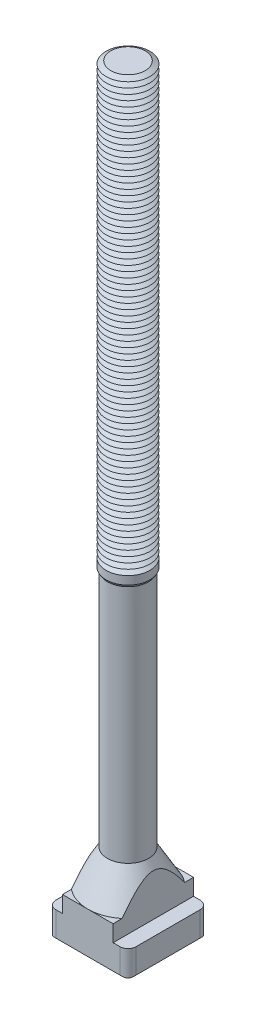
ISO-10303-21;
HEADER;
FILE_DESCRIPTION(('STEP AP214'),'2;1');
FILE_NAME('part.step','',(''),(''),'','','');
FILE_SCHEMA(('AUTOMOTIVE_DESIGN { 1 0 10303 214 1 1 1 1 }'));
ENDSEC;
DATA;
#1=APPLICATION_CONTEXT('core data for automotive mechanical design processes');
#2=APPLICATION_PROTOCOL_DEFINITION('international standard','automotive_design',2000,#1);
#3=PRODUCT_CONTEXT('',#1,'mechanical');
#4=PRODUCT('Part','Part','',(#3));
#5=PRODUCT_RELATED_PRODUCT_CATEGORY('part','',(#4));
#6=PRODUCT_DEFINITION_FORMATION('','',#4);
#7=PRODUCT_DEFINITION_CONTEXT('part definition',#1,'design');
#8=PRODUCT_DEFINITION('design','',#6,#7);
#9=PRODUCT_DEFINITION_SHAPE('','',#8);
#10=(LENGTH_UNIT() NAMED_UNIT(*) SI_UNIT(.MILLI.,.METRE.));
#11=(NAMED_UNIT(*) PLANE_ANGLE_UNIT() SI_UNIT($,.RADIAN.));
#12=(NAMED_UNIT(*) SI_UNIT($,.STERADIAN.) SOLID_ANGLE_UNIT());
#13=UNCERTAINTY_MEASURE_WITH_UNIT(LENGTH_MEASURE(1.E-05),#10,'distance_accuracy_value','');
#14=(GEOMETRIC_REPRESENTATION_CONTEXT(3) GLOBAL_UNCERTAINTY_ASSIGNED_CONTEXT((#13)) GLOBAL_UNIT_ASSIGNED_CONTEXT((#10,
#11,#12)) REPRESENTATION_CONTEXT('',''));
#15=CARTESIAN_POINT('',(0.,0.,0.));
#16=DIRECTION('',(0.,0.,1.));
#17=DIRECTION('',(1.,0.,0.));
#18=AXIS2_PLACEMENT_3D('',#15,#16,#17);
#19=CARTESIAN_POINT('',(0.,406.,0.));
#20=DIRECTION('',(0.,-1.,0.));
#21=DIRECTION('',(0.,0.,-1.));
#22=AXIS2_PLACEMENT_3D('',#19,#20,#21);
#23=CONICAL_SURFACE('',#22,9.40192378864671,1.0471975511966);
#24=CARTESIAN_POINT('',(0.,404.5,0.));
#25=DIRECTION('',(0.,-1.,0.));
#26=DIRECTION('',(0.,0.,-1.));
#27=AXIS2_PLACEMENT_3D('',#24,#25,#26);
#28=CIRCLE('',#27,12.);
#29=CARTESIAN_POINT('',(0.,404.5,-12.));
#30=VERTEX_POINT('',#29);
#31=EDGE_CURVE('E693',#30,#30,#28,.T.);
#32=ORIENTED_EDGE('',*,*,#31,.F.);
#33=EDGE_LOOP('',(#32));
#34=FACE_BOUND('',#33,.T.);
#35=CARTESIAN_POINT('',(0.,406.,0.));
#36=DIRECTION('',(0.,-1.,0.));
#37=DIRECTION('',(0.,0.,-1.));
#38=AXIS2_PLACEMENT_3D('',#35,#36,#37);
#39=CIRCLE('',#38,9.40192378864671);
#40=CARTESIAN_POINT('',(0.,406.,-9.40192378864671));
#41=VERTEX_POINT('',#40);
#42=EDGE_CURVE('E697',#41,#41,#39,.T.);
#43=ORIENTED_EDGE('',*,*,#42,.T.);
#44=EDGE_LOOP('',(#43));
#45=FACE_BOUND('',#44,.T.);
#46=ADVANCED_FACE('F39',(#34,#45),#23,.T.);
#47=CARTESIAN_POINT('',(0.,407.5,0.));
#48=DIRECTION('',(0.,1.,0.));
#49=DIRECTION('',(0.,0.,1.));
#50=AXIS2_PLACEMENT_3D('',#47,#48,#49);
#51=CONICAL_SURFACE('',#50,12.,1.0471975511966);
#52=ORIENTED_EDGE('',*,*,#42,.F.);
#53=EDGE_LOOP('',(#52));
#54=FACE_BOUND('',#53,.T.);
#55=CARTESIAN_POINT('',(0.,407.5,0.));
#56=DIRECTION('',(0.,-1.,0.));
#57=DIRECTION('',(0.,0.,-1.));
#58=AXIS2_PLACEMENT_3D('',#55,#56,#57);
#59=CIRCLE('',#58,12.);
#60=CARTESIAN_POINT('',(0.,407.5,-12.));
#61=VERTEX_POINT('',#60);
#62=EDGE_CURVE('E701',#61,#61,#59,.T.);
#63=ORIENTED_EDGE('',*,*,#62,.T.);
#64=EDGE_LOOP('',(#63));
#65=FACE_BOUND('',#64,.T.);
#66=ADVANCED_FACE('F449',(#54,#65),#51,.T.);
#67=CARTESIAN_POINT('',(5.63325136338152,418.,0.));
#68=DIRECTION('',(0.,-1.,0.));
#69=DIRECTION('',(1.,0.,0.));
#70=AXIS2_PLACEMENT_3D('',#67,#68,#69);
#71=PLANE('',#70);
#72=CARTESIAN_POINT('',(0.,418.,0.));
#73=DIRECTION('',(0.,-1.,0.));
#74=DIRECTION('',(0.,0.,-1.));
#75=AXIS2_PLACEMENT_3D('',#72,#73,#74);
#76=CIRCLE('',#75,9.40192378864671);
#77=CARTESIAN_POINT('',(0.,418.,-9.40192378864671));
#78=VERTEX_POINT('',#77);
#79=EDGE_CURVE('E729',#78,#78,#76,.T.);
#80=ORIENTED_EDGE('',*,*,#79,.F.);
#81=EDGE_LOOP('',(#80));
#82=FACE_BOUND('',#81,.T.);
#83=ADVANCED_FACE('F455',(#82),#71,.F.);
#84=CARTESIAN_POINT('',(0.,418.,0.));
#85=DIRECTION('',(0.,-1.,0.));
#86=DIRECTION('',(0.,0.,-1.));
#87=AXIS2_PLACEMENT_3D('',#84,#85,#86);
#88=CONICAL_SURFACE('',#87,9.40192378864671,1.0471975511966);
#89=CARTESIAN_POINT('',(0.,416.5,0.));
#90=DIRECTION('',(0.,-1.,0.));
#91=DIRECTION('',(0.,0.,-1.));
#92=AXIS2_PLACEMENT_3D('',#89,#90,#91);
#93=CIRCLE('',#92,12.);
#94=CARTESIAN_POINT('',(0.,416.5,-12.));
#95=VERTEX_POINT('',#94);
#96=EDGE_CURVE('E725',#95,#95,#93,.T.);
#97=ORIENTED_EDGE('',*,*,#96,.F.);
#98=EDGE_LOOP('',(#97));
#99=FACE_BOUND('',#98,.T.);
#100=ORIENTED_EDGE('',*,*,#79,.T.);
#101=EDGE_LOOP('',(#100));
#102=FACE_BOUND('',#101,.T.);
#103=ADVANCED_FACE('F483',(#99,#102),#88,.T.);
#104=CARTESIAN_POINT('',(0.,416.5,0.));
#105=DIRECTION('',(0.,1.,0.));
#106=DIRECTION('',(0.,0.,1.));
#107=AXIS2_PLACEMENT_3D('',#104,#105,#106);
#108=CONICAL_SURFACE('',#107,12.,1.0471975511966);
#109=CARTESIAN_POINT('',(0.,415.,0.));
#110=DIRECTION('',(0.,-1.,0.));
#111=DIRECTION('',(0.,0.,-1.));
#112=AXIS2_PLACEMENT_3D('',#109,#110,#111);
#113=CIRCLE('',#112,9.40192378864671);
#114=CARTESIAN_POINT('',(0.,415.,-9.40192378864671));
#115=VERTEX_POINT('',#114);
#116=EDGE_CURVE('E721',#115,#115,#113,.T.);
#117=ORIENTED_EDGE('',*,*,#116,.F.);
#118=EDGE_LOOP('',(#117));
#119=FACE_BOUND('',#118,.T.);
#120=ORIENTED_EDGE('',*,*,#96,.T.);
#121=EDGE_LOOP('',(#120));
#122=FACE_BOUND('',#121,.T.);
#123=ADVANCED_FACE('F480',(#119,#122),#108,.T.);
#124=CARTESIAN_POINT('',(0.,415.,0.));
#125=DIRECTION('',(0.,-1.,0.));
#126=DIRECTION('',(0.,0.,-1.));
#127=AXIS2_PLACEMENT_3D('',#124,#125,#126);
#128=CONICAL_SURFACE('',#127,9.40192378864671,1.0471975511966);
#129=CARTESIAN_POINT('',(0.,413.5,0.));
#130=DIRECTION('',(0.,-1.,0.));
#131=DIRECTION('',(0.,0.,-1.));
#132=AXIS2_PLACEMENT_3D('',#129,#130,#131);
#133=CIRCLE('',#132,12.);
#134=CARTESIAN_POINT('',(0.,413.5,-12.));
#135=VERTEX_POINT('',#134);
#136=EDGE_CURVE('E717',#135,#135,#133,.T.);
#137=ORIENTED_EDGE('',*,*,#136,.F.);
#138=EDGE_LOOP('',(#137));
#139=FACE_BOUND('',#138,.T.);
#140=ORIENTED_EDGE('',*,*,#116,.T.);
#141=EDGE_LOOP('',(#140));
#142=FACE_BOUND('',#141,.T.);
#143=ADVANCED_FACE('F475',(#139,#142),#128,.T.);
#144=CARTESIAN_POINT('',(0.,413.5,0.));
#145=DIRECTION('',(0.,1.,0.));
#146=DIRECTION('',(0.,0.,1.));
#147=AXIS2_PLACEMENT_3D('',#144,#145,#146);
#148=CONICAL_SURFACE('',#147,12.,1.0471975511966);
#149=CARTESIAN_POINT('',(0.,412.,0.));
#150=DIRECTION('',(0.,-1.,0.));
#151=DIRECTION('',(0.,0.,-1.));
#152=AXIS2_PLACEMENT_3D('',#149,#150,#151);
#153=CIRCLE('',#152,9.40192378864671);
#154=CARTESIAN_POINT('',(0.,412.,-9.40192378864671));
#155=VERTEX_POINT('',#154);
#156=EDGE_CURVE('E713',#155,#155,#153,.T.);
#157=ORIENTED_EDGE('',*,*,#156,.F.);
#158=EDGE_LOOP('',(#157));
#159=FACE_BOUND('',#158,.T.);
#160=ORIENTED_EDGE('',*,*,#136,.T.);
#161=EDGE_LOOP('',(#160));
#162=FACE_BOUND('',#161,.T.);
#163=ADVANCED_FACE('F472',(#159,#162),#148,.T.);
#164=CARTESIAN_POINT('',(0.,412.,0.));
#165=DIRECTION('',(0.,-1.,0.));
#166=DIRECTION('',(0.,0.,-1.));
#167=AXIS2_PLACEMENT_3D('',#164,#165,#166);
#168=CONICAL_SURFACE('',#167,9.40192378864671,1.0471975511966);
#169=CARTESIAN_POINT('',(0.,410.5,0.));
#170=DIRECTION('',(0.,-1.,0.));
#171=DIRECTION('',(0.,0.,-1.));
#172=AXIS2_PLACEMENT_3D('',#169,#170,#171);
#173=CIRCLE('',#172,12.);
#174=CARTESIAN_POINT('',(0.,410.5,-12.));
#175=VERTEX_POINT('',#174);
#176=EDGE_CURVE('E709',#175,#175,#173,.T.);
#177=ORIENTED_EDGE('',*,*,#176,.F.);
#178=EDGE_LOOP('',(#177));
#179=FACE_BOUND('',#178,.T.);
#180=ORIENTED_EDGE('',*,*,#156,.T.);
#181=EDGE_LOOP('',(#180));
#182=FACE_BOUND('',#181,.T.);
#183=ADVANCED_FACE('F466',(#179,#182),#168,.T.);
#184=CARTESIAN_POINT('',(0.,410.5,0.));
#185=DIRECTION('',(0.,1.,0.));
#186=DIRECTION('',(0.,0.,1.));
#187=AXIS2_PLACEMENT_3D('',#184,#185,#186);
#188=CONICAL_SURFACE('',#187,12.,1.0471975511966);
#189=CARTESIAN_POINT('',(0.,409.,0.));
#190=DIRECTION('',(0.,-1.,0.));
#191=DIRECTION('',(0.,0.,-1.));
#192=AXIS2_PLACEMENT_3D('',#189,#190,#191);
#193=CIRCLE('',#192,9.40192378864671);
#194=CARTESIAN_POINT('',(0.,409.,-9.40192378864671));
#195=VERTEX_POINT('',#194);
#196=EDGE_CURVE('E705',#195,#195,#193,.T.);
#197=ORIENTED_EDGE('',*,*,#196,.F.);
#198=EDGE_LOOP('',(#197));
#199=FACE_BOUND('',#198,.T.);
#200=ORIENTED_EDGE('',*,*,#176,.T.);
#201=EDGE_LOOP('',(#200));
#202=FACE_BOUND('',#201,.T.);
#203=ADVANCED_FACE('F462',(#199,#202),#188,.T.);
#204=CARTESIAN_POINT('',(0.,409.,0.));
#205=DIRECTION('',(0.,-1.,0.));
#206=DIRECTION('',(0.,0.,-1.));
#207=AXIS2_PLACEMENT_3D('',#204,#205,#206);
#208=CONICAL_SURFACE('',#207,9.40192378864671,1.0471975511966);
#209=ORIENTED_EDGE('',*,*,#62,.F.);
#210=EDGE_LOOP('',(#209));
#211=FACE_BOUND('',#210,.T.);
#212=ORIENTED_EDGE('',*,*,#196,.T.);
#213=EDGE_LOOP('',(#212));
#214=FACE_BOUND('',#213,.T.);
#215=ADVANCED_FACE('F465',(#211,#214),#208,.T.);
#216=CARTESIAN_POINT('',(0.,403.,0.));
#217=DIRECTION('',(0.,-1.,0.));
#218=DIRECTION('',(0.,0.,-1.));
#219=AXIS2_PLACEMENT_3D('',#216,#217,#218);
#220=CONICAL_SURFACE('',#219,9.40192378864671,1.0471975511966);
#221=CARTESIAN_POINT('',(0.,401.5,0.));
#222=DIRECTION('',(0.,-1.,0.));
#223=DIRECTION('',(0.,0.,-1.));
#224=AXIS2_PLACEMENT_3D('',#221,#222,#223);
#225=CIRCLE('',#224,12.);
#226=CARTESIAN_POINT('',(0.,401.5,-12.));
#227=VERTEX_POINT('',#226);
#228=EDGE_CURVE('E678',#227,#227,#225,.T.);
#229=ORIENTED_EDGE('',*,*,#228,.F.);
#230=EDGE_LOOP('',(#229));
#231=FACE_BOUND('',#230,.T.);
#232=CARTESIAN_POINT('',(0.,403.,0.));
#233=DIRECTION('',(0.,-1.,0.));
#234=DIRECTION('',(0.,0.,-1.));
#235=AXIS2_PLACEMENT_3D('',#232,#233,#234);
#236=CIRCLE('',#235,9.40192378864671);
#237=CARTESIAN_POINT('',(0.,403.,-9.40192378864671));
#238=VERTEX_POINT('',#237);
#239=EDGE_CURVE('E684',#238,#238,#236,.T.);
#240=ORIENTED_EDGE('',*,*,#239,.T.);
#241=EDGE_LOOP('',(#240));
#242=FACE_BOUND('',#241,.T.);
#243=ADVANCED_FACE('F470',(#231,#242),#220,.T.);
#244=CARTESIAN_POINT('',(0.,404.5,0.));
#245=DIRECTION('',(0.,1.,0.));
#246=DIRECTION('',(0.,0.,1.));
#247=AXIS2_PLACEMENT_3D('',#244,#245,#246);
#248=CONICAL_SURFACE('',#247,12.,1.0471975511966);
#249=ORIENTED_EDGE('',*,*,#239,.F.);
#250=EDGE_LOOP('',(#249));
#251=FACE_BOUND('',#250,.T.);
#252=ORIENTED_EDGE('',*,*,#31,.T.);
#253=EDGE_LOOP('',(#252));
#254=FACE_BOUND('',#253,.T.);
#255=ADVANCED_FACE('F939',(#251,#254),#248,.T.);
#256=CARTESIAN_POINT('',(0.,400.,0.));
#257=DIRECTION('',(0.,-1.,0.));
#258=DIRECTION('',(0.,0.,-1.));
#259=AXIS2_PLACEMENT_3D('',#256,#257,#258);
#260=CONICAL_SURFACE('',#259,9.40192378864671,1.0471975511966);
#261=CARTESIAN_POINT('',(0.,398.5,0.));
#262=DIRECTION('',(0.,-1.,0.));
#263=DIRECTION('',(0.,0.,-1.));
#264=AXIS2_PLACEMENT_3D('',#261,#262,#263);
#265=CIRCLE('',#264,12.);
#266=CARTESIAN_POINT('',(0.,398.5,-12.));
#267=VERTEX_POINT('',#266);
#268=EDGE_CURVE('E679',#267,#267,#265,.T.);
#269=ORIENTED_EDGE('',*,*,#268,.F.);
#270=EDGE_LOOP('',(#269));
#271=FACE_BOUND('',#270,.T.);
#272=CARTESIAN_POINT('',(0.,400.,0.));
#273=DIRECTION('',(0.,-1.,0.));
#274=DIRECTION('',(0.,0.,-1.));
#275=AXIS2_PLACEMENT_3D('',#272,#273,#274);
#276=CIRCLE('',#275,9.40192378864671);
#277=CARTESIAN_POINT('',(0.,400.,-9.40192378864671));
#278=VERTEX_POINT('',#277);
#279=EDGE_CURVE('E676',#278,#278,#276,.T.);
#280=ORIENTED_EDGE('',*,*,#279,.T.);
#281=EDGE_LOOP('',(#280));
#282=FACE_BOUND('',#281,.T.);
#283=ADVANCED_FACE('F936',(#271,#282),#260,.T.);
#284=CARTESIAN_POINT('',(0.,401.5,0.));
#285=DIRECTION('',(0.,1.,0.));
#286=DIRECTION('',(0.,0.,1.));
#287=AXIS2_PLACEMENT_3D('',#284,#285,#286);
#288=CONICAL_SURFACE('',#287,12.,1.0471975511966);
#289=ORIENTED_EDGE('',*,*,#279,.F.);
#290=EDGE_LOOP('',(#289));
#291=FACE_BOUND('',#290,.T.);
#292=ORIENTED_EDGE('',*,*,#228,.T.);
#293=EDGE_LOOP('',(#292));
#294=FACE_BOUND('',#293,.T.);
#295=ADVANCED_FACE('F938',(#291,#294),#288,.T.);
#296=CARTESIAN_POINT('',(0.,397.,0.));
#297=DIRECTION('',(0.,-1.,0.));
#298=DIRECTION('',(0.,0.,-1.));
#299=AXIS2_PLACEMENT_3D('',#296,#297,#298);
#300=CONICAL_SURFACE('',#299,9.40192378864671,1.0471975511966);
#301=CARTESIAN_POINT('',(0.,395.5,0.));
#302=DIRECTION('',(0.,-1.,0.));
#303=DIRECTION('',(0.,0.,-1.));
#304=AXIS2_PLACEMENT_3D('',#301,#302,#303);
#305=CIRCLE('',#304,12.);
#306=CARTESIAN_POINT('',(0.,395.5,-12.));
#307=VERTEX_POINT('',#306);
#308=EDGE_CURVE('E671',#307,#307,#305,.T.);
#309=ORIENTED_EDGE('',*,*,#308,.F.);
#310=EDGE_LOOP('',(#309));
#311=FACE_BOUND('',#310,.T.);
#312=CARTESIAN_POINT('',(0.,397.,0.));
#313=DIRECTION('',(0.,-1.,0.));
#314=DIRECTION('',(0.,0.,-1.));
#315=AXIS2_PLACEMENT_3D('',#312,#313,#314);
#316=CIRCLE('',#315,9.40192378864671);
#317=CARTESIAN_POINT('',(0.,397.,-9.40192378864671));
#318=VERTEX_POINT('',#317);
#319=EDGE_CURVE('E673',#318,#318,#316,.T.);
#320=ORIENTED_EDGE('',*,*,#319,.T.);
#321=EDGE_LOOP('',(#320));
#322=FACE_BOUND('',#321,.T.);
#323=ADVANCED_FACE('F927',(#311,#322),#300,.T.);
#324=CARTESIAN_POINT('',(0.,398.5,0.));
#325=DIRECTION('',(0.,1.,0.));
#326=DIRECTION('',(0.,0.,1.));
#327=AXIS2_PLACEMENT_3D('',#324,#325,#326);
#328=CONICAL_SURFACE('',#327,12.,1.0471975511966);
#329=ORIENTED_EDGE('',*,*,#319,.F.);
#330=EDGE_LOOP('',(#329));
#331=FACE_BOUND('',#330,.T.);
#332=ORIENTED_EDGE('',*,*,#268,.T.);
#333=EDGE_LOOP('',(#332));
#334=FACE_BOUND('',#333,.T.);
#335=ADVANCED_FACE('F929',(#331,#334),#328,.T.);
#336=CARTESIAN_POINT('',(0.,394.,0.));
#337=DIRECTION('',(0.,-1.,0.));
#338=DIRECTION('',(0.,0.,-1.));
#339=AXIS2_PLACEMENT_3D('',#336,#337,#338);
#340=CONICAL_SURFACE('',#339,9.40192378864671,1.0471975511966);
#341=CARTESIAN_POINT('',(0.,392.5,0.));
#342=DIRECTION('',(0.,-1.,0.));
#343=DIRECTION('',(0.,0.,-1.));
#344=AXIS2_PLACEMENT_3D('',#341,#342,#343);
#345=CIRCLE('',#344,12.);
#346=CARTESIAN_POINT('',(0.,392.5,-12.));
#347=VERTEX_POINT('',#346);
#348=EDGE_CURVE('E796',#347,#347,#345,.T.);
#349=ORIENTED_EDGE('',*,*,#348,.F.);
#350=EDGE_LOOP('',(#349));
#351=FACE_BOUND('',#350,.T.);
#352=CARTESIAN_POINT('',(0.,394.,0.));
#353=DIRECTION('',(0.,-1.,0.));
#354=DIRECTION('',(0.,0.,-1.));
#355=AXIS2_PLACEMENT_3D('',#352,#353,#354);
#356=CIRCLE('',#355,9.40192378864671);
#357=CARTESIAN_POINT('',(0.,394.,-9.40192378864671));
#358=VERTEX_POINT('',#357);
#359=EDGE_CURVE('E674',#358,#358,#356,.T.);
#360=ORIENTED_EDGE('',*,*,#359,.T.);
#361=EDGE_LOOP('',(#360));
#362=FACE_BOUND('',#361,.T.);
#363=ADVANCED_FACE('F932',(#351,#362),#340,.T.);
#364=CARTESIAN_POINT('',(0.,395.5,0.));
#365=DIRECTION('',(0.,1.,0.));
#366=DIRECTION('',(0.,0.,1.));
#367=AXIS2_PLACEMENT_3D('',#364,#365,#366);
#368=CONICAL_SURFACE('',#367,12.,1.0471975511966);
#369=ORIENTED_EDGE('',*,*,#359,.F.);
#370=EDGE_LOOP('',(#369));
#371=FACE_BOUND('',#370,.T.);
#372=ORIENTED_EDGE('',*,*,#308,.T.);
#373=EDGE_LOOP('',(#372));
#374=FACE_BOUND('',#373,.T.);
#375=ADVANCED_FACE('F991',(#371,#374),#368,.T.);
#376=CARTESIAN_POINT('',(0.,391.,0.));
#377=DIRECTION('',(0.,-1.,0.));
#378=DIRECTION('',(0.,0.,-1.));
#379=AXIS2_PLACEMENT_3D('',#376,#377,#378);
#380=CONICAL_SURFACE('',#379,9.40192378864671,1.0471975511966);
#381=CARTESIAN_POINT('',(0.,389.5,0.));
#382=DIRECTION('',(0.,-1.,0.));
#383=DIRECTION('',(0.,0.,-1.));
#384=AXIS2_PLACEMENT_3D('',#381,#382,#383);
#385=CIRCLE('',#384,12.);
#386=CARTESIAN_POINT('',(0.,389.5,-12.));
#387=VERTEX_POINT('',#386);
#388=EDGE_CURVE('E850',#387,#387,#385,.T.);
#389=ORIENTED_EDGE('',*,*,#388,.F.);
#390=EDGE_LOOP('',(#389));
#391=FACE_BOUND('',#390,.T.);
#392=CARTESIAN_POINT('',(0.,391.,0.));
#393=DIRECTION('',(0.,-1.,0.));
#394=DIRECTION('',(0.,0.,-1.));
#395=AXIS2_PLACEMENT_3D('',#392,#393,#394);
#396=CIRCLE('',#395,9.40192378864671);
#397=CARTESIAN_POINT('',(0.,391.,-9.40192378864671));
#398=VERTEX_POINT('',#397);
#399=EDGE_CURVE('E798',#398,#398,#396,.T.);
#400=ORIENTED_EDGE('',*,*,#399,.T.);
#401=EDGE_LOOP('',(#400));
#402=FACE_BOUND('',#401,.T.);
#403=ADVANCED_FACE('F1000',(#391,#402),#380,.T.);
#404=CARTESIAN_POINT('',(0.,392.5,0.));
#405=DIRECTION('',(0.,1.,0.));
#406=DIRECTION('',(0.,0.,1.));
#407=AXIS2_PLACEMENT_3D('',#404,#405,#406);
#408=CONICAL_SURFACE('',#407,12.,1.0471975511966);
#409=ORIENTED_EDGE('',*,*,#399,.F.);
#410=EDGE_LOOP('',(#409));
#411=FACE_BOUND('',#410,.T.);
#412=ORIENTED_EDGE('',*,*,#348,.T.);
#413=EDGE_LOOP('',(#412));
#414=FACE_BOUND('',#413,.T.);
#415=ADVANCED_FACE('F1009',(#411,#414),#408,.T.);
#416=CARTESIAN_POINT('',(0.,388.,0.));
#417=DIRECTION('',(0.,-1.,0.));
#418=DIRECTION('',(0.,0.,-1.));
#419=AXIS2_PLACEMENT_3D('',#416,#417,#418);
#420=CONICAL_SURFACE('',#419,9.40192378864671,1.0471975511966);
#421=CARTESIAN_POINT('',(0.,386.5,0.));
#422=DIRECTION('',(0.,-1.,0.));
#423=DIRECTION('',(0.,0.,-1.));
#424=AXIS2_PLACEMENT_3D('',#421,#422,#423);
#425=CIRCLE('',#424,12.);
#426=CARTESIAN_POINT('',(0.,386.5,-12.));
#427=VERTEX_POINT('',#426);
#428=EDGE_CURVE('E790',#427,#427,#425,.T.);
#429=ORIENTED_EDGE('',*,*,#428,.F.);
#430=EDGE_LOOP('',(#429));
#431=FACE_BOUND('',#430,.T.);
#432=CARTESIAN_POINT('',(0.,388.,0.));
#433=DIRECTION('',(0.,-1.,0.));
#434=DIRECTION('',(0.,0.,-1.));
#435=AXIS2_PLACEMENT_3D('',#432,#433,#434);
#436=CIRCLE('',#435,9.40192378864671);
#437=CARTESIAN_POINT('',(0.,388.,-9.40192378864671));
#438=VERTEX_POINT('',#437);
#439=EDGE_CURVE('E793',#438,#438,#436,.T.);
#440=ORIENTED_EDGE('',*,*,#439,.T.);
#441=EDGE_LOOP('',(#440));
#442=FACE_BOUND('',#441,.T.);
#443=ADVANCED_FACE('F1018',(#431,#442),#420,.T.);
#444=CARTESIAN_POINT('',(0.,389.5,0.));
#445=DIRECTION('',(0.,1.,0.));
#446=DIRECTION('',(0.,0.,1.));
#447=AXIS2_PLACEMENT_3D('',#444,#445,#446);
#448=CONICAL_SURFACE('',#447,12.,1.0471975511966);
#449=ORIENTED_EDGE('',*,*,#439,.F.);
#450=EDGE_LOOP('',(#449));
#451=FACE_BOUND('',#450,.T.);
#452=ORIENTED_EDGE('',*,*,#388,.T.);
#453=EDGE_LOOP('',(#452));
#454=FACE_BOUND('',#453,.T.);
#455=ADVANCED_FACE('F1027',(#451,#454),#448,.T.);
#456=CARTESIAN_POINT('',(0.,385.,0.));
#457=DIRECTION('',(0.,-1.,0.));
#458=DIRECTION('',(0.,0.,-1.));
#459=AXIS2_PLACEMENT_3D('',#456,#457,#458);
#460=CONICAL_SURFACE('',#459,9.40192378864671,1.0471975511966);
#461=CARTESIAN_POINT('',(0.,383.5,0.));
#462=DIRECTION('',(0.,-1.,0.));
#463=DIRECTION('',(0.,0.,-1.));
#464=AXIS2_PLACEMENT_3D('',#461,#462,#463);
#465=CIRCLE('',#464,12.);
#466=CARTESIAN_POINT('',(0.,383.5,-12.));
#467=VERTEX_POINT('',#466);
#468=EDGE_CURVE('E908',#467,#467,#465,.T.);
#469=ORIENTED_EDGE('',*,*,#468,.F.);
#470=EDGE_LOOP('',(#469));
#471=FACE_BOUND('',#470,.T.);
#472=CARTESIAN_POINT('',(0.,385.,0.));
#473=DIRECTION('',(0.,-1.,0.));
#474=DIRECTION('',(0.,0.,-1.));
#475=AXIS2_PLACEMENT_3D('',#472,#473,#474);
#476=CIRCLE('',#475,9.40192378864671);
#477=CARTESIAN_POINT('',(0.,385.,-9.40192378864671));
#478=VERTEX_POINT('',#477);
#479=EDGE_CURVE('E794',#478,#478,#476,.T.);
#480=ORIENTED_EDGE('',*,*,#479,.T.);
#481=EDGE_LOOP('',(#480));
#482=FACE_BOUND('',#481,.T.);
#483=ADVANCED_FACE('F1036',(#471,#482),#460,.T.);
#484=CARTESIAN_POINT('',(0.,386.5,0.));
#485=DIRECTION('',(0.,1.,0.));
#486=DIRECTION('',(0.,0.,1.));
#487=AXIS2_PLACEMENT_3D('',#484,#485,#486);
#488=CONICAL_SURFACE('',#487,12.,1.0471975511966);
#489=ORIENTED_EDGE('',*,*,#479,.F.);
#490=EDGE_LOOP('',(#489));
#491=FACE_BOUND('',#490,.T.);
#492=ORIENTED_EDGE('',*,*,#428,.T.);
#493=EDGE_LOOP('',(#492));
#494=FACE_BOUND('',#493,.T.);
#495=ADVANCED_FACE('F1045',(#491,#494),#488,.T.);
#496=CARTESIAN_POINT('',(0.,382.,0.));
#497=DIRECTION('',(0.,-1.,0.));
#498=DIRECTION('',(0.,0.,-1.));
#499=AXIS2_PLACEMENT_3D('',#496,#497,#498);
#500=CONICAL_SURFACE('',#499,9.40192378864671,1.0471975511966);
#501=CARTESIAN_POINT('',(0.,380.5,0.));
#502=DIRECTION('',(0.,-1.,0.));
#503=DIRECTION('',(0.,0.,-1.));
#504=AXIS2_PLACEMENT_3D('',#501,#502,#503);
#505=CIRCLE('',#504,12.);
#506=CARTESIAN_POINT('',(0.,380.5,-12.));
#507=VERTEX_POINT('',#506);
#508=EDGE_CURVE('E900',#507,#507,#505,.T.);
#509=ORIENTED_EDGE('',*,*,#508,.F.);
#510=EDGE_LOOP('',(#509));
#511=FACE_BOUND('',#510,.T.);
#512=CARTESIAN_POINT('',(0.,382.,0.));
#513=DIRECTION('',(0.,-1.,0.));
#514=DIRECTION('',(0.,0.,-1.));
#515=AXIS2_PLACEMENT_3D('',#512,#513,#514);
#516=CIRCLE('',#515,9.40192378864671);
#517=CARTESIAN_POINT('',(0.,382.,-9.40192378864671));
#518=VERTEX_POINT('',#517);
#519=EDGE_CURVE('E904',#518,#518,#516,.T.);
#520=ORIENTED_EDGE('',*,*,#519,.T.);
#521=EDGE_LOOP('',(#520));
#522=FACE_BOUND('',#521,.T.);
#523=ADVANCED_FACE('F1054',(#511,#522),#500,.T.);
#524=CARTESIAN_POINT('',(0.,383.5,0.));
#525=DIRECTION('',(0.,1.,0.));
#526=DIRECTION('',(0.,0.,1.));
#527=AXIS2_PLACEMENT_3D('',#524,#525,#526);
#528=CONICAL_SURFACE('',#527,12.,1.0471975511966);
#529=ORIENTED_EDGE('',*,*,#519,.F.);
#530=EDGE_LOOP('',(#529));
#531=FACE_BOUND('',#530,.T.);
#532=ORIENTED_EDGE('',*,*,#468,.T.);
#533=EDGE_LOOP('',(#532));
#534=FACE_BOUND('',#533,.T.);
#535=ADVANCED_FACE('F1063',(#531,#534),#528,.T.);
#536=CARTESIAN_POINT('',(0.,379.,0.));
#537=DIRECTION('',(0.,-1.,0.));
#538=DIRECTION('',(0.,0.,-1.));
#539=AXIS2_PLACEMENT_3D('',#536,#537,#538);
#540=CONICAL_SURFACE('',#539,9.40192378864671,1.0471975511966);
#541=CARTESIAN_POINT('',(0.,377.5,0.));
#542=DIRECTION('',(0.,-1.,0.));
#543=DIRECTION('',(0.,0.,-1.));
#544=AXIS2_PLACEMENT_3D('',#541,#542,#543);
#545=CIRCLE('',#544,12.);
#546=CARTESIAN_POINT('',(0.,377.5,-12.));
#547=VERTEX_POINT('',#546);
#548=EDGE_CURVE('E883',#547,#547,#545,.T.);
#549=ORIENTED_EDGE('',*,*,#548,.F.);
#550=EDGE_LOOP('',(#549));
#551=FACE_BOUND('',#550,.T.);
#552=CARTESIAN_POINT('',(0.,379.,0.));
#553=DIRECTION('',(0.,-1.,0.));
#554=DIRECTION('',(0.,0.,-1.));
#555=AXIS2_PLACEMENT_3D('',#552,#553,#554);
#556=CIRCLE('',#555,9.40192378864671);
#557=CARTESIAN_POINT('',(0.,379.,-9.40192378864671));
#558=VERTEX_POINT('',#557);
#559=EDGE_CURVE('E890',#558,#558,#556,.T.);
#560=ORIENTED_EDGE('',*,*,#559,.T.);
#561=EDGE_LOOP('',(#560));
#562=FACE_BOUND('',#561,.T.);
#563=ADVANCED_FACE('F1072',(#551,#562),#540,.T.);
#564=CARTESIAN_POINT('',(0.,380.5,0.));
#565=DIRECTION('',(0.,1.,0.));
#566=DIRECTION('',(0.,0.,1.));
#567=AXIS2_PLACEMENT_3D('',#564,#565,#566);
#568=CONICAL_SURFACE('',#567,12.,1.0471975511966);
#569=ORIENTED_EDGE('',*,*,#559,.F.);
#570=EDGE_LOOP('',(#569));
#571=FACE_BOUND('',#570,.T.);
#572=ORIENTED_EDGE('',*,*,#508,.T.);
#573=EDGE_LOOP('',(#572));
#574=FACE_BOUND('',#573,.T.);
#575=ADVANCED_FACE('F1081',(#571,#574),#568,.T.);
#576=CARTESIAN_POINT('',(0.,376.,0.));
#577=DIRECTION('',(0.,-1.,0.));
#578=DIRECTION('',(0.,0.,-1.));
#579=AXIS2_PLACEMENT_3D('',#576,#577,#578);
#580=CONICAL_SURFACE('',#579,9.40192378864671,1.0471975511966);
#581=CARTESIAN_POINT('',(0.,374.5,0.));
#582=DIRECTION('',(0.,-1.,0.));
#583=DIRECTION('',(0.,0.,-1.));
#584=AXIS2_PLACEMENT_3D('',#581,#582,#583);
#585=CIRCLE('',#584,12.);
#586=CARTESIAN_POINT('',(0.,374.5,-12.));
#587=VERTEX_POINT('',#586);
#588=EDGE_CURVE('E884',#587,#587,#585,.T.);
#589=ORIENTED_EDGE('',*,*,#588,.F.);
#590=EDGE_LOOP('',(#589));
#591=FACE_BOUND('',#590,.T.);
#592=CARTESIAN_POINT('',(0.,376.,0.));
#593=DIRECTION('',(0.,-1.,0.));
#594=DIRECTION('',(0.,0.,-1.));
#595=AXIS2_PLACEMENT_3D('',#592,#593,#594);
#596=CIRCLE('',#595,9.40192378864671);
#597=CARTESIAN_POINT('',(0.,376.,-9.40192378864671));
#598=VERTEX_POINT('',#597);
#599=EDGE_CURVE('E881',#598,#598,#596,.T.);
#600=ORIENTED_EDGE('',*,*,#599,.T.);
#601=EDGE_LOOP('',(#600));
#602=FACE_BOUND('',#601,.T.);
#603=ADVANCED_FACE('F1090',(#591,#602),#580,.T.);
#604=CARTESIAN_POINT('',(0.,377.5,0.));
#605=DIRECTION('',(0.,1.,0.));
#606=DIRECTION('',(0.,0.,1.));
#607=AXIS2_PLACEMENT_3D('',#604,#605,#606);
#608=CONICAL_SURFACE('',#607,12.,1.0471975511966);
#609=ORIENTED_EDGE('',*,*,#599,.F.);
#610=EDGE_LOOP('',(#609));
#611=FACE_BOUND('',#610,.T.);
#612=ORIENTED_EDGE('',*,*,#548,.T.);
#613=EDGE_LOOP('',(#612));
#614=FACE_BOUND('',#613,.T.);
#615=ADVANCED_FACE('F1099',(#611,#614),#608,.T.);
#616=CARTESIAN_POINT('',(0.,373.,0.));
#617=DIRECTION('',(0.,-1.,0.));
#618=DIRECTION('',(0.,0.,-1.));
#619=AXIS2_PLACEMENT_3D('',#616,#617,#618);
#620=CONICAL_SURFACE('',#619,9.40192378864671,1.0471975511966);
#621=CARTESIAN_POINT('',(0.,371.5,0.));
#622=DIRECTION('',(0.,-1.,0.));
#623=DIRECTION('',(0.,0.,-1.));
#624=AXIS2_PLACEMENT_3D('',#621,#622,#623);
#625=CIRCLE('',#624,12.);
#626=CARTESIAN_POINT('',(0.,371.5,-12.));
#627=VERTEX_POINT('',#626);
#628=EDGE_CURVE('E665',#627,#627,#625,.T.);
#629=ORIENTED_EDGE('',*,*,#628,.F.);
#630=EDGE_LOOP('',(#629));
#631=FACE_BOUND('',#630,.T.);
#632=CARTESIAN_POINT('',(0.,373.,0.));
#633=DIRECTION('',(0.,-1.,0.));
#634=DIRECTION('',(0.,0.,-1.));
#635=AXIS2_PLACEMENT_3D('',#632,#633,#634);
#636=CIRCLE('',#635,9.40192378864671);
#637=CARTESIAN_POINT('',(0.,373.,-9.40192378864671));
#638=VERTEX_POINT('',#637);
#639=EDGE_CURVE('E668',#638,#638,#636,.T.);
#640=ORIENTED_EDGE('',*,*,#639,.T.);
#641=EDGE_LOOP('',(#640));
#642=FACE_BOUND('',#641,.T.);
#643=ADVANCED_FACE('F1108',(#631,#642),#620,.T.);
#644=CARTESIAN_POINT('',(0.,374.5,0.));
#645=DIRECTION('',(0.,1.,0.));
#646=DIRECTION('',(0.,0.,1.));
#647=AXIS2_PLACEMENT_3D('',#644,#645,#646);
#648=CONICAL_SURFACE('',#647,12.,1.0471975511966);
#649=ORIENTED_EDGE('',*,*,#639,.F.);
#650=EDGE_LOOP('',(#649));
#651=FACE_BOUND('',#650,.T.);
#652=ORIENTED_EDGE('',*,*,#588,.T.);
#653=EDGE_LOOP('',(#652));
#654=FACE_BOUND('',#653,.T.);
#655=ADVANCED_FACE('F1117',(#651,#654),#648,.T.);
#656=CARTESIAN_POINT('',(0.,370.,0.));
#657=DIRECTION('',(0.,-1.,0.));
#658=DIRECTION('',(0.,0.,-1.));
#659=AXIS2_PLACEMENT_3D('',#656,#657,#658);
#660=CONICAL_SURFACE('',#659,9.40192378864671,1.0471975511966);
#661=CARTESIAN_POINT('',(0.,368.5,0.));
#662=DIRECTION('',(0.,-1.,0.));
#663=DIRECTION('',(0.,0.,-1.));
#664=AXIS2_PLACEMENT_3D('',#661,#662,#663);
#665=CIRCLE('',#664,12.);
#666=CARTESIAN_POINT('',(0.,368.5,-12.));
#667=VERTEX_POINT('',#666);
#668=EDGE_CURVE('E878',#667,#667,#665,.T.);
#669=ORIENTED_EDGE('',*,*,#668,.F.);
#670=EDGE_LOOP('',(#669));
#671=FACE_BOUND('',#670,.T.);
#672=CARTESIAN_POINT('',(0.,370.,0.));
#673=DIRECTION('',(0.,-1.,0.));
#674=DIRECTION('',(0.,0.,-1.));
#675=AXIS2_PLACEMENT_3D('',#672,#673,#674);
#676=CIRCLE('',#675,9.40192378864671);
#677=CARTESIAN_POINT('',(0.,370.,-9.40192378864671));
#678=VERTEX_POINT('',#677);
#679=EDGE_CURVE('E669',#678,#678,#676,.T.);
#680=ORIENTED_EDGE('',*,*,#679,.T.);
#681=EDGE_LOOP('',(#680));
#682=FACE_BOUND('',#681,.T.);
#683=ADVANCED_FACE('F1126',(#671,#682),#660,.T.);
#684=CARTESIAN_POINT('',(0.,371.5,0.));
#685=DIRECTION('',(0.,1.,0.));
#686=DIRECTION('',(0.,0.,1.));
#687=AXIS2_PLACEMENT_3D('',#684,#685,#686);
#688=CONICAL_SURFACE('',#687,12.,1.0471975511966);
#689=ORIENTED_EDGE('',*,*,#679,.F.);
#690=EDGE_LOOP('',(#689));
#691=FACE_BOUND('',#690,.T.);
#692=ORIENTED_EDGE('',*,*,#628,.T.);
#693=EDGE_LOOP('',(#692));
#694=FACE_BOUND('',#693,.T.);
#695=ADVANCED_FACE('F1135',(#691,#694),#688,.T.);
#696=CARTESIAN_POINT('',(0.,367.,0.));
#697=DIRECTION('',(0.,-1.,0.));
#698=DIRECTION('',(0.,0.,-1.));
#699=AXIS2_PLACEMENT_3D('',#696,#697,#698);
#700=CONICAL_SURFACE('',#699,9.40192378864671,1.0471975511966);
#701=CARTESIAN_POINT('',(0.,365.5,0.));
#702=DIRECTION('',(0.,-1.,0.));
#703=DIRECTION('',(0.,0.,-1.));
#704=AXIS2_PLACEMENT_3D('',#701,#702,#703);
#705=CIRCLE('',#704,12.);
#706=CARTESIAN_POINT('',(0.,365.5,-12.));
#707=VERTEX_POINT('',#706);
#708=EDGE_CURVE('E879',#707,#707,#705,.T.);
#709=ORIENTED_EDGE('',*,*,#708,.F.);
#710=EDGE_LOOP('',(#709));
#711=FACE_BOUND('',#710,.T.);
#712=CARTESIAN_POINT('',(0.,367.,0.));
#713=DIRECTION('',(0.,-1.,0.));
#714=DIRECTION('',(0.,0.,-1.));
#715=AXIS2_PLACEMENT_3D('',#712,#713,#714);
#716=CIRCLE('',#715,9.40192378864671);
#717=CARTESIAN_POINT('',(0.,367.,-9.40192378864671));
#718=VERTEX_POINT('',#717);
#719=EDGE_CURVE('E875',#718,#718,#716,.T.);
#720=ORIENTED_EDGE('',*,*,#719,.T.);
#721=EDGE_LOOP('',(#720));
#722=FACE_BOUND('',#721,.T.);
#723=ADVANCED_FACE('F1144',(#711,#722),#700,.T.);
#724=CARTESIAN_POINT('',(0.,368.5,0.));
#725=DIRECTION('',(0.,1.,0.));
#726=DIRECTION('',(0.,0.,1.));
#727=AXIS2_PLACEMENT_3D('',#724,#725,#726);
#728=CONICAL_SURFACE('',#727,12.,1.0471975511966);
#729=ORIENTED_EDGE('',*,*,#719,.F.);
#730=EDGE_LOOP('',(#729));
#731=FACE_BOUND('',#730,.T.);
#732=ORIENTED_EDGE('',*,*,#668,.T.);
#733=EDGE_LOOP('',(#732));
#734=FACE_BOUND('',#733,.T.);
#735=ADVANCED_FACE('F1153',(#731,#734),#728,.T.);
#736=CARTESIAN_POINT('',(0.,364.,0.));
#737=DIRECTION('',(0.,-1.,0.));
#738=DIRECTION('',(0.,0.,-1.));
#739=AXIS2_PLACEMENT_3D('',#736,#737,#738);
#740=CONICAL_SURFACE('',#739,9.40192378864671,1.0471975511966);
#741=CARTESIAN_POINT('',(0.,362.5,0.));
#742=DIRECTION('',(0.,-1.,0.));
#743=DIRECTION('',(0.,0.,-1.));
#744=AXIS2_PLACEMENT_3D('',#741,#742,#743);
#745=CIRCLE('',#744,12.);
#746=CARTESIAN_POINT('',(0.,362.5,-12.));
#747=VERTEX_POINT('',#746);
#748=EDGE_CURVE('E659',#747,#747,#745,.T.);
#749=ORIENTED_EDGE('',*,*,#748,.F.);
#750=EDGE_LOOP('',(#749));
#751=FACE_BOUND('',#750,.T.);
#752=CARTESIAN_POINT('',(0.,364.,0.));
#753=DIRECTION('',(0.,-1.,0.));
#754=DIRECTION('',(0.,0.,-1.));
#755=AXIS2_PLACEMENT_3D('',#752,#753,#754);
#756=CIRCLE('',#755,9.40192378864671);
#757=CARTESIAN_POINT('',(0.,364.,-9.40192378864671));
#758=VERTEX_POINT('',#757);
#759=EDGE_CURVE('E662',#758,#758,#756,.T.);
#760=ORIENTED_EDGE('',*,*,#759,.T.);
#761=EDGE_LOOP('',(#760));
#762=FACE_BOUND('',#761,.T.);
#763=ADVANCED_FACE('F1162',(#751,#762),#740,.T.);
#764=CARTESIAN_POINT('',(0.,365.5,0.));
#765=DIRECTION('',(0.,1.,0.));
#766=DIRECTION('',(0.,0.,1.));
#767=AXIS2_PLACEMENT_3D('',#764,#765,#766);
#768=CONICAL_SURFACE('',#767,12.,1.0471975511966);
#769=ORIENTED_EDGE('',*,*,#759,.F.);
#770=EDGE_LOOP('',(#769));
#771=FACE_BOUND('',#770,.T.);
#772=ORIENTED_EDGE('',*,*,#708,.T.);
#773=EDGE_LOOP('',(#772));
#774=FACE_BOUND('',#773,.T.);
#775=ADVANCED_FACE('F1171',(#771,#774),#768,.T.);
#776=CARTESIAN_POINT('',(0.,361.,0.));
#777=DIRECTION('',(0.,-1.,0.));
#778=DIRECTION('',(0.,0.,-1.));
#779=AXIS2_PLACEMENT_3D('',#776,#777,#778);
#780=CONICAL_SURFACE('',#779,9.40192378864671,1.0471975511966);
#781=CARTESIAN_POINT('',(0.,359.5,0.));
#782=DIRECTION('',(0.,-1.,0.));
#783=DIRECTION('',(0.,0.,-1.));
#784=AXIS2_PLACEMENT_3D('',#781,#782,#783);
#785=CIRCLE('',#784,12.);
#786=CARTESIAN_POINT('',(0.,359.5,-12.));
#787=VERTEX_POINT('',#786);
#788=EDGE_CURVE('E787',#787,#787,#785,.T.);
#789=ORIENTED_EDGE('',*,*,#788,.F.);
#790=EDGE_LOOP('',(#789));
#791=FACE_BOUND('',#790,.T.);
#792=CARTESIAN_POINT('',(0.,361.,0.));
#793=DIRECTION('',(0.,-1.,0.));
#794=DIRECTION('',(0.,0.,-1.));
#795=AXIS2_PLACEMENT_3D('',#792,#793,#794);
#796=CIRCLE('',#795,9.40192378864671);
#797=CARTESIAN_POINT('',(0.,361.,-9.40192378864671));
#798=VERTEX_POINT('',#797);
#799=EDGE_CURVE('E663',#798,#798,#796,.T.);
#800=ORIENTED_EDGE('',*,*,#799,.T.);
#801=EDGE_LOOP('',(#800));
#802=FACE_BOUND('',#801,.T.);
#803=ADVANCED_FACE('F1180',(#791,#802),#780,.T.);
#804=CARTESIAN_POINT('',(0.,362.5,0.));
#805=DIRECTION('',(0.,1.,0.));
#806=DIRECTION('',(0.,0.,1.));
#807=AXIS2_PLACEMENT_3D('',#804,#805,#806);
#808=CONICAL_SURFACE('',#807,12.,1.0471975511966);
#809=ORIENTED_EDGE('',*,*,#799,.F.);
#810=EDGE_LOOP('',(#809));
#811=FACE_BOUND('',#810,.T.);
#812=ORIENTED_EDGE('',*,*,#748,.T.);
#813=EDGE_LOOP('',(#812));
#814=FACE_BOUND('',#813,.T.);
#815=ADVANCED_FACE('F1189',(#811,#814),#808,.T.);
#816=CARTESIAN_POINT('',(0.,358.,0.));
#817=DIRECTION('',(0.,-1.,0.));
#818=DIRECTION('',(0.,0.,-1.));
#819=AXIS2_PLACEMENT_3D('',#816,#817,#818);
#820=CONICAL_SURFACE('',#819,9.40192378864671,1.0471975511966);
#821=CARTESIAN_POINT('',(0.,356.5,0.));
#822=DIRECTION('',(0.,-1.,0.));
#823=DIRECTION('',(0.,0.,-1.));
#824=AXIS2_PLACEMENT_3D('',#821,#822,#823);
#825=CIRCLE('',#824,12.);
#826=CARTESIAN_POINT('',(0.,356.5,-12.));
#827=VERTEX_POINT('',#826);
#828=EDGE_CURVE('E788',#827,#827,#825,.T.);
#829=ORIENTED_EDGE('',*,*,#828,.F.);
#830=EDGE_LOOP('',(#829));
#831=FACE_BOUND('',#830,.T.);
#832=CARTESIAN_POINT('',(0.,358.,0.));
#833=DIRECTION('',(0.,-1.,0.));
#834=DIRECTION('',(0.,0.,-1.));
#835=AXIS2_PLACEMENT_3D('',#832,#833,#834);
#836=CIRCLE('',#835,9.40192378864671);
#837=CARTESIAN_POINT('',(0.,358.,-9.40192378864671));
#838=VERTEX_POINT('',#837);
#839=EDGE_CURVE('E784',#838,#838,#836,.T.);
#840=ORIENTED_EDGE('',*,*,#839,.T.);
#841=EDGE_LOOP('',(#840));
#842=FACE_BOUND('',#841,.T.);
#843=ADVANCED_FACE('F1198',(#831,#842),#820,.T.);
#844=CARTESIAN_POINT('',(0.,359.5,0.));
#845=DIRECTION('',(0.,1.,0.));
#846=DIRECTION('',(0.,0.,1.));
#847=AXIS2_PLACEMENT_3D('',#844,#845,#846);
#848=CONICAL_SURFACE('',#847,12.,1.0471975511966);
#849=ORIENTED_EDGE('',*,*,#839,.F.);
#850=EDGE_LOOP('',(#849));
#851=FACE_BOUND('',#850,.T.);
#852=ORIENTED_EDGE('',*,*,#788,.T.);
#853=EDGE_LOOP('',(#852));
#854=FACE_BOUND('',#853,.T.);
#855=ADVANCED_FACE('F1207',(#851,#854),#848,.T.);
#856=CARTESIAN_POINT('',(0.,355.,0.));
#857=DIRECTION('',(0.,-1.,0.));
#858=DIRECTION('',(0.,0.,-1.));
#859=AXIS2_PLACEMENT_3D('',#856,#857,#858);
#860=CONICAL_SURFACE('',#859,9.40192378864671,1.0471975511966);
#861=CARTESIAN_POINT('',(0.,353.5,0.));
#862=DIRECTION('',(0.,-1.,0.));
#863=DIRECTION('',(0.,0.,-1.));
#864=AXIS2_PLACEMENT_3D('',#861,#862,#863);
#865=CIRCLE('',#864,12.);
#866=CARTESIAN_POINT('',(0.,353.5,-12.));
#867=VERTEX_POINT('',#866);
#868=EDGE_CURVE('E2910',#867,#867,#865,.T.);
#869=ORIENTED_EDGE('',*,*,#868,.F.);
#870=EDGE_LOOP('',(#869));
#871=FACE_BOUND('',#870,.T.);
#872=CARTESIAN_POINT('',(0.,355.,0.));
#873=DIRECTION('',(0.,-1.,0.));
#874=DIRECTION('',(0.,0.,-1.));
#875=AXIS2_PLACEMENT_3D('',#872,#873,#874);
#876=CIRCLE('',#875,9.40192378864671);
#877=CARTESIAN_POINT('',(0.,355.,-9.40192378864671));
#878=VERTEX_POINT('',#877);
#879=EDGE_CURVE('E873',#878,#878,#876,.T.);
#880=ORIENTED_EDGE('',*,*,#879,.T.);
#881=EDGE_LOOP('',(#880));
#882=FACE_BOUND('',#881,.T.);
#883=ADVANCED_FACE('F1216',(#871,#882),#860,.T.);
#884=CARTESIAN_POINT('',(0.,356.5,0.));
#885=DIRECTION('',(0.,1.,0.));
#886=DIRECTION('',(0.,0.,1.));
#887=AXIS2_PLACEMENT_3D('',#884,#885,#886);
#888=CONICAL_SURFACE('',#887,12.,1.0471975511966);
#889=ORIENTED_EDGE('',*,*,#879,.F.);
#890=EDGE_LOOP('',(#889));
#891=FACE_BOUND('',#890,.T.);
#892=ORIENTED_EDGE('',*,*,#828,.T.);
#893=EDGE_LOOP('',(#892));
#894=FACE_BOUND('',#893,.T.);
#895=ADVANCED_FACE('F1225',(#891,#894),#888,.T.);
#896=CARTESIAN_POINT('',(0.,352.,0.));
#897=DIRECTION('',(0.,-1.,0.));
#898=DIRECTION('',(0.,0.,-1.));
#899=AXIS2_PLACEMENT_3D('',#896,#897,#898);
#900=CONICAL_SURFACE('',#899,9.40192378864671,1.0471975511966);
#901=CARTESIAN_POINT('',(0.,350.5,0.));
#902=DIRECTION('',(0.,-1.,0.));
#903=DIRECTION('',(0.,0.,-1.));
#904=AXIS2_PLACEMENT_3D('',#901,#902,#903);
#905=CIRCLE('',#904,12.);
#906=CARTESIAN_POINT('',(0.,350.5,-12.));
#907=VERTEX_POINT('',#906);
#908=EDGE_CURVE('E2966',#907,#907,#905,.T.);
#909=ORIENTED_EDGE('',*,*,#908,.F.);
#910=EDGE_LOOP('',(#909));
#911=FACE_BOUND('',#910,.T.);
#912=CARTESIAN_POINT('',(0.,352.,0.));
#913=DIRECTION('',(0.,-1.,0.));
#914=DIRECTION('',(0.,0.,-1.));
#915=AXIS2_PLACEMENT_3D('',#912,#913,#914);
#916=CIRCLE('',#915,9.40192378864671);
#917=CARTESIAN_POINT('',(0.,352.,-9.40192378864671));
#918=VERTEX_POINT('',#917);
#919=EDGE_CURVE('E2912',#918,#918,#916,.T.);
#920=ORIENTED_EDGE('',*,*,#919,.T.);
#921=EDGE_LOOP('',(#920));
#922=FACE_BOUND('',#921,.T.);
#923=ADVANCED_FACE('F1234',(#911,#922),#900,.T.);
#924=CARTESIAN_POINT('',(0.,353.5,0.));
#925=DIRECTION('',(0.,1.,0.));
#926=DIRECTION('',(0.,0.,1.));
#927=AXIS2_PLACEMENT_3D('',#924,#925,#926);
#928=CONICAL_SURFACE('',#927,12.,1.0471975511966);
#929=ORIENTED_EDGE('',*,*,#919,.F.);
#930=EDGE_LOOP('',(#929));
#931=FACE_BOUND('',#930,.T.);
#932=ORIENTED_EDGE('',*,*,#868,.T.);
#933=EDGE_LOOP('',(#932));
#934=FACE_BOUND('',#933,.T.);
#935=ADVANCED_FACE('F1243',(#931,#934),#928,.T.);
#936=CARTESIAN_POINT('',(0.,349.,0.));
#937=DIRECTION('',(0.,-1.,0.));
#938=DIRECTION('',(0.,0.,-1.));
#939=AXIS2_PLACEMENT_3D('',#936,#937,#938);
#940=CONICAL_SURFACE('',#939,9.40192378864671,1.0471975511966);
#941=CARTESIAN_POINT('',(0.,347.5,0.));
#942=DIRECTION('',(0.,-1.,0.));
#943=DIRECTION('',(0.,0.,-1.));
#944=AXIS2_PLACEMENT_3D('',#941,#942,#943);
#945=CIRCLE('',#944,12.);
#946=CARTESIAN_POINT('',(0.,347.5,-12.));
#947=VERTEX_POINT('',#946);
#948=EDGE_CURVE('E847',#947,#947,#945,.T.);
#949=ORIENTED_EDGE('',*,*,#948,.F.);
#950=EDGE_LOOP('',(#949));
#951=FACE_BOUND('',#950,.T.);
#952=CARTESIAN_POINT('',(0.,349.,0.));
#953=DIRECTION('',(0.,-1.,0.));
#954=DIRECTION('',(0.,0.,-1.));
#955=AXIS2_PLACEMENT_3D('',#952,#953,#954);
#956=CIRCLE('',#955,9.40192378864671);
#957=CARTESIAN_POINT('',(0.,349.,-9.40192378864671));
#958=VERTEX_POINT('',#957);
#959=EDGE_CURVE('E2970',#958,#958,#956,.T.);
#960=ORIENTED_EDGE('',*,*,#959,.T.);
#961=EDGE_LOOP('',(#960));
#962=FACE_BOUND('',#961,.T.);
#963=ADVANCED_FACE('F1252',(#951,#962),#940,.T.);
#964=CARTESIAN_POINT('',(0.,350.5,0.));
#965=DIRECTION('',(0.,1.,0.));
#966=DIRECTION('',(0.,0.,1.));
#967=AXIS2_PLACEMENT_3D('',#964,#965,#966);
#968=CONICAL_SURFACE('',#967,12.,1.0471975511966);
#969=ORIENTED_EDGE('',*,*,#959,.F.);
#970=EDGE_LOOP('',(#969));
#971=FACE_BOUND('',#970,.T.);
#972=ORIENTED_EDGE('',*,*,#908,.T.);
#973=EDGE_LOOP('',(#972));
#974=FACE_BOUND('',#973,.T.);
#975=ADVANCED_FACE('F1261',(#971,#974),#968,.T.);
#976=CARTESIAN_POINT('',(0.,346.,0.));
#977=DIRECTION('',(0.,-1.,0.));
#978=DIRECTION('',(0.,0.,-1.));
#979=AXIS2_PLACEMENT_3D('',#976,#977,#978);
#980=CONICAL_SURFACE('',#979,9.40192378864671,1.0471975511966);
#981=CARTESIAN_POINT('',(0.,344.5,0.));
#982=DIRECTION('',(0.,-1.,0.));
#983=DIRECTION('',(0.,0.,-1.));
#984=AXIS2_PLACEMENT_3D('',#981,#982,#983);
#985=CIRCLE('',#984,12.);
#986=CARTESIAN_POINT('',(0.,344.5,-12.));
#987=VERTEX_POINT('',#986);
#988=EDGE_CURVE('E848',#987,#987,#985,.T.);
#989=ORIENTED_EDGE('',*,*,#988,.F.);
#990=EDGE_LOOP('',(#989));
#991=FACE_BOUND('',#990,.T.);
#992=CARTESIAN_POINT('',(0.,346.,0.));
#993=DIRECTION('',(0.,-1.,0.));
#994=DIRECTION('',(0.,0.,-1.));
#995=AXIS2_PLACEMENT_3D('',#992,#993,#994);
#996=CIRCLE('',#995,9.40192378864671);
#997=CARTESIAN_POINT('',(0.,346.,-9.40192378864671));
#998=VERTEX_POINT('',#997);
#999=EDGE_CURVE('E844',#998,#998,#996,.T.);
#1000=ORIENTED_EDGE('',*,*,#999,.T.);
#1001=EDGE_LOOP('',(#1000));
#1002=FACE_BOUND('',#1001,.T.);
#1003=ADVANCED_FACE('F1270',(#991,#1002),#980,.T.);
#1004=CARTESIAN_POINT('',(0.,347.5,0.));
#1005=DIRECTION('',(0.,1.,0.));
#1006=DIRECTION('',(0.,0.,1.));
#1007=AXIS2_PLACEMENT_3D('',#1004,#1005,#1006);
#1008=CONICAL_SURFACE('',#1007,12.,1.0471975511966);
#1009=ORIENTED_EDGE('',*,*,#999,.F.);
#1010=EDGE_LOOP('',(#1009));
#1011=FACE_BOUND('',#1010,.T.);
#1012=ORIENTED_EDGE('',*,*,#948,.T.);
#1013=EDGE_LOOP('',(#1012));
#1014=FACE_BOUND('',#1013,.T.);
#1015=ADVANCED_FACE('F1279',(#1011,#1014),#1008,.T.);
#1016=CARTESIAN_POINT('',(0.,343.,0.));
#1017=DIRECTION('',(0.,-1.,0.));
#1018=DIRECTION('',(0.,0.,-1.));
#1019=AXIS2_PLACEMENT_3D('',#1016,#1017,#1018);
#1020=CONICAL_SURFACE('',#1019,9.40192378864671,1.0471975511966);
#1021=CARTESIAN_POINT('',(0.,341.5,0.));
#1022=DIRECTION('',(0.,-1.,0.));
#1023=DIRECTION('',(0.,0.,-1.));
#1024=AXIS2_PLACEMENT_3D('',#1021,#1022,#1023);
#1025=CIRCLE('',#1024,12.);
#1026=CARTESIAN_POINT('',(0.,341.5,-12.));
#1027=VERTEX_POINT('',#1026);
#1028=EDGE_CURVE('E841',#1027,#1027,#1025,.T.);
#1029=ORIENTED_EDGE('',*,*,#1028,.F.);
#1030=EDGE_LOOP('',(#1029));
#1031=FACE_BOUND('',#1030,.T.);
#1032=CARTESIAN_POINT('',(0.,343.,0.));
#1033=DIRECTION('',(0.,-1.,0.));
#1034=DIRECTION('',(0.,0.,-1.));
#1035=AXIS2_PLACEMENT_3D('',#1032,#1033,#1034);
#1036=CIRCLE('',#1035,9.40192378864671);
#1037=CARTESIAN_POINT('',(0.,343.,-9.40192378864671));
#1038=VERTEX_POINT('',#1037);
#1039=EDGE_CURVE('E867',#1038,#1038,#1036,.T.);
#1040=ORIENTED_EDGE('',*,*,#1039,.T.);
#1041=EDGE_LOOP('',(#1040));
#1042=FACE_BOUND('',#1041,.T.);
#1043=ADVANCED_FACE('F1288',(#1031,#1042),#1020,.T.);
#1044=CARTESIAN_POINT('',(0.,344.5,0.));
#1045=DIRECTION('',(0.,1.,0.));
#1046=DIRECTION('',(0.,0.,1.));
#1047=AXIS2_PLACEMENT_3D('',#1044,#1045,#1046);
#1048=CONICAL_SURFACE('',#1047,12.,1.0471975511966);
#1049=ORIENTED_EDGE('',*,*,#1039,.F.);
#1050=EDGE_LOOP('',(#1049));
#1051=FACE_BOUND('',#1050,.T.);
#1052=ORIENTED_EDGE('',*,*,#988,.T.);
#1053=EDGE_LOOP('',(#1052));
#1054=FACE_BOUND('',#1053,.T.);
#1055=ADVANCED_FACE('F1297',(#1051,#1054),#1048,.T.);
#1056=CARTESIAN_POINT('',(0.,340.,0.));
#1057=DIRECTION('',(0.,-1.,0.));
#1058=DIRECTION('',(0.,0.,-1.));
#1059=AXIS2_PLACEMENT_3D('',#1056,#1057,#1058);
#1060=CONICAL_SURFACE('',#1059,9.40192378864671,1.0471975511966);
#1061=CARTESIAN_POINT('',(0.,338.5,0.));
#1062=DIRECTION('',(0.,-1.,0.));
#1063=DIRECTION('',(0.,0.,-1.));
#1064=AXIS2_PLACEMENT_3D('',#1061,#1062,#1063);
#1065=CIRCLE('',#1064,12.);
#1066=CARTESIAN_POINT('',(0.,338.5,-12.));
#1067=VERTEX_POINT('',#1066);
#1068=EDGE_CURVE('E842',#1067,#1067,#1065,.T.);
#1069=ORIENTED_EDGE('',*,*,#1068,.F.);
#1070=EDGE_LOOP('',(#1069));
#1071=FACE_BOUND('',#1070,.T.);
#1072=CARTESIAN_POINT('',(0.,340.,0.));
#1073=DIRECTION('',(0.,-1.,0.));
#1074=DIRECTION('',(0.,0.,-1.));
#1075=AXIS2_PLACEMENT_3D('',#1072,#1073,#1074);
#1076=CIRCLE('',#1075,9.40192378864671);
#1077=CARTESIAN_POINT('',(0.,340.,-9.40192378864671));
#1078=VERTEX_POINT('',#1077);
#1079=EDGE_CURVE('E838',#1078,#1078,#1076,.T.);
#1080=ORIENTED_EDGE('',*,*,#1079,.T.);
#1081=EDGE_LOOP('',(#1080));
#1082=FACE_BOUND('',#1081,.T.);
#1083=ADVANCED_FACE('F1306',(#1071,#1082),#1060,.T.);
#1084=CARTESIAN_POINT('',(0.,341.5,0.));
#1085=DIRECTION('',(0.,1.,0.));
#1086=DIRECTION('',(0.,0.,1.));
#1087=AXIS2_PLACEMENT_3D('',#1084,#1085,#1086);
#1088=CONICAL_SURFACE('',#1087,12.,1.0471975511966);
#1089=ORIENTED_EDGE('',*,*,#1079,.F.);
#1090=EDGE_LOOP('',(#1089));
#1091=FACE_BOUND('',#1090,.T.);
#1092=ORIENTED_EDGE('',*,*,#1028,.T.);
#1093=EDGE_LOOP('',(#1092));
#1094=FACE_BOUND('',#1093,.T.);
#1095=ADVANCED_FACE('F1315',(#1091,#1094),#1088,.T.);
#1096=CARTESIAN_POINT('',(0.,337.,0.));
#1097=DIRECTION('',(0.,-1.,0.));
#1098=DIRECTION('',(0.,0.,-1.));
#1099=AXIS2_PLACEMENT_3D('',#1096,#1097,#1098);
#1100=CONICAL_SURFACE('',#1099,9.40192378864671,1.0471975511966);
#1101=CARTESIAN_POINT('',(0.,335.5,0.));
#1102=DIRECTION('',(0.,-1.,0.));
#1103=DIRECTION('',(0.,0.,-1.));
#1104=AXIS2_PLACEMENT_3D('',#1101,#1102,#1103);
#1105=CIRCLE('',#1104,12.);
#1106=CARTESIAN_POINT('',(0.,335.5,-12.));
#1107=VERTEX_POINT('',#1106);
#1108=EDGE_CURVE('E653',#1107,#1107,#1105,.T.);
#1109=ORIENTED_EDGE('',*,*,#1108,.F.);
#1110=EDGE_LOOP('',(#1109));
#1111=FACE_BOUND('',#1110,.T.);
#1112=CARTESIAN_POINT('',(0.,337.,0.));
#1113=DIRECTION('',(0.,-1.,0.));
#1114=DIRECTION('',(0.,0.,-1.));
#1115=AXIS2_PLACEMENT_3D('',#1112,#1113,#1114);
#1116=CIRCLE('',#1115,9.40192378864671);
#1117=CARTESIAN_POINT('',(0.,337.,-9.40192378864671));
#1118=VERTEX_POINT('',#1117);
#1119=EDGE_CURVE('E656',#1118,#1118,#1116,.T.);
#1120=ORIENTED_EDGE('',*,*,#1119,.T.);
#1121=EDGE_LOOP('',(#1120));
#1122=FACE_BOUND('',#1121,.T.);
#1123=ADVANCED_FACE('F1324',(#1111,#1122),#1100,.T.);
#1124=CARTESIAN_POINT('',(0.,338.5,0.));
#1125=DIRECTION('',(0.,1.,0.));
#1126=DIRECTION('',(0.,0.,1.));
#1127=AXIS2_PLACEMENT_3D('',#1124,#1125,#1126);
#1128=CONICAL_SURFACE('',#1127,12.,1.0471975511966);
#1129=ORIENTED_EDGE('',*,*,#1119,.F.);
#1130=EDGE_LOOP('',(#1129));
#1131=FACE_BOUND('',#1130,.T.);
#1132=ORIENTED_EDGE('',*,*,#1068,.T.);
#1133=EDGE_LOOP('',(#1132));
#1134=FACE_BOUND('',#1133,.T.);
#1135=ADVANCED_FACE('F1333',(#1131,#1134),#1128,.T.);
#1136=CARTESIAN_POINT('',(0.,334.,0.));
#1137=DIRECTION('',(0.,-1.,0.));
#1138=DIRECTION('',(0.,0.,-1.));
#1139=AXIS2_PLACEMENT_3D('',#1136,#1137,#1138);
#1140=CONICAL_SURFACE('',#1139,9.40192378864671,1.0471975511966);
#1141=CARTESIAN_POINT('',(0.,332.5,0.));
#1142=DIRECTION('',(0.,-1.,0.));
#1143=DIRECTION('',(0.,0.,-1.));
#1144=AXIS2_PLACEMENT_3D('',#1141,#1142,#1143);
#1145=CIRCLE('',#1144,12.);
#1146=CARTESIAN_POINT('',(0.,332.5,-12.));
#1147=VERTEX_POINT('',#1146);
#1148=EDGE_CURVE('E779',#1147,#1147,#1145,.T.);
#1149=ORIENTED_EDGE('',*,*,#1148,.F.);
#1150=EDGE_LOOP('',(#1149));
#1151=FACE_BOUND('',#1150,.T.);
#1152=CARTESIAN_POINT('',(0.,334.,0.));
#1153=DIRECTION('',(0.,-1.,0.));
#1154=DIRECTION('',(0.,0.,-1.));
#1155=AXIS2_PLACEMENT_3D('',#1152,#1153,#1154);
#1156=CIRCLE('',#1155,9.40192378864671);
#1157=CARTESIAN_POINT('',(0.,334.,-9.40192378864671));
#1158=VERTEX_POINT('',#1157);
#1159=EDGE_CURVE('E657',#1158,#1158,#1156,.T.);
#1160=ORIENTED_EDGE('',*,*,#1159,.T.);
#1161=EDGE_LOOP('',(#1160));
#1162=FACE_BOUND('',#1161,.T.);
#1163=ADVANCED_FACE('F1342',(#1151,#1162),#1140,.T.);
#1164=CARTESIAN_POINT('',(0.,335.5,0.));
#1165=DIRECTION('',(0.,1.,0.));
#1166=DIRECTION('',(0.,0.,1.));
#1167=AXIS2_PLACEMENT_3D('',#1164,#1165,#1166);
#1168=CONICAL_SURFACE('',#1167,12.,1.0471975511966);
#1169=ORIENTED_EDGE('',*,*,#1159,.F.);
#1170=EDGE_LOOP('',(#1169));
#1171=FACE_BOUND('',#1170,.T.);
#1172=ORIENTED_EDGE('',*,*,#1108,.T.);
#1173=EDGE_LOOP('',(#1172));
#1174=FACE_BOUND('',#1173,.T.);
#1175=ADVANCED_FACE('F1351',(#1171,#1174),#1168,.T.);
#1176=CARTESIAN_POINT('',(0.,331.,0.));
#1177=DIRECTION('',(0.,-1.,0.));
#1178=DIRECTION('',(0.,0.,-1.));
#1179=AXIS2_PLACEMENT_3D('',#1176,#1177,#1178);
#1180=CONICAL_SURFACE('',#1179,9.40192378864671,1.0471975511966);
#1181=CARTESIAN_POINT('',(0.,329.5,0.));
#1182=DIRECTION('',(0.,-1.,0.));
#1183=DIRECTION('',(0.,0.,-1.));
#1184=AXIS2_PLACEMENT_3D('',#1181,#1182,#1183);
#1185=CIRCLE('',#1184,12.);
#1186=CARTESIAN_POINT('',(0.,329.5,-12.));
#1187=VERTEX_POINT('',#1186);
#1188=EDGE_CURVE('E2904',#1187,#1187,#1185,.T.);
#1189=ORIENTED_EDGE('',*,*,#1188,.F.);
#1190=EDGE_LOOP('',(#1189));
#1191=FACE_BOUND('',#1190,.T.);
#1192=CARTESIAN_POINT('',(0.,331.,0.));
#1193=DIRECTION('',(0.,-1.,0.));
#1194=DIRECTION('',(0.,0.,-1.));
#1195=AXIS2_PLACEMENT_3D('',#1192,#1193,#1194);
#1196=CIRCLE('',#1195,9.40192378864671);
#1197=CARTESIAN_POINT('',(0.,331.,-9.40192378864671));
#1198=VERTEX_POINT('',#1197);
#1199=EDGE_CURVE('E782',#1198,#1198,#1196,.T.);
#1200=ORIENTED_EDGE('',*,*,#1199,.T.);
#1201=EDGE_LOOP('',(#1200));
#1202=FACE_BOUND('',#1201,.T.);
#1203=ADVANCED_FACE('F1360',(#1191,#1202),#1180,.T.);
#1204=CARTESIAN_POINT('',(0.,332.5,0.));
#1205=DIRECTION('',(0.,1.,0.));
#1206=DIRECTION('',(0.,0.,1.));
#1207=AXIS2_PLACEMENT_3D('',#1204,#1205,#1206);
#1208=CONICAL_SURFACE('',#1207,12.,1.0471975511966);
#1209=ORIENTED_EDGE('',*,*,#1199,.F.);
#1210=EDGE_LOOP('',(#1209));
#1211=FACE_BOUND('',#1210,.T.);
#1212=ORIENTED_EDGE('',*,*,#1148,.T.);
#1213=EDGE_LOOP('',(#1212));
#1214=FACE_BOUND('',#1213,.T.);
#1215=ADVANCED_FACE('F1369',(#1211,#1214),#1208,.T.);
#1216=CARTESIAN_POINT('',(0.,328.,0.));
#1217=DIRECTION('',(0.,-1.,0.));
#1218=DIRECTION('',(0.,0.,-1.));
#1219=AXIS2_PLACEMENT_3D('',#1216,#1217,#1218);
#1220=CONICAL_SURFACE('',#1219,9.40192378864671,1.0471975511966);
#1221=CARTESIAN_POINT('',(0.,326.5,0.));
#1222=DIRECTION('',(0.,-1.,0.));
#1223=DIRECTION('',(0.,0.,-1.));
#1224=AXIS2_PLACEMENT_3D('',#1221,#1222,#1223);
#1225=CIRCLE('',#1224,12.);
#1226=CARTESIAN_POINT('',(0.,326.5,-12.));
#1227=VERTEX_POINT('',#1226);
#1228=EDGE_CURVE('E2992',#1227,#1227,#1225,.T.);
#1229=ORIENTED_EDGE('',*,*,#1228,.F.);
#1230=EDGE_LOOP('',(#1229));
#1231=FACE_BOUND('',#1230,.T.);
#1232=CARTESIAN_POINT('',(0.,328.,0.));
#1233=DIRECTION('',(0.,-1.,0.));
#1234=DIRECTION('',(0.,0.,-1.));
#1235=AXIS2_PLACEMENT_3D('',#1232,#1233,#1234);
#1236=CIRCLE('',#1235,9.40192378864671);
#1237=CARTESIAN_POINT('',(0.,328.,-9.40192378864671));
#1238=VERTEX_POINT('',#1237);
#1239=EDGE_CURVE('E2908',#1238,#1238,#1236,.T.);
#1240=ORIENTED_EDGE('',*,*,#1239,.T.);
#1241=EDGE_LOOP('',(#1240));
#1242=FACE_BOUND('',#1241,.T.);
#1243=ADVANCED_FACE('F1378',(#1231,#1242),#1220,.T.);
#1244=CARTESIAN_POINT('',(0.,329.5,0.));
#1245=DIRECTION('',(0.,1.,0.));
#1246=DIRECTION('',(0.,0.,1.));
#1247=AXIS2_PLACEMENT_3D('',#1244,#1245,#1246);
#1248=CONICAL_SURFACE('',#1247,12.,1.0471975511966);
#1249=ORIENTED_EDGE('',*,*,#1239,.F.);
#1250=EDGE_LOOP('',(#1249));
#1251=FACE_BOUND('',#1250,.T.);
#1252=ORIENTED_EDGE('',*,*,#1188,.T.);
#1253=EDGE_LOOP('',(#1252));
#1254=FACE_BOUND('',#1253,.T.);
#1255=ADVANCED_FACE('F1387',(#1251,#1254),#1248,.T.);
#1256=CARTESIAN_POINT('',(0.,325.,0.));
#1257=DIRECTION('',(0.,-1.,0.));
#1258=DIRECTION('',(0.,0.,-1.));
#1259=AXIS2_PLACEMENT_3D('',#1256,#1257,#1258);
#1260=CONICAL_SURFACE('',#1259,9.40192378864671,1.0471975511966);
#1261=CARTESIAN_POINT('',(0.,323.5,0.));
#1262=DIRECTION('',(0.,-1.,0.));
#1263=DIRECTION('',(0.,0.,-1.));
#1264=AXIS2_PLACEMENT_3D('',#1261,#1262,#1263);
#1265=CIRCLE('',#1264,12.);
#1266=CARTESIAN_POINT('',(0.,323.5,-12.));
#1267=VERTEX_POINT('',#1266);
#1268=EDGE_CURVE('E2897',#1267,#1267,#1265,.T.);
#1269=ORIENTED_EDGE('',*,*,#1268,.F.);
#1270=EDGE_LOOP('',(#1269));
#1271=FACE_BOUND('',#1270,.T.);
#1272=CARTESIAN_POINT('',(0.,325.,0.));
#1273=DIRECTION('',(0.,-1.,0.));
#1274=DIRECTION('',(0.,0.,-1.));
#1275=AXIS2_PLACEMENT_3D('',#1272,#1273,#1274);
#1276=CIRCLE('',#1275,9.40192378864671);
#1277=CARTESIAN_POINT('',(0.,325.,-9.40192378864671));
#1278=VERTEX_POINT('',#1277);
#1279=EDGE_CURVE('E2900',#1278,#1278,#1276,.T.);
#1280=ORIENTED_EDGE('',*,*,#1279,.T.);
#1281=EDGE_LOOP('',(#1280));
#1282=FACE_BOUND('',#1281,.T.);
#1283=ADVANCED_FACE('F1396',(#1271,#1282),#1260,.T.);
#1284=CARTESIAN_POINT('',(0.,326.5,0.));
#1285=DIRECTION('',(0.,1.,0.));
#1286=DIRECTION('',(0.,0.,1.));
#1287=AXIS2_PLACEMENT_3D('',#1284,#1285,#1286);
#1288=CONICAL_SURFACE('',#1287,12.,1.0471975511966);
#1289=ORIENTED_EDGE('',*,*,#1279,.F.);
#1290=EDGE_LOOP('',(#1289));
#1291=FACE_BOUND('',#1290,.T.);
#1292=ORIENTED_EDGE('',*,*,#1228,.T.);
#1293=EDGE_LOOP('',(#1292));
#1294=FACE_BOUND('',#1293,.T.);
#1295=ADVANCED_FACE('F1405',(#1291,#1294),#1288,.T.);
#1296=CARTESIAN_POINT('',(0.,322.,0.));
#1297=DIRECTION('',(0.,-1.,0.));
#1298=DIRECTION('',(0.,0.,-1.));
#1299=AXIS2_PLACEMENT_3D('',#1296,#1297,#1298);
#1300=CONICAL_SURFACE('',#1299,9.40192378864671,1.0471975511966);
#1301=CARTESIAN_POINT('',(0.,320.5,0.));
#1302=DIRECTION('',(0.,-1.,0.));
#1303=DIRECTION('',(0.,0.,-1.));
#1304=AXIS2_PLACEMENT_3D('',#1301,#1302,#1303);
#1305=CIRCLE('',#1304,12.);
#1306=CARTESIAN_POINT('',(0.,320.5,-12.));
#1307=VERTEX_POINT('',#1306);
#1308=EDGE_CURVE('E832',#1307,#1307,#1305,.T.);
#1309=ORIENTED_EDGE('',*,*,#1308,.F.);
#1310=EDGE_LOOP('',(#1309));
#1311=FACE_BOUND('',#1310,.T.);
#1312=CARTESIAN_POINT('',(0.,322.,0.));
#1313=DIRECTION('',(0.,-1.,0.));
#1314=DIRECTION('',(0.,0.,-1.));
#1315=AXIS2_PLACEMENT_3D('',#1312,#1313,#1314);
#1316=CIRCLE('',#1315,9.40192378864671);
#1317=CARTESIAN_POINT('',(0.,322.,-9.40192378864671));
#1318=VERTEX_POINT('',#1317);
#1319=EDGE_CURVE('E835',#1318,#1318,#1316,.T.);
#1320=ORIENTED_EDGE('',*,*,#1319,.T.);
#1321=EDGE_LOOP('',(#1320));
#1322=FACE_BOUND('',#1321,.T.);
#1323=ADVANCED_FACE('F1414',(#1311,#1322),#1300,.T.);
#1324=CARTESIAN_POINT('',(0.,323.5,0.));
#1325=DIRECTION('',(0.,1.,0.));
#1326=DIRECTION('',(0.,0.,1.));
#1327=AXIS2_PLACEMENT_3D('',#1324,#1325,#1326);
#1328=CONICAL_SURFACE('',#1327,12.,1.0471975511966);
#1329=ORIENTED_EDGE('',*,*,#1319,.F.);
#1330=EDGE_LOOP('',(#1329));
#1331=FACE_BOUND('',#1330,.T.);
#1332=ORIENTED_EDGE('',*,*,#1268,.T.);
#1333=EDGE_LOOP('',(#1332));
#1334=FACE_BOUND('',#1333,.T.);
#1335=ADVANCED_FACE('F1423',(#1331,#1334),#1328,.T.);
#1336=CARTESIAN_POINT('',(0.,319.,0.));
#1337=DIRECTION('',(0.,-1.,0.));
#1338=DIRECTION('',(0.,0.,-1.));
#1339=AXIS2_PLACEMENT_3D('',#1336,#1337,#1338);
#1340=CONICAL_SURFACE('',#1339,9.40192378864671,1.0471975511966);
#1341=CARTESIAN_POINT('',(0.,317.5,0.));
#1342=DIRECTION('',(0.,-1.,0.));
#1343=DIRECTION('',(0.,0.,-1.));
#1344=AXIS2_PLACEMENT_3D('',#1341,#1342,#1343);
#1345=CIRCLE('',#1344,12.);
#1346=CARTESIAN_POINT('',(0.,317.5,-12.));
#1347=VERTEX_POINT('',#1346);
#1348=EDGE_CURVE('E3005',#1347,#1347,#1345,.T.);
#1349=ORIENTED_EDGE('',*,*,#1348,.F.);
#1350=EDGE_LOOP('',(#1349));
#1351=FACE_BOUND('',#1350,.T.);
#1352=CARTESIAN_POINT('',(0.,319.,0.));
#1353=DIRECTION('',(0.,-1.,0.));
#1354=DIRECTION('',(0.,0.,-1.));
#1355=AXIS2_PLACEMENT_3D('',#1352,#1353,#1354);
#1356=CIRCLE('',#1355,9.40192378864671);
#1357=CARTESIAN_POINT('',(0.,319.,-9.40192378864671));
#1358=VERTEX_POINT('',#1357);
#1359=EDGE_CURVE('E836',#1358,#1358,#1356,.T.);
#1360=ORIENTED_EDGE('',*,*,#1359,.T.);
#1361=EDGE_LOOP('',(#1360));
#1362=FACE_BOUND('',#1361,.T.);
#1363=ADVANCED_FACE('F1432',(#1351,#1362),#1340,.T.);
#1364=CARTESIAN_POINT('',(0.,320.5,0.));
#1365=DIRECTION('',(0.,1.,0.));
#1366=DIRECTION('',(0.,0.,1.));
#1367=AXIS2_PLACEMENT_3D('',#1364,#1365,#1366);
#1368=CONICAL_SURFACE('',#1367,12.,1.0471975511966);
#1369=ORIENTED_EDGE('',*,*,#1359,.F.);
#1370=EDGE_LOOP('',(#1369));
#1371=FACE_BOUND('',#1370,.T.);
#1372=ORIENTED_EDGE('',*,*,#1308,.T.);
#1373=EDGE_LOOP('',(#1372));
#1374=FACE_BOUND('',#1373,.T.);
#1375=ADVANCED_FACE('F1441',(#1371,#1374),#1368,.T.);
#1376=CARTESIAN_POINT('',(0.,316.,0.));
#1377=DIRECTION('',(0.,-1.,0.));
#1378=DIRECTION('',(0.,0.,-1.));
#1379=AXIS2_PLACEMENT_3D('',#1376,#1377,#1378);
#1380=CONICAL_SURFACE('',#1379,9.40192378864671,1.0471975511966);
#1381=CARTESIAN_POINT('',(0.,314.5,0.));
#1382=DIRECTION('',(0.,-1.,0.));
#1383=DIRECTION('',(0.,0.,-1.));
#1384=AXIS2_PLACEMENT_3D('',#1381,#1382,#1383);
#1385=CIRCLE('',#1384,12.);
#1386=CARTESIAN_POINT('',(0.,314.5,-12.));
#1387=VERTEX_POINT('',#1386);
#1388=EDGE_CURVE('E2863',#1387,#1387,#1385,.T.);
#1389=ORIENTED_EDGE('',*,*,#1388,.F.);
#1390=EDGE_LOOP('',(#1389));
#1391=FACE_BOUND('',#1390,.T.);
#1392=CARTESIAN_POINT('',(0.,316.,0.));
#1393=DIRECTION('',(0.,-1.,0.));
#1394=DIRECTION('',(0.,0.,-1.));
#1395=AXIS2_PLACEMENT_3D('',#1392,#1393,#1394);
#1396=CIRCLE('',#1395,9.40192378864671);
#1397=CARTESIAN_POINT('',(0.,316.,-9.40192378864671));
#1398=VERTEX_POINT('',#1397);
#1399=EDGE_CURVE('E2865',#1398,#1398,#1396,.T.);
#1400=ORIENTED_EDGE('',*,*,#1399,.T.);
#1401=EDGE_LOOP('',(#1400));
#1402=FACE_BOUND('',#1401,.T.);
#1403=ADVANCED_FACE('F1450',(#1391,#1402),#1380,.T.);
#1404=CARTESIAN_POINT('',(0.,317.5,0.));
#1405=DIRECTION('',(0.,1.,0.));
#1406=DIRECTION('',(0.,0.,1.));
#1407=AXIS2_PLACEMENT_3D('',#1404,#1405,#1406);
#1408=CONICAL_SURFACE('',#1407,12.,1.0471975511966);
#1409=ORIENTED_EDGE('',*,*,#1399,.F.);
#1410=EDGE_LOOP('',(#1409));
#1411=FACE_BOUND('',#1410,.T.);
#1412=ORIENTED_EDGE('',*,*,#1348,.T.);
#1413=EDGE_LOOP('',(#1412));
#1414=FACE_BOUND('',#1413,.T.);
#1415=ADVANCED_FACE('F1459',(#1411,#1414),#1408,.T.);
#1416=CARTESIAN_POINT('',(0.,313.,0.));
#1417=DIRECTION('',(0.,-1.,0.));
#1418=DIRECTION('',(0.,0.,-1.));
#1419=AXIS2_PLACEMENT_3D('',#1416,#1417,#1418);
#1420=CONICAL_SURFACE('',#1419,9.40192378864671,1.0471975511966);
#1421=CARTESIAN_POINT('',(0.,311.5,0.));
#1422=DIRECTION('',(0.,-1.,0.));
#1423=DIRECTION('',(0.,0.,-1.));
#1424=AXIS2_PLACEMENT_3D('',#1421,#1422,#1423);
#1425=CIRCLE('',#1424,12.);
#1426=CARTESIAN_POINT('',(0.,311.5,-12.));
#1427=VERTEX_POINT('',#1426);
#1428=EDGE_CURVE('E3015',#1427,#1427,#1425,.T.);
#1429=ORIENTED_EDGE('',*,*,#1428,.F.);
#1430=EDGE_LOOP('',(#1429));
#1431=FACE_BOUND('',#1430,.T.);
#1432=CARTESIAN_POINT('',(0.,313.,0.));
#1433=DIRECTION('',(0.,-1.,0.));
#1434=DIRECTION('',(0.,0.,-1.));
#1435=AXIS2_PLACEMENT_3D('',#1432,#1433,#1434);
#1436=CIRCLE('',#1435,9.40192378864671);
#1437=CARTESIAN_POINT('',(0.,313.,-9.40192378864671));
#1438=VERTEX_POINT('',#1437);
#1439=EDGE_CURVE('E2866',#1438,#1438,#1436,.T.);
#1440=ORIENTED_EDGE('',*,*,#1439,.T.);
#1441=EDGE_LOOP('',(#1440));
#1442=FACE_BOUND('',#1441,.T.);
#1443=ADVANCED_FACE('F1468',(#1431,#1442),#1420,.T.);
#1444=CARTESIAN_POINT('',(0.,314.5,0.));
#1445=DIRECTION('',(0.,1.,0.));
#1446=DIRECTION('',(0.,0.,1.));
#1447=AXIS2_PLACEMENT_3D('',#1444,#1445,#1446);
#1448=CONICAL_SURFACE('',#1447,12.,1.0471975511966);
#1449=ORIENTED_EDGE('',*,*,#1439,.F.);
#1450=EDGE_LOOP('',(#1449));
#1451=FACE_BOUND('',#1450,.T.);
#1452=ORIENTED_EDGE('',*,*,#1388,.T.);
#1453=EDGE_LOOP('',(#1452));
#1454=FACE_BOUND('',#1453,.T.);
#1455=ADVANCED_FACE('F1477',(#1451,#1454),#1448,.T.);
#1456=CARTESIAN_POINT('',(0.,310.,0.));
#1457=DIRECTION('',(0.,-1.,0.));
#1458=DIRECTION('',(0.,0.,-1.));
#1459=AXIS2_PLACEMENT_3D('',#1456,#1457,#1458);
#1460=CONICAL_SURFACE('',#1459,9.40192378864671,1.0471975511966);
#1461=CARTESIAN_POINT('',(0.,308.5,0.));
#1462=DIRECTION('',(0.,-1.,0.));
#1463=DIRECTION('',(0.,0.,-1.));
#1464=AXIS2_PLACEMENT_3D('',#1461,#1462,#1463);
#1465=CIRCLE('',#1464,12.);
#1466=CARTESIAN_POINT('',(0.,308.5,-12.));
#1467=VERTEX_POINT('',#1466);
#1468=EDGE_CURVE('E3023',#1467,#1467,#1465,.T.);
#1469=ORIENTED_EDGE('',*,*,#1468,.F.);
#1470=EDGE_LOOP('',(#1469));
#1471=FACE_BOUND('',#1470,.T.);
#1472=CARTESIAN_POINT('',(0.,310.,0.));
#1473=DIRECTION('',(0.,-1.,0.));
#1474=DIRECTION('',(0.,0.,-1.));
#1475=AXIS2_PLACEMENT_3D('',#1472,#1473,#1474);
#1476=CIRCLE('',#1475,9.40192378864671);
#1477=CARTESIAN_POINT('',(0.,310.,-9.40192378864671));
#1478=VERTEX_POINT('',#1477);
#1479=EDGE_CURVE('E3019',#1478,#1478,#1476,.T.);
#1480=ORIENTED_EDGE('',*,*,#1479,.T.);
#1481=EDGE_LOOP('',(#1480));
#1482=FACE_BOUND('',#1481,.T.);
#1483=ADVANCED_FACE('F1486',(#1471,#1482),#1460,.T.);
#1484=CARTESIAN_POINT('',(0.,311.5,0.));
#1485=DIRECTION('',(0.,1.,0.));
#1486=DIRECTION('',(0.,0.,1.));
#1487=AXIS2_PLACEMENT_3D('',#1484,#1485,#1486);
#1488=CONICAL_SURFACE('',#1487,12.,1.0471975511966);
#1489=ORIENTED_EDGE('',*,*,#1479,.F.);
#1490=EDGE_LOOP('',(#1489));
#1491=FACE_BOUND('',#1490,.T.);
#1492=ORIENTED_EDGE('',*,*,#1428,.T.);
#1493=EDGE_LOOP('',(#1492));
#1494=FACE_BOUND('',#1493,.T.);
#1495=ADVANCED_FACE('F1495',(#1491,#1494),#1488,.T.);
#1496=CARTESIAN_POINT('',(0.,307.,0.));
#1497=DIRECTION('',(0.,-1.,0.));
#1498=DIRECTION('',(0.,0.,-1.));
#1499=AXIS2_PLACEMENT_3D('',#1496,#1497,#1498);
#1500=CONICAL_SURFACE('',#1499,9.40192378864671,1.0471975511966);
#1501=CARTESIAN_POINT('',(0.,305.5,0.));
#1502=DIRECTION('',(0.,-1.,0.));
#1503=DIRECTION('',(0.,0.,-1.));
#1504=AXIS2_PLACEMENT_3D('',#1501,#1502,#1503);
#1505=CIRCLE('',#1504,12.);
#1506=CARTESIAN_POINT('',(0.,305.5,-12.));
#1507=VERTEX_POINT('',#1506);
#1508=EDGE_CURVE('E829',#1507,#1507,#1505,.T.);
#1509=ORIENTED_EDGE('',*,*,#1508,.F.);
#1510=EDGE_LOOP('',(#1509));
#1511=FACE_BOUND('',#1510,.T.);
#1512=CARTESIAN_POINT('',(0.,307.,0.));
#1513=DIRECTION('',(0.,-1.,0.));
#1514=DIRECTION('',(0.,0.,-1.));
#1515=AXIS2_PLACEMENT_3D('',#1512,#1513,#1514);
#1516=CIRCLE('',#1515,9.40192378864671);
#1517=CARTESIAN_POINT('',(0.,307.,-9.40192378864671));
#1518=VERTEX_POINT('',#1517);
#1519=EDGE_CURVE('E3027',#1518,#1518,#1516,.T.);
#1520=ORIENTED_EDGE('',*,*,#1519,.T.);
#1521=EDGE_LOOP('',(#1520));
#1522=FACE_BOUND('',#1521,.T.);
#1523=ADVANCED_FACE('F1504',(#1511,#1522),#1500,.T.);
#1524=CARTESIAN_POINT('',(0.,308.5,0.));
#1525=DIRECTION('',(0.,1.,0.));
#1526=DIRECTION('',(0.,0.,1.));
#1527=AXIS2_PLACEMENT_3D('',#1524,#1525,#1526);
#1528=CONICAL_SURFACE('',#1527,12.,1.0471975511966);
#1529=ORIENTED_EDGE('',*,*,#1519,.F.);
#1530=EDGE_LOOP('',(#1529));
#1531=FACE_BOUND('',#1530,.T.);
#1532=ORIENTED_EDGE('',*,*,#1468,.T.);
#1533=EDGE_LOOP('',(#1532));
#1534=FACE_BOUND('',#1533,.T.);
#1535=ADVANCED_FACE('F1513',(#1531,#1534),#1528,.T.);
#1536=CARTESIAN_POINT('',(0.,304.,0.));
#1537=DIRECTION('',(0.,-1.,0.));
#1538=DIRECTION('',(0.,0.,-1.));
#1539=AXIS2_PLACEMENT_3D('',#1536,#1537,#1538);
#1540=CONICAL_SURFACE('',#1539,9.40192378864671,1.0471975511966);
#1541=CARTESIAN_POINT('',(0.,302.5,0.));
#1542=DIRECTION('',(0.,-1.,0.));
#1543=DIRECTION('',(0.,0.,-1.));
#1544=AXIS2_PLACEMENT_3D('',#1541,#1542,#1543);
#1545=CIRCLE('',#1544,12.);
#1546=CARTESIAN_POINT('',(0.,302.5,-12.));
#1547=VERTEX_POINT('',#1546);
#1548=EDGE_CURVE('E830',#1547,#1547,#1545,.T.);
#1549=ORIENTED_EDGE('',*,*,#1548,.F.);
#1550=EDGE_LOOP('',(#1549));
#1551=FACE_BOUND('',#1550,.T.);
#1552=CARTESIAN_POINT('',(0.,304.,0.));
#1553=DIRECTION('',(0.,-1.,0.));
#1554=DIRECTION('',(0.,0.,-1.));
#1555=AXIS2_PLACEMENT_3D('',#1552,#1553,#1554);
#1556=CIRCLE('',#1555,9.40192378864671);
#1557=CARTESIAN_POINT('',(0.,304.,-9.40192378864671));
#1558=VERTEX_POINT('',#1557);
#1559=EDGE_CURVE('E826',#1558,#1558,#1556,.T.);
#1560=ORIENTED_EDGE('',*,*,#1559,.T.);
#1561=EDGE_LOOP('',(#1560));
#1562=FACE_BOUND('',#1561,.T.);
#1563=ADVANCED_FACE('F1522',(#1551,#1562),#1540,.T.);
#1564=CARTESIAN_POINT('',(0.,305.5,0.));
#1565=DIRECTION('',(0.,1.,0.));
#1566=DIRECTION('',(0.,0.,1.));
#1567=AXIS2_PLACEMENT_3D('',#1564,#1565,#1566);
#1568=CONICAL_SURFACE('',#1567,12.,1.0471975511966);
#1569=ORIENTED_EDGE('',*,*,#1559,.F.);
#1570=EDGE_LOOP('',(#1569));
#1571=FACE_BOUND('',#1570,.T.);
#1572=ORIENTED_EDGE('',*,*,#1508,.T.);
#1573=EDGE_LOOP('',(#1572));
#1574=FACE_BOUND('',#1573,.T.);
#1575=ADVANCED_FACE('F1531',(#1571,#1574),#1568,.T.);
#1576=CARTESIAN_POINT('',(0.,301.,0.));
#1577=DIRECTION('',(0.,-1.,0.));
#1578=DIRECTION('',(0.,0.,-1.));
#1579=AXIS2_PLACEMENT_3D('',#1576,#1577,#1578);
#1580=CONICAL_SURFACE('',#1579,9.40192378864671,1.0471975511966);
#1581=CARTESIAN_POINT('',(0.,299.5,0.));
#1582=DIRECTION('',(0.,-1.,0.));
#1583=DIRECTION('',(0.,0.,-1.));
#1584=AXIS2_PLACEMENT_3D('',#1581,#1582,#1583);
#1585=CIRCLE('',#1584,12.);
#1586=CARTESIAN_POINT('',(0.,299.5,-12.));
#1587=VERTEX_POINT('',#1586);
#1588=EDGE_CURVE('E2895',#1587,#1587,#1585,.T.);
#1589=ORIENTED_EDGE('',*,*,#1588,.F.);
#1590=EDGE_LOOP('',(#1589));
#1591=FACE_BOUND('',#1590,.T.);
#1592=CARTESIAN_POINT('',(0.,301.,0.));
#1593=DIRECTION('',(0.,-1.,0.));
#1594=DIRECTION('',(0.,0.,-1.));
#1595=AXIS2_PLACEMENT_3D('',#1592,#1593,#1594);
#1596=CIRCLE('',#1595,9.40192378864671);
#1597=CARTESIAN_POINT('',(0.,301.,-9.40192378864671));
#1598=VERTEX_POINT('',#1597);
#1599=EDGE_CURVE('E2892',#1598,#1598,#1596,.T.);
#1600=ORIENTED_EDGE('',*,*,#1599,.T.);
#1601=EDGE_LOOP('',(#1600));
#1602=FACE_BOUND('',#1601,.T.);
#1603=ADVANCED_FACE('F1540',(#1591,#1602),#1580,.T.);
#1604=CARTESIAN_POINT('',(0.,302.5,0.));
#1605=DIRECTION('',(0.,1.,0.));
#1606=DIRECTION('',(0.,0.,1.));
#1607=AXIS2_PLACEMENT_3D('',#1604,#1605,#1606);
#1608=CONICAL_SURFACE('',#1607,12.,1.0471975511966);
#1609=ORIENTED_EDGE('',*,*,#1599,.F.);
#1610=EDGE_LOOP('',(#1609));
#1611=FACE_BOUND('',#1610,.T.);
#1612=ORIENTED_EDGE('',*,*,#1548,.T.);
#1613=EDGE_LOOP('',(#1612));
#1614=FACE_BOUND('',#1613,.T.);
#1615=ADVANCED_FACE('F1549',(#1611,#1614),#1608,.T.);
#1616=CARTESIAN_POINT('',(0.,298.,0.));
#1617=DIRECTION('',(0.,-1.,0.));
#1618=DIRECTION('',(0.,0.,-1.));
#1619=AXIS2_PLACEMENT_3D('',#1616,#1617,#1618);
#1620=CONICAL_SURFACE('',#1619,9.40192378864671,1.0471975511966);
#1621=CARTESIAN_POINT('',(0.,296.5,0.));
#1622=DIRECTION('',(0.,-1.,0.));
#1623=DIRECTION('',(0.,0.,-1.));
#1624=AXIS2_PLACEMENT_3D('',#1621,#1622,#1623);
#1625=CIRCLE('',#1624,12.);
#1626=CARTESIAN_POINT('',(0.,296.5,-12.));
#1627=VERTEX_POINT('',#1626);
#1628=EDGE_CURVE('E2934',#1627,#1627,#1625,.T.);
#1629=ORIENTED_EDGE('',*,*,#1628,.F.);
#1630=EDGE_LOOP('',(#1629));
#1631=FACE_BOUND('',#1630,.T.);
#1632=CARTESIAN_POINT('',(0.,298.,0.));
#1633=DIRECTION('',(0.,-1.,0.));
#1634=DIRECTION('',(0.,0.,-1.));
#1635=AXIS2_PLACEMENT_3D('',#1632,#1633,#1634);
#1636=CIRCLE('',#1635,9.40192378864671);
#1637=CARTESIAN_POINT('',(0.,298.,-9.40192378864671));
#1638=VERTEX_POINT('',#1637);
#1639=EDGE_CURVE('E3040',#1638,#1638,#1636,.T.);
#1640=ORIENTED_EDGE('',*,*,#1639,.T.);
#1641=EDGE_LOOP('',(#1640));
#1642=FACE_BOUND('',#1641,.T.);
#1643=ADVANCED_FACE('F1558',(#1631,#1642),#1620,.T.);
#1644=CARTESIAN_POINT('',(0.,299.5,0.));
#1645=DIRECTION('',(0.,1.,0.));
#1646=DIRECTION('',(0.,0.,1.));
#1647=AXIS2_PLACEMENT_3D('',#1644,#1645,#1646);
#1648=CONICAL_SURFACE('',#1647,12.,1.0471975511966);
#1649=ORIENTED_EDGE('',*,*,#1639,.F.);
#1650=EDGE_LOOP('',(#1649));
#1651=FACE_BOUND('',#1650,.T.);
#1652=ORIENTED_EDGE('',*,*,#1588,.T.);
#1653=EDGE_LOOP('',(#1652));
#1654=FACE_BOUND('',#1653,.T.);
#1655=ADVANCED_FACE('F1567',(#1651,#1654),#1648,.T.);
#1656=CARTESIAN_POINT('',(0.,295.,0.));
#1657=DIRECTION('',(0.,-1.,0.));
#1658=DIRECTION('',(0.,0.,-1.));
#1659=AXIS2_PLACEMENT_3D('',#1656,#1657,#1658);
#1660=CONICAL_SURFACE('',#1659,9.40192378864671,1.0471975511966);
#1661=CARTESIAN_POINT('',(0.,293.5,0.));
#1662=DIRECTION('',(0.,-1.,0.));
#1663=DIRECTION('',(0.,0.,-1.));
#1664=AXIS2_PLACEMENT_3D('',#1661,#1662,#1663);
#1665=CIRCLE('',#1664,12.);
#1666=CARTESIAN_POINT('',(0.,293.5,-12.));
#1667=VERTEX_POINT('',#1666);
#1668=EDGE_CURVE('E647',#1667,#1667,#1665,.T.);
#1669=ORIENTED_EDGE('',*,*,#1668,.F.);
#1670=EDGE_LOOP('',(#1669));
#1671=FACE_BOUND('',#1670,.T.);
#1672=CARTESIAN_POINT('',(0.,295.,0.));
#1673=DIRECTION('',(0.,-1.,0.));
#1674=DIRECTION('',(0.,0.,-1.));
#1675=AXIS2_PLACEMENT_3D('',#1672,#1673,#1674);
#1676=CIRCLE('',#1675,9.40192378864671);
#1677=CARTESIAN_POINT('',(0.,295.,-9.40192378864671));
#1678=VERTEX_POINT('',#1677);
#1679=EDGE_CURVE('E650',#1678,#1678,#1676,.T.);
#1680=ORIENTED_EDGE('',*,*,#1679,.T.);
#1681=EDGE_LOOP('',(#1680));
#1682=FACE_BOUND('',#1681,.T.);
#1683=ADVANCED_FACE('F1576',(#1671,#1682),#1660,.T.);
#1684=CARTESIAN_POINT('',(0.,296.5,0.));
#1685=DIRECTION('',(0.,1.,0.));
#1686=DIRECTION('',(0.,0.,1.));
#1687=AXIS2_PLACEMENT_3D('',#1684,#1685,#1686);
#1688=CONICAL_SURFACE('',#1687,12.,1.0471975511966);
#1689=ORIENTED_EDGE('',*,*,#1679,.F.);
#1690=EDGE_LOOP('',(#1689));
#1691=FACE_BOUND('',#1690,.T.);
#1692=ORIENTED_EDGE('',*,*,#1628,.T.);
#1693=EDGE_LOOP('',(#1692));
#1694=FACE_BOUND('',#1693,.T.);
#1695=ADVANCED_FACE('F1585',(#1691,#1694),#1688,.T.);
#1696=CARTESIAN_POINT('',(0.,292.,0.));
#1697=DIRECTION('',(0.,-1.,0.));
#1698=DIRECTION('',(0.,0.,-1.));
#1699=AXIS2_PLACEMENT_3D('',#1696,#1697,#1698);
#1700=CONICAL_SURFACE('',#1699,9.40192378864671,1.0471975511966);
#1701=CARTESIAN_POINT('',(0.,290.5,0.));
#1702=DIRECTION('',(0.,-1.,0.));
#1703=DIRECTION('',(0.,0.,-1.));
#1704=AXIS2_PLACEMENT_3D('',#1701,#1702,#1703);
#1705=CIRCLE('',#1704,12.);
#1706=CARTESIAN_POINT('',(0.,290.5,-12.));
#1707=VERTEX_POINT('',#1706);
#1708=EDGE_CURVE('E774',#1707,#1707,#1705,.T.);
#1709=ORIENTED_EDGE('',*,*,#1708,.F.);
#1710=EDGE_LOOP('',(#1709));
#1711=FACE_BOUND('',#1710,.T.);
#1712=CARTESIAN_POINT('',(0.,292.,0.));
#1713=DIRECTION('',(0.,-1.,0.));
#1714=DIRECTION('',(0.,0.,-1.));
#1715=AXIS2_PLACEMENT_3D('',#1712,#1713,#1714);
#1716=CIRCLE('',#1715,9.40192378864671);
#1717=CARTESIAN_POINT('',(0.,292.,-9.40192378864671));
#1718=VERTEX_POINT('',#1717);
#1719=EDGE_CURVE('E651',#1718,#1718,#1716,.T.);
#1720=ORIENTED_EDGE('',*,*,#1719,.T.);
#1721=EDGE_LOOP('',(#1720));
#1722=FACE_BOUND('',#1721,.T.);
#1723=ADVANCED_FACE('F1594',(#1711,#1722),#1700,.T.);
#1724=CARTESIAN_POINT('',(0.,293.5,0.));
#1725=DIRECTION('',(0.,1.,0.));
#1726=DIRECTION('',(0.,0.,1.));
#1727=AXIS2_PLACEMENT_3D('',#1724,#1725,#1726);
#1728=CONICAL_SURFACE('',#1727,12.,1.0471975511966);
#1729=ORIENTED_EDGE('',*,*,#1719,.F.);
#1730=EDGE_LOOP('',(#1729));
#1731=FACE_BOUND('',#1730,.T.);
#1732=ORIENTED_EDGE('',*,*,#1668,.T.);
#1733=EDGE_LOOP('',(#1732));
#1734=FACE_BOUND('',#1733,.T.);
#1735=ADVANCED_FACE('F1603',(#1731,#1734),#1728,.T.);
#1736=CARTESIAN_POINT('',(0.,289.,0.));
#1737=DIRECTION('',(0.,-1.,0.));
#1738=DIRECTION('',(0.,0.,-1.));
#1739=AXIS2_PLACEMENT_3D('',#1736,#1737,#1738);
#1740=CONICAL_SURFACE('',#1739,9.40192378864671,1.0471975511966);
#1741=CARTESIAN_POINT('',(0.,287.5,0.));
#1742=DIRECTION('',(0.,-1.,0.));
#1743=DIRECTION('',(0.,0.,-1.));
#1744=AXIS2_PLACEMENT_3D('',#1741,#1742,#1743);
#1745=CIRCLE('',#1744,12.);
#1746=CARTESIAN_POINT('',(0.,287.5,-12.));
#1747=VERTEX_POINT('',#1746);
#1748=EDGE_CURVE('E3053',#1747,#1747,#1745,.T.);
#1749=ORIENTED_EDGE('',*,*,#1748,.F.);
#1750=EDGE_LOOP('',(#1749));
#1751=FACE_BOUND('',#1750,.T.);
#1752=CARTESIAN_POINT('',(0.,289.,0.));
#1753=DIRECTION('',(0.,-1.,0.));
#1754=DIRECTION('',(0.,0.,-1.));
#1755=AXIS2_PLACEMENT_3D('',#1752,#1753,#1754);
#1756=CIRCLE('',#1755,9.40192378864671);
#1757=CARTESIAN_POINT('',(0.,289.,-9.40192378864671));
#1758=VERTEX_POINT('',#1757);
#1759=EDGE_CURVE('E777',#1758,#1758,#1756,.T.);
#1760=ORIENTED_EDGE('',*,*,#1759,.T.);
#1761=EDGE_LOOP('',(#1760));
#1762=FACE_BOUND('',#1761,.T.);
#1763=ADVANCED_FACE('F1612',(#1751,#1762),#1740,.T.);
#1764=CARTESIAN_POINT('',(0.,290.5,0.));
#1765=DIRECTION('',(0.,1.,0.));
#1766=DIRECTION('',(0.,0.,1.));
#1767=AXIS2_PLACEMENT_3D('',#1764,#1765,#1766);
#1768=CONICAL_SURFACE('',#1767,12.,1.0471975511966);
#1769=ORIENTED_EDGE('',*,*,#1759,.F.);
#1770=EDGE_LOOP('',(#1769));
#1771=FACE_BOUND('',#1770,.T.);
#1772=ORIENTED_EDGE('',*,*,#1708,.T.);
#1773=EDGE_LOOP('',(#1772));
#1774=FACE_BOUND('',#1773,.T.);
#1775=ADVANCED_FACE('F1621',(#1771,#1774),#1768,.T.);
#1776=CARTESIAN_POINT('',(0.,286.,0.));
#1777=DIRECTION('',(0.,-1.,0.));
#1778=DIRECTION('',(0.,0.,-1.));
#1779=AXIS2_PLACEMENT_3D('',#1776,#1777,#1778);
#1780=CONICAL_SURFACE('',#1779,9.40192378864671,1.0471975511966);
#1781=CARTESIAN_POINT('',(0.,284.5,0.));
#1782=DIRECTION('',(0.,-1.,0.));
#1783=DIRECTION('',(0.,0.,-1.));
#1784=AXIS2_PLACEMENT_3D('',#1781,#1782,#1783);
#1785=CIRCLE('',#1784,12.);
#1786=CARTESIAN_POINT('',(0.,284.5,-12.));
#1787=VERTEX_POINT('',#1786);
#1788=EDGE_CURVE('E865',#1787,#1787,#1785,.T.);
#1789=ORIENTED_EDGE('',*,*,#1788,.F.);
#1790=EDGE_LOOP('',(#1789));
#1791=FACE_BOUND('',#1790,.T.);
#1792=CARTESIAN_POINT('',(0.,286.,0.));
#1793=DIRECTION('',(0.,-1.,0.));
#1794=DIRECTION('',(0.,0.,-1.));
#1795=AXIS2_PLACEMENT_3D('',#1792,#1793,#1794);
#1796=CIRCLE('',#1795,9.40192378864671);
#1797=CARTESIAN_POINT('',(0.,286.,-9.40192378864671));
#1798=VERTEX_POINT('',#1797);
#1799=EDGE_CURVE('E3057',#1798,#1798,#1796,.T.);
#1800=ORIENTED_EDGE('',*,*,#1799,.T.);
#1801=EDGE_LOOP('',(#1800));
#1802=FACE_BOUND('',#1801,.T.);
#1803=ADVANCED_FACE('F1630',(#1791,#1802),#1780,.T.);
#1804=CARTESIAN_POINT('',(0.,287.5,0.));
#1805=DIRECTION('',(0.,1.,0.));
#1806=DIRECTION('',(0.,0.,1.));
#1807=AXIS2_PLACEMENT_3D('',#1804,#1805,#1806);
#1808=CONICAL_SURFACE('',#1807,12.,1.0471975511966);
#1809=ORIENTED_EDGE('',*,*,#1799,.F.);
#1810=EDGE_LOOP('',(#1809));
#1811=FACE_BOUND('',#1810,.T.);
#1812=ORIENTED_EDGE('',*,*,#1748,.T.);
#1813=EDGE_LOOP('',(#1812));
#1814=FACE_BOUND('',#1813,.T.);
#1815=ADVANCED_FACE('F1639',(#1811,#1814),#1808,.T.);
#1816=CARTESIAN_POINT('',(0.,283.,0.));
#1817=DIRECTION('',(0.,-1.,0.));
#1818=DIRECTION('',(0.,0.,-1.));
#1819=AXIS2_PLACEMENT_3D('',#1816,#1817,#1818);
#1820=CONICAL_SURFACE('',#1819,9.40192378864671,1.0471975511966);
#1821=CARTESIAN_POINT('',(0.,281.5,0.));
#1822=DIRECTION('',(0.,-1.,0.));
#1823=DIRECTION('',(0.,0.,-1.));
#1824=AXIS2_PLACEMENT_3D('',#1821,#1822,#1823);
#1825=CIRCLE('',#1824,12.);
#1826=CARTESIAN_POINT('',(0.,281.5,-12.));
#1827=VERTEX_POINT('',#1826);
#1828=EDGE_CURVE('E644',#1827,#1827,#1825,.T.);
#1829=ORIENTED_EDGE('',*,*,#1828,.F.);
#1830=EDGE_LOOP('',(#1829));
#1831=FACE_BOUND('',#1830,.T.);
#1832=CARTESIAN_POINT('',(0.,283.,0.));
#1833=DIRECTION('',(0.,-1.,0.));
#1834=DIRECTION('',(0.,0.,-1.));
#1835=AXIS2_PLACEMENT_3D('',#1832,#1833,#1834);
#1836=CIRCLE('',#1835,9.40192378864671);
#1837=CARTESIAN_POINT('',(0.,283.,-9.40192378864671));
#1838=VERTEX_POINT('',#1837);
#1839=EDGE_CURVE('E862',#1838,#1838,#1836,.T.);
#1840=ORIENTED_EDGE('',*,*,#1839,.T.);
#1841=EDGE_LOOP('',(#1840));
#1842=FACE_BOUND('',#1841,.T.);
#1843=ADVANCED_FACE('F1648',(#1831,#1842),#1820,.T.);
#1844=CARTESIAN_POINT('',(0.,284.5,0.));
#1845=DIRECTION('',(0.,1.,0.));
#1846=DIRECTION('',(0.,0.,1.));
#1847=AXIS2_PLACEMENT_3D('',#1844,#1845,#1846);
#1848=CONICAL_SURFACE('',#1847,12.,1.0471975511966);
#1849=ORIENTED_EDGE('',*,*,#1839,.F.);
#1850=EDGE_LOOP('',(#1849));
#1851=FACE_BOUND('',#1850,.T.);
#1852=ORIENTED_EDGE('',*,*,#1788,.T.);
#1853=EDGE_LOOP('',(#1852));
#1854=FACE_BOUND('',#1853,.T.);
#1855=ADVANCED_FACE('F1657',(#1851,#1854),#1848,.T.);
#1856=CARTESIAN_POINT('',(0.,280.,0.));
#1857=DIRECTION('',(0.,-1.,0.));
#1858=DIRECTION('',(0.,0.,-1.));
#1859=AXIS2_PLACEMENT_3D('',#1856,#1857,#1858);
#1860=CONICAL_SURFACE('',#1859,9.40192378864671,1.0471975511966);
#1861=CARTESIAN_POINT('',(0.,278.5,0.));
#1862=DIRECTION('',(0.,-1.,0.));
#1863=DIRECTION('',(0.,0.,-1.));
#1864=AXIS2_PLACEMENT_3D('',#1861,#1862,#1863);
#1865=CIRCLE('',#1864,12.);
#1866=CARTESIAN_POINT('',(0.,278.5,-12.));
#1867=VERTEX_POINT('',#1866);
#1868=EDGE_CURVE('E645',#1867,#1867,#1865,.T.);
#1869=ORIENTED_EDGE('',*,*,#1868,.F.);
#1870=EDGE_LOOP('',(#1869));
#1871=FACE_BOUND('',#1870,.T.);
#1872=CARTESIAN_POINT('',(0.,280.,0.));
#1873=DIRECTION('',(0.,-1.,0.));
#1874=DIRECTION('',(0.,0.,-1.));
#1875=AXIS2_PLACEMENT_3D('',#1872,#1873,#1874);
#1876=CIRCLE('',#1875,9.40192378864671);
#1877=CARTESIAN_POINT('',(0.,280.,-9.40192378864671));
#1878=VERTEX_POINT('',#1877);
#1879=EDGE_CURVE('E641',#1878,#1878,#1876,.T.);
#1880=ORIENTED_EDGE('',*,*,#1879,.T.);
#1881=EDGE_LOOP('',(#1880));
#1882=FACE_BOUND('',#1881,.T.);
#1883=ADVANCED_FACE('F1666',(#1871,#1882),#1860,.T.);
#1884=CARTESIAN_POINT('',(0.,281.5,0.));
#1885=DIRECTION('',(0.,1.,0.));
#1886=DIRECTION('',(0.,0.,1.));
#1887=AXIS2_PLACEMENT_3D('',#1884,#1885,#1886);
#1888=CONICAL_SURFACE('',#1887,12.,1.0471975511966);
#1889=ORIENTED_EDGE('',*,*,#1879,.F.);
#1890=EDGE_LOOP('',(#1889));
#1891=FACE_BOUND('',#1890,.T.);
#1892=ORIENTED_EDGE('',*,*,#1828,.T.);
#1893=EDGE_LOOP('',(#1892));
#1894=FACE_BOUND('',#1893,.T.);
#1895=ADVANCED_FACE('F1675',(#1891,#1894),#1888,.T.);
#1896=CARTESIAN_POINT('',(0.,277.,0.));
#1897=DIRECTION('',(0.,-1.,0.));
#1898=DIRECTION('',(0.,0.,-1.));
#1899=AXIS2_PLACEMENT_3D('',#1896,#1897,#1898);
#1900=CONICAL_SURFACE('',#1899,9.40192378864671,1.0471975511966);
#1901=CARTESIAN_POINT('',(0.,275.5,0.));
#1902=DIRECTION('',(0.,-1.,0.));
#1903=DIRECTION('',(0.,0.,-1.));
#1904=AXIS2_PLACEMENT_3D('',#1901,#1902,#1903);
#1905=CIRCLE('',#1904,12.);
#1906=CARTESIAN_POINT('',(0.,275.5,-12.));
#1907=VERTEX_POINT('',#1906);
#1908=EDGE_CURVE('E772',#1907,#1907,#1905,.T.);
#1909=ORIENTED_EDGE('',*,*,#1908,.F.);
#1910=EDGE_LOOP('',(#1909));
#1911=FACE_BOUND('',#1910,.T.);
#1912=CARTESIAN_POINT('',(0.,277.,0.));
#1913=DIRECTION('',(0.,-1.,0.));
#1914=DIRECTION('',(0.,0.,-1.));
#1915=AXIS2_PLACEMENT_3D('',#1912,#1913,#1914);
#1916=CIRCLE('',#1915,9.40192378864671);
#1917=CARTESIAN_POINT('',(0.,277.,-9.40192378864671));
#1918=VERTEX_POINT('',#1917);
#1919=EDGE_CURVE('E769',#1918,#1918,#1916,.T.);
#1920=ORIENTED_EDGE('',*,*,#1919,.T.);
#1921=EDGE_LOOP('',(#1920));
#1922=FACE_BOUND('',#1921,.T.);
#1923=ADVANCED_FACE('F1684',(#1911,#1922),#1900,.T.);
#1924=CARTESIAN_POINT('',(0.,278.5,0.));
#1925=DIRECTION('',(0.,1.,0.));
#1926=DIRECTION('',(0.,0.,1.));
#1927=AXIS2_PLACEMENT_3D('',#1924,#1925,#1926);
#1928=CONICAL_SURFACE('',#1927,12.,1.0471975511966);
#1929=ORIENTED_EDGE('',*,*,#1919,.F.);
#1930=EDGE_LOOP('',(#1929));
#1931=FACE_BOUND('',#1930,.T.);
#1932=ORIENTED_EDGE('',*,*,#1868,.T.);
#1933=EDGE_LOOP('',(#1932));
#1934=FACE_BOUND('',#1933,.T.);
#1935=ADVANCED_FACE('F1693',(#1931,#1934),#1928,.T.);
#1936=CARTESIAN_POINT('',(0.,274.,0.));
#1937=DIRECTION('',(0.,-1.,0.));
#1938=DIRECTION('',(0.,0.,-1.));
#1939=AXIS2_PLACEMENT_3D('',#1936,#1937,#1938);
#1940=CONICAL_SURFACE('',#1939,9.40192378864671,1.0471975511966);
#1941=CARTESIAN_POINT('',(0.,272.5,0.));
#1942=DIRECTION('',(0.,-1.,0.));
#1943=DIRECTION('',(0.,0.,-1.));
#1944=AXIS2_PLACEMENT_3D('',#1941,#1942,#1943);
#1945=CIRCLE('',#1944,12.);
#1946=CARTESIAN_POINT('',(0.,272.5,-12.));
#1947=VERTEX_POINT('',#1946);
#1948=EDGE_CURVE('E3070',#1947,#1947,#1945,.T.);
#1949=ORIENTED_EDGE('',*,*,#1948,.F.);
#1950=EDGE_LOOP('',(#1949));
#1951=FACE_BOUND('',#1950,.T.);
#1952=CARTESIAN_POINT('',(0.,274.,0.));
#1953=DIRECTION('',(0.,-1.,0.));
#1954=DIRECTION('',(0.,0.,-1.));
#1955=AXIS2_PLACEMENT_3D('',#1952,#1953,#1954);
#1956=CIRCLE('',#1955,9.40192378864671);
#1957=CARTESIAN_POINT('',(0.,274.,-9.40192378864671));
#1958=VERTEX_POINT('',#1957);
#1959=EDGE_CURVE('E2930',#1958,#1958,#1956,.T.);
#1960=ORIENTED_EDGE('',*,*,#1959,.T.);
#1961=EDGE_LOOP('',(#1960));
#1962=FACE_BOUND('',#1961,.T.);
#1963=ADVANCED_FACE('F1702',(#1951,#1962),#1940,.T.);
#1964=CARTESIAN_POINT('',(0.,275.5,0.));
#1965=DIRECTION('',(0.,1.,0.));
#1966=DIRECTION('',(0.,0.,1.));
#1967=AXIS2_PLACEMENT_3D('',#1964,#1965,#1966);
#1968=CONICAL_SURFACE('',#1967,12.,1.0471975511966);
#1969=ORIENTED_EDGE('',*,*,#1959,.F.);
#1970=EDGE_LOOP('',(#1969));
#1971=FACE_BOUND('',#1970,.T.);
#1972=ORIENTED_EDGE('',*,*,#1908,.T.);
#1973=EDGE_LOOP('',(#1972));
#1974=FACE_BOUND('',#1973,.T.);
#1975=ADVANCED_FACE('F1711',(#1971,#1974),#1968,.T.);
#1976=CARTESIAN_POINT('',(0.,271.,0.));
#1977=DIRECTION('',(0.,-1.,0.));
#1978=DIRECTION('',(0.,0.,-1.));
#1979=AXIS2_PLACEMENT_3D('',#1976,#1977,#1978);
#1980=CONICAL_SURFACE('',#1979,9.40192378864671,1.0471975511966);
#1981=CARTESIAN_POINT('',(0.,269.5,0.));
#1982=DIRECTION('',(0.,-1.,0.));
#1983=DIRECTION('',(0.,0.,-1.));
#1984=AXIS2_PLACEMENT_3D('',#1981,#1982,#1983);
#1985=CIRCLE('',#1984,12.);
#1986=CARTESIAN_POINT('',(0.,269.5,-12.));
#1987=VERTEX_POINT('',#1986);
#1988=EDGE_CURVE('E820',#1987,#1987,#1985,.T.);
#1989=ORIENTED_EDGE('',*,*,#1988,.F.);
#1990=EDGE_LOOP('',(#1989));
#1991=FACE_BOUND('',#1990,.T.);
#1992=CARTESIAN_POINT('',(0.,271.,0.));
#1993=DIRECTION('',(0.,-1.,0.));
#1994=DIRECTION('',(0.,0.,-1.));
#1995=AXIS2_PLACEMENT_3D('',#1992,#1993,#1994);
#1996=CIRCLE('',#1995,9.40192378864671);
#1997=CARTESIAN_POINT('',(0.,271.,-9.40192378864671));
#1998=VERTEX_POINT('',#1997);
#1999=EDGE_CURVE('E823',#1998,#1998,#1996,.T.);
#2000=ORIENTED_EDGE('',*,*,#1999,.T.);
#2001=EDGE_LOOP('',(#2000));
#2002=FACE_BOUND('',#2001,.T.);
#2003=ADVANCED_FACE('F1720',(#1991,#2002),#1980,.T.);
#2004=CARTESIAN_POINT('',(0.,272.5,0.));
#2005=DIRECTION('',(0.,1.,0.));
#2006=DIRECTION('',(0.,0.,1.));
#2007=AXIS2_PLACEMENT_3D('',#2004,#2005,#2006);
#2008=CONICAL_SURFACE('',#2007,12.,1.0471975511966);
#2009=ORIENTED_EDGE('',*,*,#1999,.F.);
#2010=EDGE_LOOP('',(#2009));
#2011=FACE_BOUND('',#2010,.T.);
#2012=ORIENTED_EDGE('',*,*,#1948,.T.);
#2013=EDGE_LOOP('',(#2012));
#2014=FACE_BOUND('',#2013,.T.);
#2015=ADVANCED_FACE('F1729',(#2011,#2014),#2008,.T.);
#2016=CARTESIAN_POINT('',(0.,268.,0.));
#2017=DIRECTION('',(0.,-1.,0.));
#2018=DIRECTION('',(0.,0.,-1.));
#2019=AXIS2_PLACEMENT_3D('',#2016,#2017,#2018);
#2020=CONICAL_SURFACE('',#2019,9.40192378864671,1.0471975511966);
#2021=CARTESIAN_POINT('',(0.,266.5,0.));
#2022=DIRECTION('',(0.,-1.,0.));
#2023=DIRECTION('',(0.,0.,-1.));
#2024=AXIS2_PLACEMENT_3D('',#2021,#2022,#2023);
#2025=CIRCLE('',#2024,12.);
#2026=CARTESIAN_POINT('',(0.,266.5,-12.));
#2027=VERTEX_POINT('',#2026);
#2028=EDGE_CURVE('E2888',#2027,#2027,#2025,.T.);
#2029=ORIENTED_EDGE('',*,*,#2028,.F.);
#2030=EDGE_LOOP('',(#2029));
#2031=FACE_BOUND('',#2030,.T.);
#2032=CARTESIAN_POINT('',(0.,268.,0.));
#2033=DIRECTION('',(0.,-1.,0.));
#2034=DIRECTION('',(0.,0.,-1.));
#2035=AXIS2_PLACEMENT_3D('',#2032,#2033,#2034);
#2036=CIRCLE('',#2035,9.40192378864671);
#2037=CARTESIAN_POINT('',(0.,268.,-9.40192378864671));
#2038=VERTEX_POINT('',#2037);
#2039=EDGE_CURVE('E824',#2038,#2038,#2036,.T.);
#2040=ORIENTED_EDGE('',*,*,#2039,.T.);
#2041=EDGE_LOOP('',(#2040));
#2042=FACE_BOUND('',#2041,.T.);
#2043=ADVANCED_FACE('F1738',(#2031,#2042),#2020,.T.);
#2044=CARTESIAN_POINT('',(0.,269.5,0.));
#2045=DIRECTION('',(0.,1.,0.));
#2046=DIRECTION('',(0.,0.,1.));
#2047=AXIS2_PLACEMENT_3D('',#2044,#2045,#2046);
#2048=CONICAL_SURFACE('',#2047,12.,1.0471975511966);
#2049=ORIENTED_EDGE('',*,*,#2039,.F.);
#2050=EDGE_LOOP('',(#2049));
#2051=FACE_BOUND('',#2050,.T.);
#2052=ORIENTED_EDGE('',*,*,#1988,.T.);
#2053=EDGE_LOOP('',(#2052));
#2054=FACE_BOUND('',#2053,.T.);
#2055=ADVANCED_FACE('F1747',(#2051,#2054),#2048,.T.);
#2056=CARTESIAN_POINT('',(0.,265.,0.));
#2057=DIRECTION('',(0.,-1.,0.));
#2058=DIRECTION('',(0.,0.,-1.));
#2059=AXIS2_PLACEMENT_3D('',#2056,#2057,#2058);
#2060=CONICAL_SURFACE('',#2059,9.40192378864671,1.0471975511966);
#2061=CARTESIAN_POINT('',(0.,263.5,0.));
#2062=DIRECTION('',(0.,-1.,0.));
#2063=DIRECTION('',(0.,0.,-1.));
#2064=AXIS2_PLACEMENT_3D('',#2061,#2062,#2063);
#2065=CIRCLE('',#2064,12.);
#2066=CARTESIAN_POINT('',(0.,263.5,-12.));
#2067=VERTEX_POINT('',#2066);
#2068=EDGE_CURVE('E763',#2067,#2067,#2065,.T.);
#2069=ORIENTED_EDGE('',*,*,#2068,.F.);
#2070=EDGE_LOOP('',(#2069));
#2071=FACE_BOUND('',#2070,.T.);
#2072=CARTESIAN_POINT('',(0.,265.,0.));
#2073=DIRECTION('',(0.,-1.,0.));
#2074=DIRECTION('',(0.,0.,-1.));
#2075=AXIS2_PLACEMENT_3D('',#2072,#2073,#2074);
#2076=CIRCLE('',#2075,9.40192378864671);
#2077=CARTESIAN_POINT('',(0.,265.,-9.40192378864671));
#2078=VERTEX_POINT('',#2077);
#2079=EDGE_CURVE('E766',#2078,#2078,#2076,.T.);
#2080=ORIENTED_EDGE('',*,*,#2079,.T.);
#2081=EDGE_LOOP('',(#2080));
#2082=FACE_BOUND('',#2081,.T.);
#2083=ADVANCED_FACE('F1756',(#2071,#2082),#2060,.T.);
#2084=CARTESIAN_POINT('',(0.,266.5,0.));
#2085=DIRECTION('',(0.,1.,0.));
#2086=DIRECTION('',(0.,0.,1.));
#2087=AXIS2_PLACEMENT_3D('',#2084,#2085,#2086);
#2088=CONICAL_SURFACE('',#2087,12.,1.0471975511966);
#2089=ORIENTED_EDGE('',*,*,#2079,.F.);
#2090=EDGE_LOOP('',(#2089));
#2091=FACE_BOUND('',#2090,.T.);
#2092=ORIENTED_EDGE('',*,*,#2028,.T.);
#2093=EDGE_LOOP('',(#2092));
#2094=FACE_BOUND('',#2093,.T.);
#2095=ADVANCED_FACE('F1765',(#2091,#2094),#2088,.T.);
#2096=CARTESIAN_POINT('',(0.,262.,0.));
#2097=DIRECTION('',(0.,-1.,0.));
#2098=DIRECTION('',(0.,0.,-1.));
#2099=AXIS2_PLACEMENT_3D('',#2096,#2097,#2098);
#2100=CONICAL_SURFACE('',#2099,9.40192378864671,1.0471975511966);
#2101=CARTESIAN_POINT('',(0.,260.5,0.));
#2102=DIRECTION('',(0.,-1.,0.));
#2103=DIRECTION('',(0.,0.,-1.));
#2104=AXIS2_PLACEMENT_3D('',#2101,#2102,#2103);
#2105=CIRCLE('',#2104,12.);
#2106=CARTESIAN_POINT('',(0.,260.5,-12.));
#2107=VERTEX_POINT('',#2106);
#2108=EDGE_CURVE('E2858',#2107,#2107,#2105,.T.);
#2109=ORIENTED_EDGE('',*,*,#2108,.F.);
#2110=EDGE_LOOP('',(#2109));
#2111=FACE_BOUND('',#2110,.T.);
#2112=CARTESIAN_POINT('',(0.,262.,0.));
#2113=DIRECTION('',(0.,-1.,0.));
#2114=DIRECTION('',(0.,0.,-1.));
#2115=AXIS2_PLACEMENT_3D('',#2112,#2113,#2114);
#2116=CIRCLE('',#2115,9.40192378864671);
#2117=CARTESIAN_POINT('',(0.,262.,-9.40192378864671));
#2118=VERTEX_POINT('',#2117);
#2119=EDGE_CURVE('E767',#2118,#2118,#2116,.T.);
#2120=ORIENTED_EDGE('',*,*,#2119,.T.);
#2121=EDGE_LOOP('',(#2120));
#2122=FACE_BOUND('',#2121,.T.);
#2123=ADVANCED_FACE('F1774',(#2111,#2122),#2100,.T.);
#2124=CARTESIAN_POINT('',(0.,263.5,0.));
#2125=DIRECTION('',(0.,1.,0.));
#2126=DIRECTION('',(0.,0.,1.));
#2127=AXIS2_PLACEMENT_3D('',#2124,#2125,#2126);
#2128=CONICAL_SURFACE('',#2127,12.,1.0471975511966);
#2129=ORIENTED_EDGE('',*,*,#2119,.F.);
#2130=EDGE_LOOP('',(#2129));
#2131=FACE_BOUND('',#2130,.T.);
#2132=ORIENTED_EDGE('',*,*,#2068,.T.);
#2133=EDGE_LOOP('',(#2132));
#2134=FACE_BOUND('',#2133,.T.);
#2135=ADVANCED_FACE('F1783',(#2131,#2134),#2128,.T.);
#2136=CARTESIAN_POINT('',(0.,259.,0.));
#2137=DIRECTION('',(0.,-1.,0.));
#2138=DIRECTION('',(0.,0.,-1.));
#2139=AXIS2_PLACEMENT_3D('',#2136,#2137,#2138);
#2140=CONICAL_SURFACE('',#2139,9.40192378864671,1.0471975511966);
#2141=CARTESIAN_POINT('',(0.,257.5,0.));
#2142=DIRECTION('',(0.,-1.,0.));
#2143=DIRECTION('',(0.,0.,-1.));
#2144=AXIS2_PLACEMENT_3D('',#2141,#2142,#2143);
#2145=CIRCLE('',#2144,12.);
#2146=CARTESIAN_POINT('',(0.,257.5,-12.));
#2147=VERTEX_POINT('',#2146);
#2148=EDGE_CURVE('E3089',#2147,#2147,#2145,.T.);
#2149=ORIENTED_EDGE('',*,*,#2148,.F.);
#2150=EDGE_LOOP('',(#2149));
#2151=FACE_BOUND('',#2150,.T.);
#2152=CARTESIAN_POINT('',(0.,259.,0.));
#2153=DIRECTION('',(0.,-1.,0.));
#2154=DIRECTION('',(0.,0.,-1.));
#2155=AXIS2_PLACEMENT_3D('',#2152,#2153,#2154);
#2156=CIRCLE('',#2155,9.40192378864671);
#2157=CARTESIAN_POINT('',(0.,259.,-9.40192378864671));
#2158=VERTEX_POINT('',#2157);
#2159=EDGE_CURVE('E2861',#2158,#2158,#2156,.T.);
#2160=ORIENTED_EDGE('',*,*,#2159,.T.);
#2161=EDGE_LOOP('',(#2160));
#2162=FACE_BOUND('',#2161,.T.);
#2163=ADVANCED_FACE('F1792',(#2151,#2162),#2140,.T.);
#2164=CARTESIAN_POINT('',(0.,260.5,0.));
#2165=DIRECTION('',(0.,1.,0.));
#2166=DIRECTION('',(0.,0.,1.));
#2167=AXIS2_PLACEMENT_3D('',#2164,#2165,#2166);
#2168=CONICAL_SURFACE('',#2167,12.,1.0471975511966);
#2169=ORIENTED_EDGE('',*,*,#2159,.F.);
#2170=EDGE_LOOP('',(#2169));
#2171=FACE_BOUND('',#2170,.T.);
#2172=ORIENTED_EDGE('',*,*,#2108,.T.);
#2173=EDGE_LOOP('',(#2172));
#2174=FACE_BOUND('',#2173,.T.);
#2175=ADVANCED_FACE('F1801',(#2171,#2174),#2168,.T.);
#2176=CARTESIAN_POINT('',(0.,256.,0.));
#2177=DIRECTION('',(0.,-1.,0.));
#2178=DIRECTION('',(0.,0.,-1.));
#2179=AXIS2_PLACEMENT_3D('',#2176,#2177,#2178);
#2180=CONICAL_SURFACE('',#2179,9.40192378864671,1.0471975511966);
#2181=CARTESIAN_POINT('',(0.,254.5,0.));
#2182=DIRECTION('',(0.,-1.,0.));
#2183=DIRECTION('',(0.,0.,-1.));
#2184=AXIS2_PLACEMENT_3D('',#2181,#2182,#2183);
#2185=CIRCLE('',#2184,12.);
#2186=CARTESIAN_POINT('',(0.,254.5,-12.));
#2187=VERTEX_POINT('',#2186);
#2188=EDGE_CURVE('E638',#2187,#2187,#2185,.T.);
#2189=ORIENTED_EDGE('',*,*,#2188,.F.);
#2190=EDGE_LOOP('',(#2189));
#2191=FACE_BOUND('',#2190,.T.);
#2192=CARTESIAN_POINT('',(0.,256.,0.));
#2193=DIRECTION('',(0.,-1.,0.));
#2194=DIRECTION('',(0.,0.,-1.));
#2195=AXIS2_PLACEMENT_3D('',#2192,#2193,#2194);
#2196=CIRCLE('',#2195,9.40192378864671);
#2197=CARTESIAN_POINT('',(0.,256.,-9.40192378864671));
#2198=VERTEX_POINT('',#2197);
#2199=EDGE_CURVE('E3093',#2198,#2198,#2196,.T.);
#2200=ORIENTED_EDGE('',*,*,#2199,.T.);
#2201=EDGE_LOOP('',(#2200));
#2202=FACE_BOUND('',#2201,.T.);
#2203=ADVANCED_FACE('F1810',(#2191,#2202),#2180,.T.);
#2204=CARTESIAN_POINT('',(0.,257.5,0.));
#2205=DIRECTION('',(0.,1.,0.));
#2206=DIRECTION('',(0.,0.,1.));
#2207=AXIS2_PLACEMENT_3D('',#2204,#2205,#2206);
#2208=CONICAL_SURFACE('',#2207,12.,1.0471975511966);
#2209=ORIENTED_EDGE('',*,*,#2199,.F.);
#2210=EDGE_LOOP('',(#2209));
#2211=FACE_BOUND('',#2210,.T.);
#2212=ORIENTED_EDGE('',*,*,#2148,.T.);
#2213=EDGE_LOOP('',(#2212));
#2214=FACE_BOUND('',#2213,.T.);
#2215=ADVANCED_FACE('F1819',(#2211,#2214),#2208,.T.);
#2216=CARTESIAN_POINT('',(0.,253.,0.));
#2217=DIRECTION('',(0.,-1.,0.));
#2218=DIRECTION('',(0.,0.,-1.));
#2219=AXIS2_PLACEMENT_3D('',#2216,#2217,#2218);
#2220=CONICAL_SURFACE('',#2219,9.40192378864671,1.0471975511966);
#2221=CARTESIAN_POINT('',(0.,251.5,0.));
#2222=DIRECTION('',(0.,-1.,0.));
#2223=DIRECTION('',(0.,0.,-1.));
#2224=AXIS2_PLACEMENT_3D('',#2221,#2222,#2223);
#2225=CIRCLE('',#2224,12.);
#2226=CARTESIAN_POINT('',(0.,251.5,-12.));
#2227=VERTEX_POINT('',#2226);
#2228=EDGE_CURVE('E639',#2227,#2227,#2225,.T.);
#2229=ORIENTED_EDGE('',*,*,#2228,.F.);
#2230=EDGE_LOOP('',(#2229));
#2231=FACE_BOUND('',#2230,.T.);
#2232=CARTESIAN_POINT('',(0.,253.,0.));
#2233=DIRECTION('',(0.,-1.,0.));
#2234=DIRECTION('',(0.,0.,-1.));
#2235=AXIS2_PLACEMENT_3D('',#2232,#2233,#2234);
#2236=CIRCLE('',#2235,9.40192378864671);
#2237=CARTESIAN_POINT('',(0.,253.,-9.40192378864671));
#2238=VERTEX_POINT('',#2237);
#2239=EDGE_CURVE('E635',#2238,#2238,#2236,.T.);
#2240=ORIENTED_EDGE('',*,*,#2239,.T.);
#2241=EDGE_LOOP('',(#2240));
#2242=FACE_BOUND('',#2241,.T.);
#2243=ADVANCED_FACE('F1828',(#2231,#2242),#2220,.T.);
#2244=CARTESIAN_POINT('',(0.,254.5,0.));
#2245=DIRECTION('',(0.,1.,0.));
#2246=DIRECTION('',(0.,0.,1.));
#2247=AXIS2_PLACEMENT_3D('',#2244,#2245,#2246);
#2248=CONICAL_SURFACE('',#2247,12.,1.0471975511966);
#2249=ORIENTED_EDGE('',*,*,#2239,.F.);
#2250=EDGE_LOOP('',(#2249));
#2251=FACE_BOUND('',#2250,.T.);
#2252=ORIENTED_EDGE('',*,*,#2188,.T.);
#2253=EDGE_LOOP('',(#2252));
#2254=FACE_BOUND('',#2253,.T.);
#2255=ADVANCED_FACE('F1837',(#2251,#2254),#2248,.T.);
#2256=CARTESIAN_POINT('',(0.,250.,0.));
#2257=DIRECTION('',(0.,-1.,0.));
#2258=DIRECTION('',(0.,0.,-1.));
#2259=AXIS2_PLACEMENT_3D('',#2256,#2257,#2258);
#2260=CONICAL_SURFACE('',#2259,9.40192378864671,1.0471975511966);
#2261=CARTESIAN_POINT('',(0.,248.5,0.));
#2262=DIRECTION('',(0.,-1.,0.));
#2263=DIRECTION('',(0.,0.,-1.));
#2264=AXIS2_PLACEMENT_3D('',#2261,#2262,#2263);
#2265=CIRCLE('',#2264,12.);
#2266=CARTESIAN_POINT('',(0.,248.5,-12.));
#2267=VERTEX_POINT('',#2266);
#2268=EDGE_CURVE('E814',#2267,#2267,#2265,.T.);
#2269=ORIENTED_EDGE('',*,*,#2268,.F.);
#2270=EDGE_LOOP('',(#2269));
#2271=FACE_BOUND('',#2270,.T.);
#2272=CARTESIAN_POINT('',(0.,250.,0.));
#2273=DIRECTION('',(0.,-1.,0.));
#2274=DIRECTION('',(0.,0.,-1.));
#2275=AXIS2_PLACEMENT_3D('',#2272,#2273,#2274);
#2276=CIRCLE('',#2275,9.40192378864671);
#2277=CARTESIAN_POINT('',(0.,250.,-9.40192378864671));
#2278=VERTEX_POINT('',#2277);
#2279=EDGE_CURVE('E817',#2278,#2278,#2276,.T.);
#2280=ORIENTED_EDGE('',*,*,#2279,.T.);
#2281=EDGE_LOOP('',(#2280));
#2282=FACE_BOUND('',#2281,.T.);
#2283=ADVANCED_FACE('F1846',(#2271,#2282),#2260,.T.);
#2284=CARTESIAN_POINT('',(0.,251.5,0.));
#2285=DIRECTION('',(0.,1.,0.));
#2286=DIRECTION('',(0.,0.,1.));
#2287=AXIS2_PLACEMENT_3D('',#2284,#2285,#2286);
#2288=CONICAL_SURFACE('',#2287,12.,1.0471975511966);
#2289=ORIENTED_EDGE('',*,*,#2279,.F.);
#2290=EDGE_LOOP('',(#2289));
#2291=FACE_BOUND('',#2290,.T.);
#2292=ORIENTED_EDGE('',*,*,#2228,.T.);
#2293=EDGE_LOOP('',(#2292));
#2294=FACE_BOUND('',#2293,.T.);
#2295=ADVANCED_FACE('F1855',(#2291,#2294),#2288,.T.);
#2296=CARTESIAN_POINT('',(0.,247.,0.));
#2297=DIRECTION('',(0.,-1.,0.));
#2298=DIRECTION('',(0.,0.,-1.));
#2299=AXIS2_PLACEMENT_3D('',#2296,#2297,#2298);
#2300=CONICAL_SURFACE('',#2299,9.40192378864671,1.0471975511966);
#2301=CARTESIAN_POINT('',(0.,245.5,0.));
#2302=DIRECTION('',(0.,-1.,0.));
#2303=DIRECTION('',(0.,0.,-1.));
#2304=AXIS2_PLACEMENT_3D('',#2301,#2302,#2303);
#2305=CIRCLE('',#2304,12.);
#2306=CARTESIAN_POINT('',(0.,245.5,-12.));
#2307=VERTEX_POINT('',#2306);
#2308=EDGE_CURVE('E2923',#2307,#2307,#2305,.T.);
#2309=ORIENTED_EDGE('',*,*,#2308,.F.);
#2310=EDGE_LOOP('',(#2309));
#2311=FACE_BOUND('',#2310,.T.);
#2312=CARTESIAN_POINT('',(0.,247.,0.));
#2313=DIRECTION('',(0.,-1.,0.));
#2314=DIRECTION('',(0.,0.,-1.));
#2315=AXIS2_PLACEMENT_3D('',#2312,#2313,#2314);
#2316=CIRCLE('',#2315,9.40192378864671);
#2317=CARTESIAN_POINT('',(0.,247.,-9.40192378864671));
#2318=VERTEX_POINT('',#2317);
#2319=EDGE_CURVE('E818',#2318,#2318,#2316,.T.);
#2320=ORIENTED_EDGE('',*,*,#2319,.T.);
#2321=EDGE_LOOP('',(#2320));
#2322=FACE_BOUND('',#2321,.T.);
#2323=ADVANCED_FACE('F1864',(#2311,#2322),#2300,.T.);
#2324=CARTESIAN_POINT('',(0.,248.5,0.));
#2325=DIRECTION('',(0.,1.,0.));
#2326=DIRECTION('',(0.,0.,1.));
#2327=AXIS2_PLACEMENT_3D('',#2324,#2325,#2326);
#2328=CONICAL_SURFACE('',#2327,12.,1.0471975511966);
#2329=ORIENTED_EDGE('',*,*,#2319,.F.);
#2330=EDGE_LOOP('',(#2329));
#2331=FACE_BOUND('',#2330,.T.);
#2332=ORIENTED_EDGE('',*,*,#2268,.T.);
#2333=EDGE_LOOP('',(#2332));
#2334=FACE_BOUND('',#2333,.T.);
#2335=ADVANCED_FACE('F1873',(#2331,#2334),#2328,.T.);
#2336=CARTESIAN_POINT('',(0.,244.,0.));
#2337=DIRECTION('',(0.,-1.,0.));
#2338=DIRECTION('',(0.,0.,-1.));
#2339=AXIS2_PLACEMENT_3D('',#2336,#2337,#2338);
#2340=CONICAL_SURFACE('',#2339,9.40192378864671,1.0471975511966);
#2341=CARTESIAN_POINT('',(0.,242.5,0.));
#2342=DIRECTION('',(0.,-1.,0.));
#2343=DIRECTION('',(0.,0.,-1.));
#2344=AXIS2_PLACEMENT_3D('',#2341,#2342,#2343);
#2345=CIRCLE('',#2344,12.);
#2346=CARTESIAN_POINT('',(0.,242.5,-12.));
#2347=VERTEX_POINT('',#2346);
#2348=EDGE_CURVE('E3109',#2347,#2347,#2345,.T.);
#2349=ORIENTED_EDGE('',*,*,#2348,.F.);
#2350=EDGE_LOOP('',(#2349));
#2351=FACE_BOUND('',#2350,.T.);
#2352=CARTESIAN_POINT('',(0.,244.,0.));
#2353=DIRECTION('',(0.,-1.,0.));
#2354=DIRECTION('',(0.,0.,-1.));
#2355=AXIS2_PLACEMENT_3D('',#2352,#2353,#2354);
#2356=CIRCLE('',#2355,9.40192378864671);
#2357=CARTESIAN_POINT('',(0.,244.,-9.40192378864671));
#2358=VERTEX_POINT('',#2357);
#2359=EDGE_CURVE('E2926',#2358,#2358,#2356,.T.);
#2360=ORIENTED_EDGE('',*,*,#2359,.T.);
#2361=EDGE_LOOP('',(#2360));
#2362=FACE_BOUND('',#2361,.T.);
#2363=ADVANCED_FACE('F1882',(#2351,#2362),#2340,.T.);
#2364=CARTESIAN_POINT('',(0.,245.5,0.));
#2365=DIRECTION('',(0.,1.,0.));
#2366=DIRECTION('',(0.,0.,1.));
#2367=AXIS2_PLACEMENT_3D('',#2364,#2365,#2366);
#2368=CONICAL_SURFACE('',#2367,12.,1.0471975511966);
#2369=ORIENTED_EDGE('',*,*,#2359,.F.);
#2370=EDGE_LOOP('',(#2369));
#2371=FACE_BOUND('',#2370,.T.);
#2372=ORIENTED_EDGE('',*,*,#2308,.T.);
#2373=EDGE_LOOP('',(#2372));
#2374=FACE_BOUND('',#2373,.T.);
#2375=ADVANCED_FACE('F1891',(#2371,#2374),#2368,.T.);
#2376=CARTESIAN_POINT('',(0.,241.,0.));
#2377=DIRECTION('',(0.,-1.,0.));
#2378=DIRECTION('',(0.,0.,-1.));
#2379=AXIS2_PLACEMENT_3D('',#2376,#2377,#2378);
#2380=CONICAL_SURFACE('',#2379,9.40192378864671,1.0471975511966);
#2381=CARTESIAN_POINT('',(0.,239.5,0.));
#2382=DIRECTION('',(0.,-1.,0.));
#2383=DIRECTION('',(0.,0.,-1.));
#2384=AXIS2_PLACEMENT_3D('',#2381,#2382,#2383);
#2385=CIRCLE('',#2384,12.);
#2386=CARTESIAN_POINT('',(0.,239.5,-12.));
#2387=VERTEX_POINT('',#2386);
#2388=EDGE_CURVE('E2885',#2387,#2387,#2385,.T.);
#2389=ORIENTED_EDGE('',*,*,#2388,.F.);
#2390=EDGE_LOOP('',(#2389));
#2391=FACE_BOUND('',#2390,.T.);
#2392=CARTESIAN_POINT('',(0.,241.,0.));
#2393=DIRECTION('',(0.,-1.,0.));
#2394=DIRECTION('',(0.,0.,-1.));
#2395=AXIS2_PLACEMENT_3D('',#2392,#2393,#2394);
#2396=CIRCLE('',#2395,9.40192378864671);
#2397=CARTESIAN_POINT('',(0.,241.,-9.40192378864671));
#2398=VERTEX_POINT('',#2397);
#2399=EDGE_CURVE('E3113',#2398,#2398,#2396,.T.);
#2400=ORIENTED_EDGE('',*,*,#2399,.T.);
#2401=EDGE_LOOP('',(#2400));
#2402=FACE_BOUND('',#2401,.T.);
#2403=ADVANCED_FACE('F1900',(#2391,#2402),#2380,.T.);
#2404=CARTESIAN_POINT('',(0.,242.5,0.));
#2405=DIRECTION('',(0.,1.,0.));
#2406=DIRECTION('',(0.,0.,1.));
#2407=AXIS2_PLACEMENT_3D('',#2404,#2405,#2406);
#2408=CONICAL_SURFACE('',#2407,12.,1.0471975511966);
#2409=ORIENTED_EDGE('',*,*,#2399,.F.);
#2410=EDGE_LOOP('',(#2409));
#2411=FACE_BOUND('',#2410,.T.);
#2412=ORIENTED_EDGE('',*,*,#2348,.T.);
#2413=EDGE_LOOP('',(#2412));
#2414=FACE_BOUND('',#2413,.T.);
#2415=ADVANCED_FACE('F1909',(#2411,#2414),#2408,.T.);
#2416=CARTESIAN_POINT('',(0.,238.,0.));
#2417=DIRECTION('',(0.,-1.,0.));
#2418=DIRECTION('',(0.,0.,-1.));
#2419=AXIS2_PLACEMENT_3D('',#2416,#2417,#2418);
#2420=CONICAL_SURFACE('',#2419,9.40192378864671,1.0471975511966);
#2421=CARTESIAN_POINT('',(0.,236.5,0.));
#2422=DIRECTION('',(0.,-1.,0.));
#2423=DIRECTION('',(0.,0.,-1.));
#2424=AXIS2_PLACEMENT_3D('',#2421,#2422,#2423);
#2425=CIRCLE('',#2424,12.);
#2426=CARTESIAN_POINT('',(0.,236.5,-12.));
#2427=VERTEX_POINT('',#2426);
#2428=EDGE_CURVE('E2886',#2427,#2427,#2425,.T.);
#2429=ORIENTED_EDGE('',*,*,#2428,.F.);
#2430=EDGE_LOOP('',(#2429));
#2431=FACE_BOUND('',#2430,.T.);
#2432=CARTESIAN_POINT('',(0.,238.,0.));
#2433=DIRECTION('',(0.,-1.,0.));
#2434=DIRECTION('',(0.,0.,-1.));
#2435=AXIS2_PLACEMENT_3D('',#2432,#2433,#2434);
#2436=CIRCLE('',#2435,9.40192378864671);
#2437=CARTESIAN_POINT('',(0.,238.,-9.40192378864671));
#2438=VERTEX_POINT('',#2437);
#2439=EDGE_CURVE('E2882',#2438,#2438,#2436,.T.);
#2440=ORIENTED_EDGE('',*,*,#2439,.T.);
#2441=EDGE_LOOP('',(#2440));
#2442=FACE_BOUND('',#2441,.T.);
#2443=ADVANCED_FACE('F1918',(#2431,#2442),#2420,.T.);
#2444=CARTESIAN_POINT('',(0.,239.5,0.));
#2445=DIRECTION('',(0.,1.,0.));
#2446=DIRECTION('',(0.,0.,1.));
#2447=AXIS2_PLACEMENT_3D('',#2444,#2445,#2446);
#2448=CONICAL_SURFACE('',#2447,12.,1.0471975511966);
#2449=ORIENTED_EDGE('',*,*,#2439,.F.);
#2450=EDGE_LOOP('',(#2449));
#2451=FACE_BOUND('',#2450,.T.);
#2452=ORIENTED_EDGE('',*,*,#2388,.T.);
#2453=EDGE_LOOP('',(#2452));
#2454=FACE_BOUND('',#2453,.T.);
#2455=ADVANCED_FACE('F1927',(#2451,#2454),#2448,.T.);
#2456=CARTESIAN_POINT('',(0.,235.,0.));
#2457=DIRECTION('',(0.,-1.,0.));
#2458=DIRECTION('',(0.,0.,-1.));
#2459=AXIS2_PLACEMENT_3D('',#2456,#2457,#2458);
#2460=CONICAL_SURFACE('',#2459,9.40192378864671,1.0471975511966);
#2461=CARTESIAN_POINT('',(0.,233.5,0.));
#2462=DIRECTION('',(0.,-1.,0.));
#2463=DIRECTION('',(0.,0.,-1.));
#2464=AXIS2_PLACEMENT_3D('',#2461,#2462,#2463);
#2465=CIRCLE('',#2464,12.);
#2466=CARTESIAN_POINT('',(0.,233.5,-12.));
#2467=VERTEX_POINT('',#2466);
#2468=EDGE_CURVE('E2852',#2467,#2467,#2465,.T.);
#2469=ORIENTED_EDGE('',*,*,#2468,.F.);
#2470=EDGE_LOOP('',(#2469));
#2471=FACE_BOUND('',#2470,.T.);
#2472=CARTESIAN_POINT('',(0.,235.,0.));
#2473=DIRECTION('',(0.,-1.,0.));
#2474=DIRECTION('',(0.,0.,-1.));
#2475=AXIS2_PLACEMENT_3D('',#2472,#2473,#2474);
#2476=CIRCLE('',#2475,9.40192378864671);
#2477=CARTESIAN_POINT('',(0.,235.,-9.40192378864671));
#2478=VERTEX_POINT('',#2477);
#2479=EDGE_CURVE('E2855',#2478,#2478,#2476,.T.);
#2480=ORIENTED_EDGE('',*,*,#2479,.T.);
#2481=EDGE_LOOP('',(#2480));
#2482=FACE_BOUND('',#2481,.T.);
#2483=ADVANCED_FACE('F1936',(#2471,#2482),#2460,.T.);
#2484=CARTESIAN_POINT('',(0.,236.5,0.));
#2485=DIRECTION('',(0.,1.,0.));
#2486=DIRECTION('',(0.,0.,1.));
#2487=AXIS2_PLACEMENT_3D('',#2484,#2485,#2486);
#2488=CONICAL_SURFACE('',#2487,12.,1.0471975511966);
#2489=ORIENTED_EDGE('',*,*,#2479,.F.);
#2490=EDGE_LOOP('',(#2489));
#2491=FACE_BOUND('',#2490,.T.);
#2492=ORIENTED_EDGE('',*,*,#2428,.T.);
#2493=EDGE_LOOP('',(#2492));
#2494=FACE_BOUND('',#2493,.T.);
#2495=ADVANCED_FACE('F1945',(#2491,#2494),#2488,.T.);
#2496=CARTESIAN_POINT('',(0.,232.,0.));
#2497=DIRECTION('',(0.,-1.,0.));
#2498=DIRECTION('',(0.,0.,-1.));
#2499=AXIS2_PLACEMENT_3D('',#2496,#2497,#2498);
#2500=CONICAL_SURFACE('',#2499,9.40192378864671,1.0471975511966);
#2501=CARTESIAN_POINT('',(0.,230.5,0.));
#2502=DIRECTION('',(0.,-1.,0.));
#2503=DIRECTION('',(0.,0.,-1.));
#2504=AXIS2_PLACEMENT_3D('',#2501,#2502,#2503);
#2505=CIRCLE('',#2504,12.);
#2506=CARTESIAN_POINT('',(0.,230.5,-12.));
#2507=VERTEX_POINT('',#2506);
#2508=EDGE_CURVE('E2880',#2507,#2507,#2505,.T.);
#2509=ORIENTED_EDGE('',*,*,#2508,.F.);
#2510=EDGE_LOOP('',(#2509));
#2511=FACE_BOUND('',#2510,.T.);
#2512=CARTESIAN_POINT('',(0.,232.,0.));
#2513=DIRECTION('',(0.,-1.,0.));
#2514=DIRECTION('',(0.,0.,-1.));
#2515=AXIS2_PLACEMENT_3D('',#2512,#2513,#2514);
#2516=CIRCLE('',#2515,9.40192378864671);
#2517=CARTESIAN_POINT('',(0.,232.,-9.40192378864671));
#2518=VERTEX_POINT('',#2517);
#2519=EDGE_CURVE('E2856',#2518,#2518,#2516,.T.);
#2520=ORIENTED_EDGE('',*,*,#2519,.T.);
#2521=EDGE_LOOP('',(#2520));
#2522=FACE_BOUND('',#2521,.T.);
#2523=ADVANCED_FACE('F1954',(#2511,#2522),#2500,.T.);
#2524=CARTESIAN_POINT('',(0.,233.5,0.));
#2525=DIRECTION('',(0.,1.,0.));
#2526=DIRECTION('',(0.,0.,1.));
#2527=AXIS2_PLACEMENT_3D('',#2524,#2525,#2526);
#2528=CONICAL_SURFACE('',#2527,12.,1.0471975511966);
#2529=ORIENTED_EDGE('',*,*,#2519,.F.);
#2530=EDGE_LOOP('',(#2529));
#2531=FACE_BOUND('',#2530,.T.);
#2532=ORIENTED_EDGE('',*,*,#2468,.T.);
#2533=EDGE_LOOP('',(#2532));
#2534=FACE_BOUND('',#2533,.T.);
#2535=ADVANCED_FACE('F1963',(#2531,#2534),#2528,.T.);
#2536=CARTESIAN_POINT('',(0.,229.,0.));
#2537=DIRECTION('',(0.,-1.,0.));
#2538=DIRECTION('',(0.,0.,-1.));
#2539=AXIS2_PLACEMENT_3D('',#2536,#2537,#2538);
#2540=CONICAL_SURFACE('',#2539,9.40192378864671,1.0471975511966);
#2541=CARTESIAN_POINT('',(0.,227.5,0.));
#2542=DIRECTION('',(0.,-1.,0.));
#2543=DIRECTION('',(0.,0.,-1.));
#2544=AXIS2_PLACEMENT_3D('',#2541,#2542,#2543);
#2545=CIRCLE('',#2544,12.);
#2546=CARTESIAN_POINT('',(0.,227.5,-12.));
#2547=VERTEX_POINT('',#2546);
#2548=EDGE_CURVE('E760',#2547,#2547,#2545,.T.);
#2549=ORIENTED_EDGE('',*,*,#2548,.F.);
#2550=EDGE_LOOP('',(#2549));
#2551=FACE_BOUND('',#2550,.T.);
#2552=CARTESIAN_POINT('',(0.,229.,0.));
#2553=DIRECTION('',(0.,-1.,0.));
#2554=DIRECTION('',(0.,0.,-1.));
#2555=AXIS2_PLACEMENT_3D('',#2552,#2553,#2554);
#2556=CIRCLE('',#2555,9.40192378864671);
#2557=CARTESIAN_POINT('',(0.,229.,-9.40192378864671));
#2558=VERTEX_POINT('',#2557);
#2559=EDGE_CURVE('E2877',#2558,#2558,#2556,.T.);
#2560=ORIENTED_EDGE('',*,*,#2559,.T.);
#2561=EDGE_LOOP('',(#2560));
#2562=FACE_BOUND('',#2561,.T.);
#2563=ADVANCED_FACE('F1972',(#2551,#2562),#2540,.T.);
#2564=CARTESIAN_POINT('',(0.,230.5,0.));
#2565=DIRECTION('',(0.,1.,0.));
#2566=DIRECTION('',(0.,0.,1.));
#2567=AXIS2_PLACEMENT_3D('',#2564,#2565,#2566);
#2568=CONICAL_SURFACE('',#2567,12.,1.0471975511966);
#2569=ORIENTED_EDGE('',*,*,#2559,.F.);
#2570=EDGE_LOOP('',(#2569));
#2571=FACE_BOUND('',#2570,.T.);
#2572=ORIENTED_EDGE('',*,*,#2508,.T.);
#2573=EDGE_LOOP('',(#2572));
#2574=FACE_BOUND('',#2573,.T.);
#2575=ADVANCED_FACE('F1981',(#2571,#2574),#2568,.T.);
#2576=CARTESIAN_POINT('',(0.,226.,0.));
#2577=DIRECTION('',(0.,-1.,0.));
#2578=DIRECTION('',(0.,0.,-1.));
#2579=AXIS2_PLACEMENT_3D('',#2576,#2577,#2578);
#2580=CONICAL_SURFACE('',#2579,9.40192378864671,1.0471975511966);
#2581=CARTESIAN_POINT('',(0.,224.5,0.));
#2582=DIRECTION('',(0.,-1.,0.));
#2583=DIRECTION('',(0.,0.,-1.));
#2584=AXIS2_PLACEMENT_3D('',#2581,#2582,#2583);
#2585=CIRCLE('',#2584,12.);
#2586=CARTESIAN_POINT('',(0.,224.5,-12.));
#2587=VERTEX_POINT('',#2586);
#2588=EDGE_CURVE('E761',#2587,#2587,#2585,.T.);
#2589=ORIENTED_EDGE('',*,*,#2588,.F.);
#2590=EDGE_LOOP('',(#2589));
#2591=FACE_BOUND('',#2590,.T.);
#2592=CARTESIAN_POINT('',(0.,226.,0.));
#2593=DIRECTION('',(0.,-1.,0.));
#2594=DIRECTION('',(0.,0.,-1.));
#2595=AXIS2_PLACEMENT_3D('',#2592,#2593,#2594);
#2596=CIRCLE('',#2595,9.40192378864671);
#2597=CARTESIAN_POINT('',(0.,226.,-9.40192378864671));
#2598=VERTEX_POINT('',#2597);
#2599=EDGE_CURVE('E757',#2598,#2598,#2596,.T.);
#2600=ORIENTED_EDGE('',*,*,#2599,.T.);
#2601=EDGE_LOOP('',(#2600));
#2602=FACE_BOUND('',#2601,.T.);
#2603=ADVANCED_FACE('F1990',(#2591,#2602),#2580,.T.);
#2604=CARTESIAN_POINT('',(0.,227.5,0.));
#2605=DIRECTION('',(0.,1.,0.));
#2606=DIRECTION('',(0.,0.,1.));
#2607=AXIS2_PLACEMENT_3D('',#2604,#2605,#2606);
#2608=CONICAL_SURFACE('',#2607,12.,1.0471975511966);
#2609=ORIENTED_EDGE('',*,*,#2599,.F.);
#2610=EDGE_LOOP('',(#2609));
#2611=FACE_BOUND('',#2610,.T.);
#2612=ORIENTED_EDGE('',*,*,#2548,.T.);
#2613=EDGE_LOOP('',(#2612));
#2614=FACE_BOUND('',#2613,.T.);
#2615=ADVANCED_FACE('F1999',(#2611,#2614),#2608,.T.);
#2616=CARTESIAN_POINT('',(0.,223.,0.));
#2617=DIRECTION('',(0.,-1.,0.));
#2618=DIRECTION('',(0.,0.,-1.));
#2619=AXIS2_PLACEMENT_3D('',#2616,#2617,#2618);
#2620=CONICAL_SURFACE('',#2619,9.40192378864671,1.0471975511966);
#2621=CARTESIAN_POINT('',(0.,221.5,0.));
#2622=DIRECTION('',(0.,-1.,0.));
#2623=DIRECTION('',(0.,0.,-1.));
#2624=AXIS2_PLACEMENT_3D('',#2621,#2622,#2623);
#2625=CIRCLE('',#2624,12.);
#2626=CARTESIAN_POINT('',(0.,221.5,-12.));
#2627=VERTEX_POINT('',#2626);
#2628=EDGE_CURVE('E811',#2627,#2627,#2625,.T.);
#2629=ORIENTED_EDGE('',*,*,#2628,.F.);
#2630=EDGE_LOOP('',(#2629));
#2631=FACE_BOUND('',#2630,.T.);
#2632=CARTESIAN_POINT('',(0.,223.,0.));
#2633=DIRECTION('',(0.,-1.,0.));
#2634=DIRECTION('',(0.,0.,-1.));
#2635=AXIS2_PLACEMENT_3D('',#2632,#2633,#2634);
#2636=CIRCLE('',#2635,9.40192378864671);
#2637=CARTESIAN_POINT('',(0.,223.,-9.40192378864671));
#2638=VERTEX_POINT('',#2637);
#2639=EDGE_CURVE('E2848',#2638,#2638,#2636,.T.);
#2640=ORIENTED_EDGE('',*,*,#2639,.T.);
#2641=EDGE_LOOP('',(#2640));
#2642=FACE_BOUND('',#2641,.T.);
#2643=ADVANCED_FACE('F2008',(#2631,#2642),#2620,.T.);
#2644=CARTESIAN_POINT('',(0.,224.5,0.));
#2645=DIRECTION('',(0.,1.,0.));
#2646=DIRECTION('',(0.,0.,1.));
#2647=AXIS2_PLACEMENT_3D('',#2644,#2645,#2646);
#2648=CONICAL_SURFACE('',#2647,12.,1.0471975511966);
#2649=ORIENTED_EDGE('',*,*,#2639,.F.);
#2650=EDGE_LOOP('',(#2649));
#2651=FACE_BOUND('',#2650,.T.);
#2652=ORIENTED_EDGE('',*,*,#2588,.T.);
#2653=EDGE_LOOP('',(#2652));
#2654=FACE_BOUND('',#2653,.T.);
#2655=ADVANCED_FACE('F2017',(#2651,#2654),#2648,.T.);
#2656=CARTESIAN_POINT('',(0.,220.,0.));
#2657=DIRECTION('',(0.,-1.,0.));
#2658=DIRECTION('',(0.,0.,-1.));
#2659=AXIS2_PLACEMENT_3D('',#2656,#2657,#2658);
#2660=CONICAL_SURFACE('',#2659,9.40192378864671,1.0471975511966);
#2661=CARTESIAN_POINT('',(0.,218.5,0.));
#2662=DIRECTION('',(0.,-1.,0.));
#2663=DIRECTION('',(0.,0.,-1.));
#2664=AXIS2_PLACEMENT_3D('',#2661,#2662,#2663);
#2665=CIRCLE('',#2664,12.);
#2666=CARTESIAN_POINT('',(0.,218.5,-12.));
#2667=VERTEX_POINT('',#2666);
#2668=EDGE_CURVE('E812',#2667,#2667,#2665,.T.);
#2669=ORIENTED_EDGE('',*,*,#2668,.F.);
#2670=EDGE_LOOP('',(#2669));
#2671=FACE_BOUND('',#2670,.T.);
#2672=CARTESIAN_POINT('',(0.,220.,0.));
#2673=DIRECTION('',(0.,-1.,0.));
#2674=DIRECTION('',(0.,0.,-1.));
#2675=AXIS2_PLACEMENT_3D('',#2672,#2673,#2674);
#2676=CIRCLE('',#2675,9.40192378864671);
#2677=CARTESIAN_POINT('',(0.,220.,-9.40192378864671));
#2678=VERTEX_POINT('',#2677);
#2679=EDGE_CURVE('E808',#2678,#2678,#2676,.T.);
#2680=ORIENTED_EDGE('',*,*,#2679,.T.);
#2681=EDGE_LOOP('',(#2680));
#2682=FACE_BOUND('',#2681,.T.);
#2683=ADVANCED_FACE('F2026',(#2671,#2682),#2660,.T.);
#2684=CARTESIAN_POINT('',(0.,221.5,0.));
#2685=DIRECTION('',(0.,1.,0.));
#2686=DIRECTION('',(0.,0.,1.));
#2687=AXIS2_PLACEMENT_3D('',#2684,#2685,#2686);
#2688=CONICAL_SURFACE('',#2687,12.,1.0471975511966);
#2689=ORIENTED_EDGE('',*,*,#2679,.F.);
#2690=EDGE_LOOP('',(#2689));
#2691=FACE_BOUND('',#2690,.T.);
#2692=ORIENTED_EDGE('',*,*,#2628,.T.);
#2693=EDGE_LOOP('',(#2692));
#2694=FACE_BOUND('',#2693,.T.);
#2695=ADVANCED_FACE('F2035',(#2691,#2694),#2688,.T.);
#2696=CARTESIAN_POINT('',(0.,217.,0.));
#2697=DIRECTION('',(0.,-1.,0.));
#2698=DIRECTION('',(0.,0.,-1.));
#2699=AXIS2_PLACEMENT_3D('',#2696,#2697,#2698);
#2700=CONICAL_SURFACE('',#2699,9.40192378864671,1.0471975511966);
#2701=CARTESIAN_POINT('',(0.,215.5,0.));
#2702=DIRECTION('',(0.,-1.,0.));
#2703=DIRECTION('',(0.,0.,-1.));
#2704=AXIS2_PLACEMENT_3D('',#2701,#2702,#2703);
#2705=CIRCLE('',#2704,12.);
#2706=CARTESIAN_POINT('',(0.,215.5,-12.));
#2707=VERTEX_POINT('',#2706);
#2708=EDGE_CURVE('E3148',#2707,#2707,#2705,.T.);
#2709=ORIENTED_EDGE('',*,*,#2708,.F.);
#2710=EDGE_LOOP('',(#2709));
#2711=FACE_BOUND('',#2710,.T.);
#2712=CARTESIAN_POINT('',(0.,217.,0.));
#2713=DIRECTION('',(0.,-1.,0.));
#2714=DIRECTION('',(0.,0.,-1.));
#2715=AXIS2_PLACEMENT_3D('',#2712,#2713,#2714);
#2716=CIRCLE('',#2715,9.40192378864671);
#2717=CARTESIAN_POINT('',(0.,217.,-9.40192378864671));
#2718=VERTEX_POINT('',#2717);
#2719=EDGE_CURVE('E3144',#2718,#2718,#2716,.T.);
#2720=ORIENTED_EDGE('',*,*,#2719,.T.);
#2721=EDGE_LOOP('',(#2720));
#2722=FACE_BOUND('',#2721,.T.);
#2723=ADVANCED_FACE('F2044',(#2711,#2722),#2700,.T.);
#2724=CARTESIAN_POINT('',(0.,218.5,0.));
#2725=DIRECTION('',(0.,1.,0.));
#2726=DIRECTION('',(0.,0.,1.));
#2727=AXIS2_PLACEMENT_3D('',#2724,#2725,#2726);
#2728=CONICAL_SURFACE('',#2727,12.,1.0471975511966);
#2729=ORIENTED_EDGE('',*,*,#2719,.F.);
#2730=EDGE_LOOP('',(#2729));
#2731=FACE_BOUND('',#2730,.T.);
#2732=ORIENTED_EDGE('',*,*,#2668,.T.);
#2733=EDGE_LOOP('',(#2732));
#2734=FACE_BOUND('',#2733,.T.);
#2735=ADVANCED_FACE('F2053',(#2731,#2734),#2728,.T.);
#2736=CARTESIAN_POINT('',(0.,214.,0.));
#2737=DIRECTION('',(0.,-1.,0.));
#2738=DIRECTION('',(0.,0.,-1.));
#2739=AXIS2_PLACEMENT_3D('',#2736,#2737,#2738);
#2740=CONICAL_SURFACE('',#2739,9.40192378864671,1.0471975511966);
#2741=CARTESIAN_POINT('',(0.,212.5,0.));
#2742=DIRECTION('',(0.,-1.,0.));
#2743=DIRECTION('',(0.,0.,-1.));
#2744=AXIS2_PLACEMENT_3D('',#2741,#2742,#2743);
#2745=CIRCLE('',#2744,12.);
#2746=CARTESIAN_POINT('',(0.,212.5,-12.));
#2747=VERTEX_POINT('',#2746);
#2748=EDGE_CURVE('E806',#2747,#2747,#2745,.T.);
#2749=ORIENTED_EDGE('',*,*,#2748,.F.);
#2750=EDGE_LOOP('',(#2749));
#2751=FACE_BOUND('',#2750,.T.);
#2752=CARTESIAN_POINT('',(0.,214.,0.));
#2753=DIRECTION('',(0.,-1.,0.));
#2754=DIRECTION('',(0.,0.,-1.));
#2755=AXIS2_PLACEMENT_3D('',#2752,#2753,#2754);
#2756=CIRCLE('',#2755,9.40192378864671);
#2757=CARTESIAN_POINT('',(0.,214.,-9.40192378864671));
#2758=VERTEX_POINT('',#2757);
#2759=EDGE_CURVE('E2875',#2758,#2758,#2756,.T.);
#2760=ORIENTED_EDGE('',*,*,#2759,.T.);
#2761=EDGE_LOOP('',(#2760));
#2762=FACE_BOUND('',#2761,.T.);
#2763=ADVANCED_FACE('F2062',(#2751,#2762),#2740,.T.);
#2764=CARTESIAN_POINT('',(0.,215.5,0.));
#2765=DIRECTION('',(0.,1.,0.));
#2766=DIRECTION('',(0.,0.,1.));
#2767=AXIS2_PLACEMENT_3D('',#2764,#2765,#2766);
#2768=CONICAL_SURFACE('',#2767,12.,1.0471975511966);
#2769=ORIENTED_EDGE('',*,*,#2759,.F.);
#2770=EDGE_LOOP('',(#2769));
#2771=FACE_BOUND('',#2770,.T.);
#2772=ORIENTED_EDGE('',*,*,#2708,.T.);
#2773=EDGE_LOOP('',(#2772));
#2774=FACE_BOUND('',#2773,.T.);
#2775=ADVANCED_FACE('F2071',(#2771,#2774),#2768,.T.);
#2776=CARTESIAN_POINT('',(0.,211.,0.));
#2777=DIRECTION('',(0.,-1.,0.));
#2778=DIRECTION('',(0.,0.,-1.));
#2779=AXIS2_PLACEMENT_3D('',#2776,#2777,#2778);
#2780=CONICAL_SURFACE('',#2779,9.40192378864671,1.0471975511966);
#2781=CARTESIAN_POINT('',(0.,209.5,0.));
#2782=DIRECTION('',(0.,-1.,0.));
#2783=DIRECTION('',(0.,0.,-1.));
#2784=AXIS2_PLACEMENT_3D('',#2781,#2782,#2783);
#2785=CIRCLE('',#2784,12.);
#2786=CARTESIAN_POINT('',(0.,209.5,-12.));
#2787=VERTEX_POINT('',#2786);
#2788=EDGE_CURVE('E754',#2787,#2787,#2785,.T.);
#2789=ORIENTED_EDGE('',*,*,#2788,.F.);
#2790=EDGE_LOOP('',(#2789));
#2791=FACE_BOUND('',#2790,.T.);
#2792=CARTESIAN_POINT('',(0.,211.,0.));
#2793=DIRECTION('',(0.,-1.,0.));
#2794=DIRECTION('',(0.,0.,-1.));
#2795=AXIS2_PLACEMENT_3D('',#2792,#2793,#2794);
#2796=CIRCLE('',#2795,9.40192378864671);
#2797=CARTESIAN_POINT('',(0.,211.,-9.40192378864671));
#2798=VERTEX_POINT('',#2797);
#2799=EDGE_CURVE('E803',#2798,#2798,#2796,.T.);
#2800=ORIENTED_EDGE('',*,*,#2799,.T.);
#2801=EDGE_LOOP('',(#2800));
#2802=FACE_BOUND('',#2801,.T.);
#2803=ADVANCED_FACE('F2080',(#2791,#2802),#2780,.T.);
#2804=CARTESIAN_POINT('',(0.,212.5,0.));
#2805=DIRECTION('',(0.,1.,0.));
#2806=DIRECTION('',(0.,0.,1.));
#2807=AXIS2_PLACEMENT_3D('',#2804,#2805,#2806);
#2808=CONICAL_SURFACE('',#2807,12.,1.0471975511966);
#2809=ORIENTED_EDGE('',*,*,#2799,.F.);
#2810=EDGE_LOOP('',(#2809));
#2811=FACE_BOUND('',#2810,.T.);
#2812=ORIENTED_EDGE('',*,*,#2748,.T.);
#2813=EDGE_LOOP('',(#2812));
#2814=FACE_BOUND('',#2813,.T.);
#2815=ADVANCED_FACE('F2089',(#2811,#2814),#2808,.T.);
#2816=CARTESIAN_POINT('',(0.,208.,0.));
#2817=DIRECTION('',(0.,-1.,0.));
#2818=DIRECTION('',(0.,0.,-1.));
#2819=AXIS2_PLACEMENT_3D('',#2816,#2817,#2818);
#2820=CONICAL_SURFACE('',#2819,9.40192378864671,1.0471975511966);
#2821=CARTESIAN_POINT('',(0.,206.5,0.));
#2822=DIRECTION('',(0.,-1.,0.));
#2823=DIRECTION('',(0.,0.,-1.));
#2824=AXIS2_PLACEMENT_3D('',#2821,#2822,#2823);
#2825=CIRCLE('',#2824,12.);
#2826=CARTESIAN_POINT('',(0.,206.5,-12.));
#2827=VERTEX_POINT('',#2826);
#2828=EDGE_CURVE('E755',#2827,#2827,#2825,.T.);
#2829=ORIENTED_EDGE('',*,*,#2828,.F.);
#2830=EDGE_LOOP('',(#2829));
#2831=FACE_BOUND('',#2830,.T.);
#2832=CARTESIAN_POINT('',(0.,208.,0.));
#2833=DIRECTION('',(0.,-1.,0.));
#2834=DIRECTION('',(0.,0.,-1.));
#2835=AXIS2_PLACEMENT_3D('',#2832,#2833,#2834);
#2836=CIRCLE('',#2835,9.40192378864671);
#2837=CARTESIAN_POINT('',(0.,208.,-9.40192378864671));
#2838=VERTEX_POINT('',#2837);
#2839=EDGE_CURVE('E751',#2838,#2838,#2836,.T.);
#2840=ORIENTED_EDGE('',*,*,#2839,.T.);
#2841=EDGE_LOOP('',(#2840));
#2842=FACE_BOUND('',#2841,.T.);
#2843=ADVANCED_FACE('F2098',(#2831,#2842),#2820,.T.);
#2844=CARTESIAN_POINT('',(0.,209.5,0.));
#2845=DIRECTION('',(0.,1.,0.));
#2846=DIRECTION('',(0.,0.,1.));
#2847=AXIS2_PLACEMENT_3D('',#2844,#2845,#2846);
#2848=CONICAL_SURFACE('',#2847,12.,1.0471975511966);
#2849=ORIENTED_EDGE('',*,*,#2839,.F.);
#2850=EDGE_LOOP('',(#2849));
#2851=FACE_BOUND('',#2850,.T.);
#2852=ORIENTED_EDGE('',*,*,#2788,.T.);
#2853=EDGE_LOOP('',(#2852));
#2854=FACE_BOUND('',#2853,.T.);
#2855=ADVANCED_FACE('F2107',(#2851,#2854),#2848,.T.);
#2856=CARTESIAN_POINT('',(0.,205.,0.));
#2857=DIRECTION('',(0.,-1.,0.));
#2858=DIRECTION('',(0.,0.,-1.));
#2859=AXIS2_PLACEMENT_3D('',#2856,#2857,#2858);
#2860=CONICAL_SURFACE('',#2859,9.40192378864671,1.0471975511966);
#2861=CARTESIAN_POINT('',(0.,203.5,0.));
#2862=DIRECTION('',(0.,-1.,0.));
#2863=DIRECTION('',(0.,0.,-1.));
#2864=AXIS2_PLACEMENT_3D('',#2861,#2862,#2863);
#2865=CIRCLE('',#2864,12.);
#2866=CARTESIAN_POINT('',(0.,203.5,-12.));
#2867=VERTEX_POINT('',#2866);
#2868=EDGE_CURVE('E3161',#2867,#2867,#2865,.T.);
#2869=ORIENTED_EDGE('',*,*,#2868,.F.);
#2870=EDGE_LOOP('',(#2869));
#2871=FACE_BOUND('',#2870,.T.);
#2872=CARTESIAN_POINT('',(0.,205.,0.));
#2873=DIRECTION('',(0.,-1.,0.));
#2874=DIRECTION('',(0.,0.,-1.));
#2875=AXIS2_PLACEMENT_3D('',#2872,#2873,#2874);
#2876=CIRCLE('',#2875,9.40192378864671);
#2877=CARTESIAN_POINT('',(0.,205.,-9.40192378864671));
#2878=VERTEX_POINT('',#2877);
#2879=EDGE_CURVE('E2921',#2878,#2878,#2876,.T.);
#2880=ORIENTED_EDGE('',*,*,#2879,.T.);
#2881=EDGE_LOOP('',(#2880));
#2882=FACE_BOUND('',#2881,.T.);
#2883=ADVANCED_FACE('F2116',(#2871,#2882),#2860,.T.);
#2884=CARTESIAN_POINT('',(0.,206.5,0.));
#2885=DIRECTION('',(0.,1.,0.));
#2886=DIRECTION('',(0.,0.,1.));
#2887=AXIS2_PLACEMENT_3D('',#2884,#2885,#2886);
#2888=CONICAL_SURFACE('',#2887,12.,1.0471975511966);
#2889=ORIENTED_EDGE('',*,*,#2879,.F.);
#2890=EDGE_LOOP('',(#2889));
#2891=FACE_BOUND('',#2890,.T.);
#2892=ORIENTED_EDGE('',*,*,#2828,.T.);
#2893=EDGE_LOOP('',(#2892));
#2894=FACE_BOUND('',#2893,.T.);
#2895=ADVANCED_FACE('F2125',(#2891,#2894),#2888,.T.);
#2896=CARTESIAN_POINT('',(0.,202.,0.));
#2897=DIRECTION('',(0.,-1.,0.));
#2898=DIRECTION('',(0.,0.,-1.));
#2899=AXIS2_PLACEMENT_3D('',#2896,#2897,#2898);
#2900=CONICAL_SURFACE('',#2899,9.40192378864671,1.0471975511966);
#2901=CARTESIAN_POINT('',(0.,200.5,0.));
#2902=DIRECTION('',(0.,-1.,0.));
#2903=DIRECTION('',(0.,0.,-1.));
#2904=AXIS2_PLACEMENT_3D('',#2901,#2902,#2903);
#2905=CIRCLE('',#2904,12.);
#2906=CARTESIAN_POINT('',(0.,200.5,-12.));
#2907=VERTEX_POINT('',#2906);
#2908=EDGE_CURVE('E748',#2907,#2907,#2905,.T.);
#2909=ORIENTED_EDGE('',*,*,#2908,.F.);
#2910=EDGE_LOOP('',(#2909));
#2911=FACE_BOUND('',#2910,.T.);
#2912=CARTESIAN_POINT('',(0.,202.,0.));
#2913=DIRECTION('',(0.,-1.,0.));
#2914=DIRECTION('',(0.,0.,-1.));
#2915=AXIS2_PLACEMENT_3D('',#2912,#2913,#2914);
#2916=CIRCLE('',#2915,9.40192378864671);
#2917=CARTESIAN_POINT('',(0.,202.,-9.40192378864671));
#2918=VERTEX_POINT('',#2917);
#2919=EDGE_CURVE('E2871',#2918,#2918,#2916,.T.);
#2920=ORIENTED_EDGE('',*,*,#2919,.T.);
#2921=EDGE_LOOP('',(#2920));
#2922=FACE_BOUND('',#2921,.T.);
#2923=ADVANCED_FACE('F2134',(#2911,#2922),#2900,.T.);
#2924=CARTESIAN_POINT('',(0.,203.5,0.));
#2925=DIRECTION('',(0.,1.,0.));
#2926=DIRECTION('',(0.,0.,1.));
#2927=AXIS2_PLACEMENT_3D('',#2924,#2925,#2926);
#2928=CONICAL_SURFACE('',#2927,12.,1.0471975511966);
#2929=ORIENTED_EDGE('',*,*,#2919,.F.);
#2930=EDGE_LOOP('',(#2929));
#2931=FACE_BOUND('',#2930,.T.);
#2932=ORIENTED_EDGE('',*,*,#2868,.T.);
#2933=EDGE_LOOP('',(#2932));
#2934=FACE_BOUND('',#2933,.T.);
#2935=ADVANCED_FACE('F2143',(#2931,#2934),#2928,.T.);
#2936=CARTESIAN_POINT('',(0.,199.,0.));
#2937=DIRECTION('',(0.,-1.,0.));
#2938=DIRECTION('',(0.,0.,-1.));
#2939=AXIS2_PLACEMENT_3D('',#2936,#2937,#2938);
#2940=CONICAL_SURFACE('',#2939,9.40192378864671,1.0471975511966);
#2941=CARTESIAN_POINT('',(0.,197.5,0.));
#2942=DIRECTION('',(0.,-1.,0.));
#2943=DIRECTION('',(0.,0.,-1.));
#2944=AXIS2_PLACEMENT_3D('',#2941,#2942,#2943);
#2945=CIRCLE('',#2944,12.);
#2946=CARTESIAN_POINT('',(0.,197.5,-12.));
#2947=VERTEX_POINT('',#2946);
#2948=EDGE_CURVE('E749',#2947,#2947,#2945,.T.);
#2949=ORIENTED_EDGE('',*,*,#2948,.F.);
#2950=EDGE_LOOP('',(#2949));
#2951=FACE_BOUND('',#2950,.T.);
#2952=CARTESIAN_POINT('',(0.,199.,0.));
#2953=DIRECTION('',(0.,-1.,0.));
#2954=DIRECTION('',(0.,0.,-1.));
#2955=AXIS2_PLACEMENT_3D('',#2952,#2953,#2954);
#2956=CIRCLE('',#2955,9.40192378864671);
#2957=CARTESIAN_POINT('',(0.,199.,-9.40192378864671));
#2958=VERTEX_POINT('',#2957);
#2959=EDGE_CURVE('E745',#2958,#2958,#2956,.T.);
#2960=ORIENTED_EDGE('',*,*,#2959,.T.);
#2961=EDGE_LOOP('',(#2960));
#2962=FACE_BOUND('',#2961,.T.);
#2963=ADVANCED_FACE('F2152',(#2951,#2962),#2940,.T.);
#2964=CARTESIAN_POINT('',(0.,200.5,0.));
#2965=DIRECTION('',(0.,1.,0.));
#2966=DIRECTION('',(0.,0.,1.));
#2967=AXIS2_PLACEMENT_3D('',#2964,#2965,#2966);
#2968=CONICAL_SURFACE('',#2967,12.,1.0471975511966);
#2969=ORIENTED_EDGE('',*,*,#2959,.F.);
#2970=EDGE_LOOP('',(#2969));
#2971=FACE_BOUND('',#2970,.T.);
#2972=ORIENTED_EDGE('',*,*,#2908,.T.);
#2973=EDGE_LOOP('',(#2972));
#2974=FACE_BOUND('',#2973,.T.);
#2975=ADVANCED_FACE('F2161',(#2971,#2974),#2968,.T.);
#2976=CARTESIAN_POINT('',(0.,196.,0.));
#2977=DIRECTION('',(0.,-1.,0.));
#2978=DIRECTION('',(0.,0.,-1.));
#2979=AXIS2_PLACEMENT_3D('',#2976,#2977,#2978);
#2980=CONICAL_SURFACE('',#2979,9.40192378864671,1.0471975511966);
#2981=CARTESIAN_POINT('',(0.,194.5,0.));
#2982=DIRECTION('',(0.,-1.,0.));
#2983=DIRECTION('',(0.,0.,-1.));
#2984=AXIS2_PLACEMENT_3D('',#2981,#2982,#2983);
#2985=CIRCLE('',#2984,12.);
#2986=CARTESIAN_POINT('',(0.,194.5,-12.));
#2987=VERTEX_POINT('',#2986);
#2988=EDGE_CURVE('E3171',#2987,#2987,#2985,.T.);
#2989=ORIENTED_EDGE('',*,*,#2988,.F.);
#2990=EDGE_LOOP('',(#2989));
#2991=FACE_BOUND('',#2990,.T.);
#2992=CARTESIAN_POINT('',(0.,196.,0.));
#2993=DIRECTION('',(0.,-1.,0.));
#2994=DIRECTION('',(0.,0.,-1.));
#2995=AXIS2_PLACEMENT_3D('',#2992,#2993,#2994);
#2996=CIRCLE('',#2995,9.40192378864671);
#2997=CARTESIAN_POINT('',(0.,196.,-9.40192378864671));
#2998=VERTEX_POINT('',#2997);
#2999=EDGE_CURVE('E2917',#2998,#2998,#2996,.T.);
#3000=ORIENTED_EDGE('',*,*,#2999,.T.);
#3001=EDGE_LOOP('',(#3000));
#3002=FACE_BOUND('',#3001,.T.);
#3003=ADVANCED_FACE('F2170',(#2991,#3002),#2980,.T.);
#3004=CARTESIAN_POINT('',(0.,197.5,0.));
#3005=DIRECTION('',(0.,1.,0.));
#3006=DIRECTION('',(0.,0.,1.));
#3007=AXIS2_PLACEMENT_3D('',#3004,#3005,#3006);
#3008=CONICAL_SURFACE('',#3007,12.,1.0471975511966);
#3009=ORIENTED_EDGE('',*,*,#2999,.F.);
#3010=EDGE_LOOP('',(#3009));
#3011=FACE_BOUND('',#3010,.T.);
#3012=ORIENTED_EDGE('',*,*,#2948,.T.);
#3013=EDGE_LOOP('',(#3012));
#3014=FACE_BOUND('',#3013,.T.);
#3015=ADVANCED_FACE('F2179',(#3011,#3014),#3008,.T.);
#3016=CARTESIAN_POINT('',(0.,193.,0.));
#3017=DIRECTION('',(0.,-1.,0.));
#3018=DIRECTION('',(0.,0.,-1.));
#3019=AXIS2_PLACEMENT_3D('',#3016,#3017,#3018);
#3020=CONICAL_SURFACE('',#3019,9.40192378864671,1.0471975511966);
#3021=CARTESIAN_POINT('',(0.,191.5,0.));
#3022=DIRECTION('',(0.,-1.,0.));
#3023=DIRECTION('',(0.,0.,-1.));
#3024=AXIS2_PLACEMENT_3D('',#3021,#3022,#3023);
#3025=CIRCLE('',#3024,12.);
#3026=CARTESIAN_POINT('',(0.,191.5,-12.));
#3027=VERTEX_POINT('',#3026);
#3028=EDGE_CURVE('E3179',#3027,#3027,#3025,.T.);
#3029=ORIENTED_EDGE('',*,*,#3028,.F.);
#3030=EDGE_LOOP('',(#3029));
#3031=FACE_BOUND('',#3030,.T.);
#3032=CARTESIAN_POINT('',(0.,193.,0.));
#3033=DIRECTION('',(0.,-1.,0.));
#3034=DIRECTION('',(0.,0.,-1.));
#3035=AXIS2_PLACEMENT_3D('',#3032,#3033,#3034);
#3036=CIRCLE('',#3035,9.40192378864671);
#3037=CARTESIAN_POINT('',(0.,193.,-9.40192378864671));
#3038=VERTEX_POINT('',#3037);
#3039=EDGE_CURVE('E3175',#3038,#3038,#3036,.T.);
#3040=ORIENTED_EDGE('',*,*,#3039,.T.);
#3041=EDGE_LOOP('',(#3040));
#3042=FACE_BOUND('',#3041,.T.);
#3043=ADVANCED_FACE('F2188',(#3031,#3042),#3020,.T.);
#3044=CARTESIAN_POINT('',(0.,194.5,0.));
#3045=DIRECTION('',(0.,1.,0.));
#3046=DIRECTION('',(0.,0.,1.));
#3047=AXIS2_PLACEMENT_3D('',#3044,#3045,#3046);
#3048=CONICAL_SURFACE('',#3047,12.,1.0471975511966);
#3049=ORIENTED_EDGE('',*,*,#3039,.F.);
#3050=EDGE_LOOP('',(#3049));
#3051=FACE_BOUND('',#3050,.T.);
#3052=ORIENTED_EDGE('',*,*,#2988,.T.);
#3053=EDGE_LOOP('',(#3052));
#3054=FACE_BOUND('',#3053,.T.);
#3055=ADVANCED_FACE('F2197',(#3051,#3054),#3048,.T.);
#3056=CARTESIAN_POINT('',(0.,190.,0.));
#3057=DIRECTION('',(0.,-1.,0.));
#3058=DIRECTION('',(0.,0.,-1.));
#3059=AXIS2_PLACEMENT_3D('',#3056,#3057,#3058);
#3060=CONICAL_SURFACE('',#3059,9.40192378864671,1.0471975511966);
#3061=CARTESIAN_POINT('',(0.,188.5,0.));
#3062=DIRECTION('',(0.,-1.,0.));
#3063=DIRECTION('',(0.,0.,-1.));
#3064=AXIS2_PLACEMENT_3D('',#3061,#3062,#3063);
#3065=CIRCLE('',#3064,12.);
#3066=CARTESIAN_POINT('',(0.,188.5,-12.));
#3067=VERTEX_POINT('',#3066);
#3068=EDGE_CURVE('E3187',#3067,#3067,#3065,.T.);
#3069=ORIENTED_EDGE('',*,*,#3068,.F.);
#3070=EDGE_LOOP('',(#3069));
#3071=FACE_BOUND('',#3070,.T.);
#3072=CARTESIAN_POINT('',(0.,190.,0.));
#3073=DIRECTION('',(0.,-1.,0.));
#3074=DIRECTION('',(0.,0.,-1.));
#3075=AXIS2_PLACEMENT_3D('',#3072,#3073,#3074);
#3076=CIRCLE('',#3075,9.40192378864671);
#3077=CARTESIAN_POINT('',(0.,190.,-9.40192378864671));
#3078=VERTEX_POINT('',#3077);
#3079=EDGE_CURVE('E3183',#3078,#3078,#3076,.T.);
#3080=ORIENTED_EDGE('',*,*,#3079,.T.);
#3081=EDGE_LOOP('',(#3080));
#3082=FACE_BOUND('',#3081,.T.);
#3083=ADVANCED_FACE('F2206',(#3071,#3082),#3060,.T.);
#3084=CARTESIAN_POINT('',(0.,191.5,0.));
#3085=DIRECTION('',(0.,1.,0.));
#3086=DIRECTION('',(0.,0.,1.));
#3087=AXIS2_PLACEMENT_3D('',#3084,#3085,#3086);
#3088=CONICAL_SURFACE('',#3087,12.,1.0471975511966);
#3089=ORIENTED_EDGE('',*,*,#3079,.F.);
#3090=EDGE_LOOP('',(#3089));
#3091=FACE_BOUND('',#3090,.T.);
#3092=ORIENTED_EDGE('',*,*,#3028,.T.);
#3093=EDGE_LOOP('',(#3092));
#3094=FACE_BOUND('',#3093,.T.);
#3095=ADVANCED_FACE('F2215',(#3091,#3094),#3088,.T.);
#3096=CARTESIAN_POINT('',(0.,187.,0.));
#3097=DIRECTION('',(0.,-1.,0.));
#3098=DIRECTION('',(0.,0.,-1.));
#3099=AXIS2_PLACEMENT_3D('',#3096,#3097,#3098);
#3100=CONICAL_SURFACE('',#3099,9.40192378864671,1.0471975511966);
#3101=CARTESIAN_POINT('',(0.,185.5,0.));
#3102=DIRECTION('',(0.,-1.,0.));
#3103=DIRECTION('',(0.,0.,-1.));
#3104=AXIS2_PLACEMENT_3D('',#3101,#3102,#3103);
#3105=CIRCLE('',#3104,12.);
#3106=CARTESIAN_POINT('',(0.,185.5,-12.));
#3107=VERTEX_POINT('',#3106);
#3108=EDGE_CURVE('E2846',#3107,#3107,#3105,.T.);
#3109=ORIENTED_EDGE('',*,*,#3108,.F.);
#3110=EDGE_LOOP('',(#3109));
#3111=FACE_BOUND('',#3110,.T.);
#3112=CARTESIAN_POINT('',(0.,187.,0.));
#3113=DIRECTION('',(0.,-1.,0.));
#3114=DIRECTION('',(0.,0.,-1.));
#3115=AXIS2_PLACEMENT_3D('',#3112,#3113,#3114);
#3116=CIRCLE('',#3115,9.40192378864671);
#3117=CARTESIAN_POINT('',(0.,187.,-9.40192378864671));
#3118=VERTEX_POINT('',#3117);
#3119=EDGE_CURVE('E2845',#3118,#3118,#3116,.T.);
#3120=ORIENTED_EDGE('',*,*,#3119,.T.);
#3121=EDGE_LOOP('',(#3120));
#3122=FACE_BOUND('',#3121,.T.);
#3123=ADVANCED_FACE('F2224',(#3111,#3122),#3100,.T.);
#3124=CARTESIAN_POINT('',(0.,188.5,0.));
#3125=DIRECTION('',(0.,1.,0.));
#3126=DIRECTION('',(0.,0.,1.));
#3127=AXIS2_PLACEMENT_3D('',#3124,#3125,#3126);
#3128=CONICAL_SURFACE('',#3127,12.,1.0471975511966);
#3129=ORIENTED_EDGE('',*,*,#3119,.F.);
#3130=EDGE_LOOP('',(#3129));
#3131=FACE_BOUND('',#3130,.T.);
#3132=ORIENTED_EDGE('',*,*,#3068,.T.);
#3133=EDGE_LOOP('',(#3132));
#3134=FACE_BOUND('',#3133,.T.);
#3135=ADVANCED_FACE('F2233',(#3131,#3134),#3128,.T.);
#3136=CARTESIAN_POINT('',(0.,184.,0.));
#3137=DIRECTION('',(0.,-1.,0.));
#3138=DIRECTION('',(0.,0.,-1.));
#3139=AXIS2_PLACEMENT_3D('',#3136,#3137,#3138);
#3140=CONICAL_SURFACE('',#3139,9.40192378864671,1.0471975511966);
#3141=CARTESIAN_POINT('',(0.,182.5,0.));
#3142=DIRECTION('',(0.,-1.,0.));
#3143=DIRECTION('',(0.,0.,-1.));
#3144=AXIS2_PLACEMENT_3D('',#3141,#3142,#3143);
#3145=CIRCLE('',#3144,12.);
#3146=CARTESIAN_POINT('',(0.,182.5,-12.));
#3147=VERTEX_POINT('',#3146);
#3148=EDGE_CURVE('E2842',#3147,#3147,#3145,.T.);
#3149=ORIENTED_EDGE('',*,*,#3148,.F.);
#3150=EDGE_LOOP('',(#3149));
#3151=FACE_BOUND('',#3150,.T.);
#3152=CARTESIAN_POINT('',(0.,184.,0.));
#3153=DIRECTION('',(0.,-1.,0.));
#3154=DIRECTION('',(0.,0.,-1.));
#3155=AXIS2_PLACEMENT_3D('',#3152,#3153,#3154);
#3156=CIRCLE('',#3155,9.40192378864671);
#3157=CARTESIAN_POINT('',(0.,184.,-9.40192378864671));
#3158=VERTEX_POINT('',#3157);
#3159=EDGE_CURVE('E3197',#3158,#3158,#3156,.T.);
#3160=ORIENTED_EDGE('',*,*,#3159,.T.);
#3161=EDGE_LOOP('',(#3160));
#3162=FACE_BOUND('',#3161,.T.);
#3163=ADVANCED_FACE('F567',(#3151,#3162),#3140,.T.);
#3164=CARTESIAN_POINT('',(0.,185.5,0.));
#3165=DIRECTION('',(0.,1.,0.));
#3166=DIRECTION('',(0.,0.,1.));
#3167=AXIS2_PLACEMENT_3D('',#3164,#3165,#3166);
#3168=CONICAL_SURFACE('',#3167,12.,1.0471975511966);
#3169=ORIENTED_EDGE('',*,*,#3159,.F.);
#3170=EDGE_LOOP('',(#3169));
#3171=FACE_BOUND('',#3170,.T.);
#3172=ORIENTED_EDGE('',*,*,#3108,.T.);
#3173=EDGE_LOOP('',(#3172));
#3174=FACE_BOUND('',#3173,.T.);
#3175=ADVANCED_FACE('F562',(#3171,#3174),#3168,.T.);
#3176=CARTESIAN_POINT('',(-19.8786796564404,8.7426406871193,-19.8786796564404));
#3177=DIRECTION('',(-0.577350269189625,0.577350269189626,-0.577350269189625));
#3178=DIRECTION('',(0.,0.707106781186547,0.707106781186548));
#3179=AXIS2_PLACEMENT_3D('',#3176,#3177,#3178);
#3180=CYLINDRICAL_SURFACE('',#3179,4.5);
#3181=CARTESIAN_POINT('',(-11.1360389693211,0.,-11.1360389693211));
#3182=DIRECTION('',(0.,1.,0.));
#3183=DIRECTION('',(-0.707106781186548,0.,-0.707106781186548));
#3184=AXIS2_PLACEMENT_3D('',#3181,#3182,#3183);
#3185=ELLIPSE('',#3184,7.79422863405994,4.5);
#3186=CARTESIAN_POINT('',(-17.5,0.,-14.3180194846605));
#3187=VERTEX_POINT('',#3186);
#3188=CARTESIAN_POINT('',(-14.3180194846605,0.,-17.5));
#3189=VERTEX_POINT('',#3188);
#3190=EDGE_CURVE('E326',#3187,#3189,#3185,.F.);
#3191=ORIENTED_EDGE('',*,*,#3190,.F.);
#3192=DIRECTION('',(0.577350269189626,-0.577350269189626,0.577350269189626));
#3193=VECTOR('',#3192,1.);
#3194=CARTESIAN_POINT('',(-8.39399350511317,-9.10600649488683,-5.2120129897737));
#3195=LINE('',#3194,#3193);
#3196=CARTESIAN_POINT('',(-21.8466662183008,4.34666621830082,-18.6646857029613));
#3197=VERTEX_POINT('',#3196);
#3198=EDGE_CURVE('E366',#3197,#3187,#3195,.T.);
#3199=ORIENTED_EDGE('',*,*,#3198,.F.);
#3200=CARTESIAN_POINT('',(-17.5,6.36396103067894,-17.5));
#3201=DIRECTION('',(0.325057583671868,-0.888073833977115,0.325057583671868));
#3202=DIRECTION('',(-0.627963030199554,-0.459700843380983,-0.627963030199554));
#3203=AXIS2_PLACEMENT_3D('',#3200,#3201,#3202);
#3204=ELLIPSE('',#3203,5.06714625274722,4.5);
#3205=CARTESIAN_POINT('',(-18.6646857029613,4.34666621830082,-21.8466662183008));
#3206=VERTEX_POINT('',#3205);
#3207=EDGE_CURVE('E264',#3197,#3206,#3204,.T.);
#3208=ORIENTED_EDGE('',*,*,#3207,.T.);
#3209=DIRECTION('',(0.577350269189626,-0.577350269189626,0.577350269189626));
#3210=VECTOR('',#3209,1.);
#3211=CARTESIAN_POINT('',(-19.8786796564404,5.56066017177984,-23.0606601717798));
#3212=LINE('',#3211,#3210);
#3213=EDGE_CURVE('E359',#3189,#3206,#3212,.F.);
#3214=ORIENTED_EDGE('',*,*,#3213,.F.);
#3215=EDGE_LOOP('',(#3191,#3199,#3208,#3214));
#3216=FACE_BOUND('',#3215,.T.);
#3217=ADVANCED_FACE('F551',(#3216),#3180,.T.);
#3218=CARTESIAN_POINT('',(5.2120129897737,-5.92402597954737,-5.2120129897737));
#3219=DIRECTION('',(0.577350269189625,0.577350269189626,-0.577350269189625));
#3220=DIRECTION('',(0.,0.707106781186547,0.707106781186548));
#3221=AXIS2_PLACEMENT_3D('',#3218,#3219,#3220);
#3222=CYLINDRICAL_SURFACE('',#3221,4.5);
#3223=CARTESIAN_POINT('',(11.1360389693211,0.,-11.1360389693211));
#3224=DIRECTION('',(0.,1.,0.));
#3225=DIRECTION('',(0.707106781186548,0.,-0.707106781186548));
#3226=AXIS2_PLACEMENT_3D('',#3223,#3224,#3225);
#3227=ELLIPSE('',#3226,7.79422863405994,4.5);
#3228=CARTESIAN_POINT('',(14.3180194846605,0.,-17.5));
#3229=VERTEX_POINT('',#3228);
#3230=CARTESIAN_POINT('',(17.5,0.,-14.3180194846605));
#3231=VERTEX_POINT('',#3230);
#3232=EDGE_CURVE('E332',#3229,#3231,#3227,.F.);
#3233=ORIENTED_EDGE('',*,*,#3232,.F.);
#3234=DIRECTION('',(-0.577350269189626,-0.577350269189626,0.577350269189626));
#3235=VECTOR('',#3234,1.);
#3236=CARTESIAN_POINT('',(5.21201298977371,-9.10600649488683,-8.39399350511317));
#3237=LINE('',#3236,#3235);
#3238=CARTESIAN_POINT('',(18.6646857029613,4.34666621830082,-21.8466662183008));
#3239=VERTEX_POINT('',#3238);
#3240=EDGE_CURVE('E354',#3239,#3229,#3237,.T.);
#3241=ORIENTED_EDGE('',*,*,#3240,.F.);
#3242=CARTESIAN_POINT('',(17.5,6.36396103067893,-17.5));
#3243=DIRECTION('',(-0.325057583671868,-0.888073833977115,0.325057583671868));
#3244=DIRECTION('',(0.627963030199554,-0.459700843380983,-0.627963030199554));
#3245=AXIS2_PLACEMENT_3D('',#3242,#3243,#3244);
#3246=ELLIPSE('',#3245,5.06714625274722,4.5);
#3247=CARTESIAN_POINT('',(21.8466662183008,4.34666621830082,-18.6646857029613));
#3248=VERTEX_POINT('',#3247);
#3249=EDGE_CURVE('E407',#3239,#3248,#3246,.T.);
#3250=ORIENTED_EDGE('',*,*,#3249,.T.);
#3251=DIRECTION('',(-0.577350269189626,-0.577350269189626,0.577350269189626));
#3252=VECTOR('',#3251,1.);
#3253=CARTESIAN_POINT('',(8.39399350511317,-9.10600649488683,-5.21201298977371));
#3254=LINE('',#3253,#3252);
#3255=EDGE_CURVE('E322',#3231,#3248,#3254,.F.);
#3256=ORIENTED_EDGE('',*,*,#3255,.F.);
#3257=EDGE_LOOP('',(#3233,#3241,#3250,#3256));
#3258=FACE_BOUND('',#3257,.T.);
#3259=ADVANCED_FACE('F547',(#3258),#3222,.T.);
#3260=CARTESIAN_POINT('',(22.,0.,-22.));
#3261=DIRECTION('',(0.,1.,0.));
#3262=DIRECTION('',(0.,0.,1.));
#3263=AXIS2_PLACEMENT_3D('',#3260,#3261,#3262);
#3264=PLANE('',#3263);
#3265=DIRECTION('',(0.,0.,1.));
#3266=VECTOR('',#3265,1.);
#3267=CARTESIAN_POINT('',(17.5,0.,-22.));
#3268=LINE('',#3267,#3266);
#3269=CARTESIAN_POINT('',(17.5,0.,14.3180194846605));
#3270=VERTEX_POINT('',#3269);
#3271=EDGE_CURVE('E296',#3231,#3270,#3268,.T.);
#3272=ORIENTED_EDGE('',*,*,#3271,.T.);
#3273=CARTESIAN_POINT('',(11.1360389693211,0.,11.1360389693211));
#3274=DIRECTION('',(0.,1.,0.));
#3275=DIRECTION('',(-0.707106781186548,0.,-0.707106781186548));
#3276=AXIS2_PLACEMENT_3D('',#3273,#3274,#3275);
#3277=ELLIPSE('',#3276,7.79422863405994,4.5);
#3278=CARTESIAN_POINT('',(14.3180194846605,0.,17.5));
#3279=VERTEX_POINT('',#3278);
#3280=EDGE_CURVE('E335',#3270,#3279,#3277,.F.);
#3281=ORIENTED_EDGE('',*,*,#3280,.T.);
#3282=DIRECTION('',(-1.,0.,0.));
#3283=VECTOR('',#3282,1.);
#3284=CARTESIAN_POINT('',(22.,0.,17.5));
#3285=LINE('',#3284,#3283);
#3286=CARTESIAN_POINT('',(-14.3180194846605,0.,17.5));
#3287=VERTEX_POINT('',#3286);
#3288=EDGE_CURVE('E283',#3279,#3287,#3285,.T.);
#3289=ORIENTED_EDGE('',*,*,#3288,.T.);
#3290=CARTESIAN_POINT('',(-11.1360389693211,0.,11.1360389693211));
#3291=DIRECTION('',(0.,1.,0.));
#3292=DIRECTION('',(0.707106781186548,0.,-0.707106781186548));
#3293=AXIS2_PLACEMENT_3D('',#3290,#3291,#3292);
#3294=ELLIPSE('',#3293,7.79422863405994,4.5);
#3295=CARTESIAN_POINT('',(-17.5,0.,14.3180194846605));
#3296=VERTEX_POINT('',#3295);
#3297=EDGE_CURVE('E329',#3287,#3296,#3294,.F.);
#3298=ORIENTED_EDGE('',*,*,#3297,.T.);
#3299=DIRECTION('',(0.,0.,-1.));
#3300=VECTOR('',#3299,1.);
#3301=CARTESIAN_POINT('',(-17.5,0.,-22.));
#3302=LINE('',#3301,#3300);
#3303=EDGE_CURVE('E288',#3296,#3187,#3302,.T.);
#3304=ORIENTED_EDGE('',*,*,#3303,.T.);
#3305=ORIENTED_EDGE('',*,*,#3190,.T.);
#3306=DIRECTION('',(1.,0.,0.));
#3307=VECTOR('',#3306,1.);
#3308=CARTESIAN_POINT('',(22.,0.,-17.5));
#3309=LINE('',#3308,#3307);
#3310=EDGE_CURVE('E292',#3189,#3229,#3309,.T.);
#3311=ORIENTED_EDGE('',*,*,#3310,.T.);
#3312=ORIENTED_EDGE('',*,*,#3232,.T.);
#3313=EDGE_LOOP('',(#3272,#3281,#3289,#3298,#3304,#3305,#3311,#3312));
#3314=FACE_BOUND('',#3313,.T.);
#3315=ADVANCED_FACE('F550',(#3314),#3264,.F.);
#3316=CARTESIAN_POINT('',(-19.8786796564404,8.7426406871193,19.8786796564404));
#3317=DIRECTION('',(0.577350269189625,-0.577350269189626,-0.577350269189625));
#3318=DIRECTION('',(0.,0.707106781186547,-0.707106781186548));
#3319=AXIS2_PLACEMENT_3D('',#3316,#3317,#3318);
#3320=CYLINDRICAL_SURFACE('',#3319,4.5);
#3321=CARTESIAN_POINT('',(-17.5,6.36396103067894,17.5));
#3322=DIRECTION('',(0.325057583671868,-0.888073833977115,-0.325057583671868));
#3323=DIRECTION('',(-0.627963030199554,-0.459700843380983,0.627963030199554));
#3324=AXIS2_PLACEMENT_3D('',#3321,#3322,#3323);
#3325=ELLIPSE('',#3324,5.06714625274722,4.5);
#3326=CARTESIAN_POINT('',(-18.6646857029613,4.34666621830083,21.8466662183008));
#3327=VERTEX_POINT('',#3326);
#3328=CARTESIAN_POINT('',(-21.8466662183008,4.34666621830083,18.6646857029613));
#3329=VERTEX_POINT('',#3328);
#3330=EDGE_CURVE('E410',#3327,#3329,#3325,.T.);
#3331=ORIENTED_EDGE('',*,*,#3330,.T.);
#3332=DIRECTION('',(-0.577350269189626,0.577350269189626,0.577350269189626));
#3333=VECTOR('',#3332,1.);
#3334=CARTESIAN_POINT('',(-23.0606601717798,5.56066017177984,19.8786796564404));
#3335=LINE('',#3334,#3333);
#3336=EDGE_CURVE('E372',#3296,#3329,#3335,.T.);
#3337=ORIENTED_EDGE('',*,*,#3336,.F.);
#3338=ORIENTED_EDGE('',*,*,#3297,.F.);
#3339=DIRECTION('',(-0.577350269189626,0.577350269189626,0.577350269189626));
#3340=VECTOR('',#3339,1.);
#3341=CARTESIAN_POINT('',(-19.8786796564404,5.56066017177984,23.0606601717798));
#3342=LINE('',#3341,#3340);
#3343=EDGE_CURVE('E347',#3327,#3287,#3342,.F.);
#3344=ORIENTED_EDGE('',*,*,#3343,.F.);
#3345=EDGE_LOOP('',(#3331,#3337,#3338,#3344));
#3346=FACE_BOUND('',#3345,.T.);
#3347=ADVANCED_FACE('F542',(#3346),#3320,.T.);
#3348=CARTESIAN_POINT('',(-22.,4.50000000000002,22.));
#3349=DIRECTION('',(0.707106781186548,0.707106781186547,0.));
#3350=DIRECTION('',(-0.707106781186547,0.707106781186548,0.));
#3351=AXIS2_PLACEMENT_3D('',#3348,#3349,#3350);
#3352=PLANE('',#3351);
#3353=ORIENTED_EDGE('',*,*,#3303,.F.);
#3354=ORIENTED_EDGE('',*,*,#3336,.T.);
#3355=CARTESIAN_POINT('',(-17.5,0.,17.5));
#3356=DIRECTION('',(0.707106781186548,0.707106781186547,0.));
#3357=DIRECTION('',(0.707106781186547,-0.707106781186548,0.));
#3358=AXIS2_PLACEMENT_3D('',#3355,#3356,#3357);
#3359=ELLIPSE('',#3358,6.36396103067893,4.5);
#3360=CARTESIAN_POINT('',(-22.,4.50000000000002,17.5));
#3361=VERTEX_POINT('',#3360);
#3362=EDGE_CURVE('E369',#3329,#3361,#3359,.F.);
#3363=ORIENTED_EDGE('',*,*,#3362,.T.);
#3364=DIRECTION('',(0.,0.,1.));
#3365=VECTOR('',#3364,1.);
#3366=CARTESIAN_POINT('',(-22.,4.50000000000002,22.));
#3367=LINE('',#3366,#3365);
#3368=CARTESIAN_POINT('',(-22.,4.50000000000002,-17.5));
#3369=VERTEX_POINT('',#3368);
#3370=EDGE_CURVE('E304',#3369,#3361,#3367,.T.);
#3371=ORIENTED_EDGE('',*,*,#3370,.F.);
#3372=CARTESIAN_POINT('',(-17.5,0.,-17.5));
#3373=DIRECTION('',(0.707106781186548,0.707106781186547,0.));
#3374=DIRECTION('',(0.707106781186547,-0.707106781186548,0.));
#3375=AXIS2_PLACEMENT_3D('',#3372,#3373,#3374);
#3376=ELLIPSE('',#3375,6.36396103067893,4.5);
#3377=EDGE_CURVE('E363',#3369,#3197,#3376,.F.);
#3378=ORIENTED_EDGE('',*,*,#3377,.T.);
#3379=ORIENTED_EDGE('',*,*,#3198,.T.);
#3380=EDGE_LOOP('',(#3353,#3354,#3363,#3371,#3378,#3379));
#3381=FACE_BOUND('',#3380,.T.);
#3382=ADVANCED_FACE('F529',(#3381),#3352,.F.);
#3383=CARTESIAN_POINT('',(22.,4.50000000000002,22.));
#3384=DIRECTION('',(-0.707106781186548,0.707106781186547,0.));
#3385=DIRECTION('',(-0.707106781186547,-0.707106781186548,0.));
#3386=AXIS2_PLACEMENT_3D('',#3383,#3384,#3385);
#3387=PLANE('',#3386);
#3388=ORIENTED_EDGE('',*,*,#3271,.F.);
#3389=ORIENTED_EDGE('',*,*,#3255,.T.);
#3390=CARTESIAN_POINT('',(17.5,0.,-17.5));
#3391=DIRECTION('',(-0.707106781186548,0.707106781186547,0.));
#3392=DIRECTION('',(-0.707106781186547,-0.707106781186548,0.));
#3393=AXIS2_PLACEMENT_3D('',#3390,#3391,#3392);
#3394=ELLIPSE('',#3393,6.36396103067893,4.5);
#3395=CARTESIAN_POINT('',(22.,4.50000000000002,-17.5));
#3396=VERTEX_POINT('',#3395);
#3397=EDGE_CURVE('E319',#3248,#3396,#3394,.F.);
#3398=ORIENTED_EDGE('',*,*,#3397,.T.);
#3399=DIRECTION('',(0.,0.,-1.));
#3400=VECTOR('',#3399,1.);
#3401=CARTESIAN_POINT('',(22.,4.50000000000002,22.));
#3402=LINE('',#3401,#3400);
#3403=CARTESIAN_POINT('',(22.,4.50000000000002,17.5));
#3404=VERTEX_POINT('',#3403);
#3405=EDGE_CURVE('E279',#3404,#3396,#3402,.T.);
#3406=ORIENTED_EDGE('',*,*,#3405,.F.);
#3407=CARTESIAN_POINT('',(17.5,0.,17.5));
#3408=DIRECTION('',(-0.707106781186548,0.707106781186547,0.));
#3409=DIRECTION('',(-0.707106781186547,-0.707106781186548,0.));
#3410=AXIS2_PLACEMENT_3D('',#3407,#3408,#3409);
#3411=ELLIPSE('',#3410,6.36396103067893,4.5);
#3412=CARTESIAN_POINT('',(21.8466662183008,4.34666621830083,18.6646857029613));
#3413=VERTEX_POINT('',#3412);
#3414=EDGE_CURVE('E312',#3404,#3413,#3411,.F.);
#3415=ORIENTED_EDGE('',*,*,#3414,.T.);
#3416=DIRECTION('',(0.577350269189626,0.577350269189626,0.577350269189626));
#3417=VECTOR('',#3416,1.);
#3418=CARTESIAN_POINT('',(23.0606601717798,5.56066017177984,19.8786796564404));
#3419=LINE('',#3418,#3417);
#3420=EDGE_CURVE('E315',#3413,#3270,#3419,.F.);
#3421=ORIENTED_EDGE('',*,*,#3420,.T.);
#3422=EDGE_LOOP('',(#3388,#3389,#3398,#3406,#3415,#3421));
#3423=FACE_BOUND('',#3422,.T.);
#3424=ADVANCED_FACE('F526',(#3423),#3387,.F.);
#3425=CARTESIAN_POINT('',(19.8786796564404,8.7426406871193,19.8786796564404));
#3426=DIRECTION('',(-0.577350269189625,-0.577350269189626,-0.577350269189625));
#3427=DIRECTION('',(0.,0.707106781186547,-0.707106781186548));
#3428=AXIS2_PLACEMENT_3D('',#3425,#3426,#3427);
#3429=CYLINDRICAL_SURFACE('',#3428,4.5);
#3430=CARTESIAN_POINT('',(17.5,6.36396103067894,17.5));
#3431=DIRECTION('',(-0.325057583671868,-0.888073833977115,-0.325057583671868));
#3432=DIRECTION('',(0.627963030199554,-0.459700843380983,0.627963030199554));
#3433=AXIS2_PLACEMENT_3D('',#3430,#3431,#3432);
#3434=ELLIPSE('',#3433,5.06714625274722,4.5);
#3435=CARTESIAN_POINT('',(18.6646857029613,4.34666621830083,21.8466662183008));
#3436=VERTEX_POINT('',#3435);
#3437=EDGE_CURVE('E269',#3413,#3436,#3434,.T.);
#3438=ORIENTED_EDGE('',*,*,#3437,.T.);
#3439=DIRECTION('',(0.577350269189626,0.577350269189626,0.577350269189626));
#3440=VECTOR('',#3439,1.);
#3441=CARTESIAN_POINT('',(5.2120129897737,-9.10600649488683,8.39399350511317));
#3442=LINE('',#3441,#3440);
#3443=EDGE_CURVE('E341',#3279,#3436,#3442,.T.);
#3444=ORIENTED_EDGE('',*,*,#3443,.F.);
#3445=ORIENTED_EDGE('',*,*,#3280,.F.);
#3446=ORIENTED_EDGE('',*,*,#3420,.F.);
#3447=EDGE_LOOP('',(#3438,#3444,#3445,#3446));
#3448=FACE_BOUND('',#3447,.T.);
#3449=ADVANCED_FACE('F523',(#3448),#3429,.T.);
#3450=CARTESIAN_POINT('',(-22.,27.,22.));
#3451=DIRECTION('',(1.,0.,0.));
#3452=DIRECTION('',(0.,0.,-1.));
#3453=AXIS2_PLACEMENT_3D('',#3450,#3451,#3452);
#3454=PLANE('',#3453);
#3455=DIRECTION('',(0.,-1.,0.));
#3456=VECTOR('',#3455,1.);
#3457=CARTESIAN_POINT('',(-22.,27.,17.5));
#3458=LINE('',#3457,#3456);
#3459=CARTESIAN_POINT('',(-22.,18.,17.5));
#3460=VERTEX_POINT('',#3459);
#3461=EDGE_CURVE('E385',#3361,#3460,#3458,.F.);
#3462=ORIENTED_EDGE('',*,*,#3461,.T.);
#3463=DIRECTION('',(0.,0.,-1.));
#3464=VECTOR('',#3463,1.);
#3465=CARTESIAN_POINT('',(-22.,18.,22.));
#3466=LINE('',#3465,#3464);
#3467=CARTESIAN_POINT('',(-22.,18.,-17.5));
#3468=VERTEX_POINT('',#3467);
#3469=EDGE_CURVE('E231',#3460,#3468,#3466,.T.);
#3470=ORIENTED_EDGE('',*,*,#3469,.T.);
#3471=DIRECTION('',(0.,-1.,0.));
#3472=VECTOR('',#3471,1.);
#3473=CARTESIAN_POINT('',(-22.,27.,-17.5));
#3474=LINE('',#3473,#3472);
#3475=EDGE_CURVE('E382',#3468,#3369,#3474,.T.);
#3476=ORIENTED_EDGE('',*,*,#3475,.T.);
#3477=ORIENTED_EDGE('',*,*,#3370,.T.);
#3478=EDGE_LOOP('',(#3462,#3470,#3476,#3477));
#3479=FACE_BOUND('',#3478,.T.);
#3480=ADVANCED_FACE('F521',(#3479),#3454,.F.);
#3481=CARTESIAN_POINT('',(-17.5,27.,-17.5));
#3482=DIRECTION('',(0.,-1.,0.));
#3483=DIRECTION('',(0.,0.,-1.));
#3484=AXIS2_PLACEMENT_3D('',#3481,#3482,#3483);
#3485=CYLINDRICAL_SURFACE('',#3484,4.5);
#3486=CARTESIAN_POINT('',(-17.5,18.,-17.5));
#3487=DIRECTION('',(0.,-1.,0.));
#3488=DIRECTION('',(1.,0.,0.));
#3489=AXIS2_PLACEMENT_3D('',#3486,#3487,#3488);
#3490=CIRCLE('',#3489,4.5);
#3491=CARTESIAN_POINT('',(-17.5,18.,-22.));
#3492=VERTEX_POINT('',#3491);
#3493=EDGE_CURVE('E403',#3492,#3468,#3490,.F.);
#3494=ORIENTED_EDGE('',*,*,#3493,.F.);
#3495=DIRECTION('',(0.,-1.,0.));
#3496=VECTOR('',#3495,1.);
#3497=CARTESIAN_POINT('',(-17.5,27.,-22.));
#3498=LINE('',#3497,#3496);
#3499=CARTESIAN_POINT('',(-17.5,4.50000000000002,-22.));
#3500=VERTEX_POINT('',#3499);
#3501=EDGE_CURVE('E392',#3500,#3492,#3498,.F.);
#3502=ORIENTED_EDGE('',*,*,#3501,.F.);
#3503=CARTESIAN_POINT('',(-17.5,0.,-17.5));
#3504=DIRECTION('',(0.,0.707106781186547,0.707106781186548));
#3505=DIRECTION('',(0.,-0.707106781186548,0.707106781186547));
#3506=AXIS2_PLACEMENT_3D('',#3503,#3504,#3505);
#3507=ELLIPSE('',#3506,6.36396103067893,4.5);
#3508=EDGE_CURVE('E357',#3206,#3500,#3507,.F.);
#3509=ORIENTED_EDGE('',*,*,#3508,.F.);
#3510=ORIENTED_EDGE('',*,*,#3207,.F.);
#3511=ORIENTED_EDGE('',*,*,#3377,.F.);
#3512=ORIENTED_EDGE('',*,*,#3475,.F.);
#3513=EDGE_LOOP('',(#3494,#3502,#3509,#3510,#3511,#3512));
#3514=FACE_BOUND('',#3513,.T.);
#3515=ADVANCED_FACE('F41',(#3514),#3485,.T.);
#3516=CARTESIAN_POINT('',(-22.,4.50000000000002,-22.));
#3517=DIRECTION('',(0.,0.707106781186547,0.707106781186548));
#3518=DIRECTION('',(0.,-0.707106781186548,0.707106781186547));
#3519=AXIS2_PLACEMENT_3D('',#3516,#3517,#3518);
#3520=PLANE('',#3519);
#3521=ORIENTED_EDGE('',*,*,#3310,.F.);
#3522=ORIENTED_EDGE('',*,*,#3213,.T.);
#3523=ORIENTED_EDGE('',*,*,#3508,.T.);
#3524=DIRECTION('',(-1.,0.,0.));
#3525=VECTOR('',#3524,1.);
#3526=CARTESIAN_POINT('',(-22.,4.50000000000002,-22.));
#3527=LINE('',#3526,#3525);
#3528=CARTESIAN_POINT('',(17.5,4.50000000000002,-22.));
#3529=VERTEX_POINT('',#3528);
#3530=EDGE_CURVE('E300',#3529,#3500,#3527,.T.);
#3531=ORIENTED_EDGE('',*,*,#3530,.F.);
#3532=CARTESIAN_POINT('',(17.5,0.,-17.5));
#3533=DIRECTION('',(0.,0.707106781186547,0.707106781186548));
#3534=DIRECTION('',(0.,-0.707106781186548,0.707106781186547));
#3535=AXIS2_PLACEMENT_3D('',#3532,#3533,#3534);
#3536=ELLIPSE('',#3535,6.36396103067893,4.5);
#3537=EDGE_CURVE('E351',#3529,#3239,#3536,.F.);
#3538=ORIENTED_EDGE('',*,*,#3537,.T.);
#3539=ORIENTED_EDGE('',*,*,#3240,.T.);
#3540=EDGE_LOOP('',(#3521,#3522,#3523,#3531,#3538,#3539));
#3541=FACE_BOUND('',#3540,.T.);
#3542=ADVANCED_FACE('F531',(#3541),#3520,.F.);
#3543=CARTESIAN_POINT('',(17.5,27.,-17.5));
#3544=DIRECTION('',(0.,-1.,0.));
#3545=DIRECTION('',(0.,0.,-1.));
#3546=AXIS2_PLACEMENT_3D('',#3543,#3544,#3545);
#3547=CYLINDRICAL_SURFACE('',#3546,4.5);
#3548=CARTESIAN_POINT('',(17.5,18.,-17.5));
#3549=DIRECTION('',(0.,-1.,0.));
#3550=DIRECTION('',(1.,0.,0.));
#3551=AXIS2_PLACEMENT_3D('',#3548,#3549,#3550);
#3552=CIRCLE('',#3551,4.5);
#3553=CARTESIAN_POINT('',(22.,18.,-17.5));
#3554=VERTEX_POINT('',#3553);
#3555=CARTESIAN_POINT('',(17.5,18.,-22.));
#3556=VERTEX_POINT('',#3555);
#3557=EDGE_CURVE('E53',#3554,#3556,#3552,.F.);
#3558=ORIENTED_EDGE('',*,*,#3557,.F.);
#3559=DIRECTION('',(0.,-1.,0.));
#3560=VECTOR('',#3559,1.);
#3561=CARTESIAN_POINT('',(22.,27.,-17.5));
#3562=LINE('',#3561,#3560);
#3563=EDGE_CURVE('E399',#3396,#3554,#3562,.F.);
#3564=ORIENTED_EDGE('',*,*,#3563,.F.);
#3565=ORIENTED_EDGE('',*,*,#3397,.F.);
#3566=ORIENTED_EDGE('',*,*,#3249,.F.);
#3567=ORIENTED_EDGE('',*,*,#3537,.F.);
#3568=DIRECTION('',(0.,-1.,0.));
#3569=VECTOR('',#3568,1.);
#3570=CARTESIAN_POINT('',(17.5,27.,-22.));
#3571=LINE('',#3570,#3569);
#3572=EDGE_CURVE('E389',#3556,#3529,#3571,.T.);
#3573=ORIENTED_EDGE('',*,*,#3572,.F.);
#3574=EDGE_LOOP('',(#3558,#3564,#3565,#3566,#3567,#3573));
#3575=FACE_BOUND('',#3574,.T.);
#3576=ADVANCED_FACE('F534',(#3575),#3547,.T.);
#3577=CARTESIAN_POINT('',(22.,27.,22.));
#3578=DIRECTION('',(-1.,0.,0.));
#3579=DIRECTION('',(0.,0.,1.));
#3580=AXIS2_PLACEMENT_3D('',#3577,#3578,#3579);
#3581=PLANE('',#3580);
#3582=ORIENTED_EDGE('',*,*,#3563,.T.);
#3583=DIRECTION('',(0.,0.,1.));
#3584=VECTOR('',#3583,1.);
#3585=CARTESIAN_POINT('',(22.,18.,22.));
#3586=LINE('',#3585,#3584);
#3587=CARTESIAN_POINT('',(22.,18.,17.5));
#3588=VERTEX_POINT('',#3587);
#3589=EDGE_CURVE('E60',#3554,#3588,#3586,.T.);
#3590=ORIENTED_EDGE('',*,*,#3589,.T.);
#3591=DIRECTION('',(0.,-1.,0.));
#3592=VECTOR('',#3591,1.);
#3593=CARTESIAN_POINT('',(22.,27.,17.5));
#3594=LINE('',#3593,#3592);
#3595=EDGE_CURVE('E396',#3588,#3404,#3594,.T.);
#3596=ORIENTED_EDGE('',*,*,#3595,.T.);
#3597=ORIENTED_EDGE('',*,*,#3405,.T.);
#3598=EDGE_LOOP('',(#3582,#3590,#3596,#3597));
#3599=FACE_BOUND('',#3598,.T.);
#3600=ADVANCED_FACE('F519',(#3599),#3581,.F.);
#3601=CARTESIAN_POINT('',(-22.,4.50000000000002,22.));
#3602=DIRECTION('',(0.,0.707106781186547,-0.707106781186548));
#3603=DIRECTION('',(0.,0.707106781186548,0.707106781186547));
#3604=AXIS2_PLACEMENT_3D('',#3601,#3602,#3603);
#3605=PLANE('',#3604);
#3606=CARTESIAN_POINT('',(-17.5,0.,17.5));
#3607=DIRECTION('',(0.,0.707106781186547,-0.707106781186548));
#3608=DIRECTION('',(0.,-0.707106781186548,-0.707106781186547));
#3609=AXIS2_PLACEMENT_3D('',#3606,#3607,#3608);
#3610=ELLIPSE('',#3609,6.36396103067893,4.5);
#3611=CARTESIAN_POINT('',(-17.5,4.50000000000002,22.));
#3612=VERTEX_POINT('',#3611);
#3613=EDGE_CURVE('E344',#3612,#3327,#3610,.F.);
#3614=ORIENTED_EDGE('',*,*,#3613,.T.);
#3615=ORIENTED_EDGE('',*,*,#3343,.T.);
#3616=ORIENTED_EDGE('',*,*,#3288,.F.);
#3617=ORIENTED_EDGE('',*,*,#3443,.T.);
#3618=CARTESIAN_POINT('',(17.5,0.,17.5));
#3619=DIRECTION('',(0.,0.707106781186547,-0.707106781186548));
#3620=DIRECTION('',(0.,-0.707106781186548,-0.707106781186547));
#3621=AXIS2_PLACEMENT_3D('',#3618,#3619,#3620);
#3622=ELLIPSE('',#3621,6.36396103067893,4.5);
#3623=CARTESIAN_POINT('',(17.5,4.50000000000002,22.));
#3624=VERTEX_POINT('',#3623);
#3625=EDGE_CURVE('E338',#3436,#3624,#3622,.F.);
#3626=ORIENTED_EDGE('',*,*,#3625,.T.);
#3627=DIRECTION('',(1.,0.,0.));
#3628=VECTOR('',#3627,1.);
#3629=CARTESIAN_POINT('',(-22.,4.50000000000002,22.));
#3630=LINE('',#3629,#3628);
#3631=EDGE_CURVE('E308',#3612,#3624,#3630,.T.);
#3632=ORIENTED_EDGE('',*,*,#3631,.F.);
#3633=EDGE_LOOP('',(#3614,#3615,#3616,#3617,#3626,#3632));
#3634=FACE_BOUND('',#3633,.T.);
#3635=ADVANCED_FACE('F536',(#3634),#3605,.F.);
#3636=CARTESIAN_POINT('',(-17.5,27.,17.5));
#3637=DIRECTION('',(0.,-1.,0.));
#3638=DIRECTION('',(0.,0.,-1.));
#3639=AXIS2_PLACEMENT_3D('',#3636,#3637,#3638);
#3640=CYLINDRICAL_SURFACE('',#3639,4.5);
#3641=CARTESIAN_POINT('',(-17.5,18.,17.5));
#3642=DIRECTION('',(0.,-1.,0.));
#3643=DIRECTION('',(1.,0.,0.));
#3644=AXIS2_PLACEMENT_3D('',#3641,#3642,#3643);
#3645=CIRCLE('',#3644,4.5);
#3646=CARTESIAN_POINT('',(-17.5,18.,22.));
#3647=VERTEX_POINT('',#3646);
#3648=EDGE_CURVE('E243',#3460,#3647,#3645,.F.);
#3649=ORIENTED_EDGE('',*,*,#3648,.F.);
#3650=ORIENTED_EDGE('',*,*,#3461,.F.);
#3651=ORIENTED_EDGE('',*,*,#3362,.F.);
#3652=ORIENTED_EDGE('',*,*,#3330,.F.);
#3653=ORIENTED_EDGE('',*,*,#3613,.F.);
#3654=DIRECTION('',(0.,-1.,0.));
#3655=VECTOR('',#3654,1.);
#3656=CARTESIAN_POINT('',(-17.5,27.,22.));
#3657=LINE('',#3656,#3655);
#3658=EDGE_CURVE('E379',#3647,#3612,#3657,.T.);
#3659=ORIENTED_EDGE('',*,*,#3658,.F.);
#3660=EDGE_LOOP('',(#3649,#3650,#3651,#3652,#3653,#3659));
#3661=FACE_BOUND('',#3660,.T.);
#3662=ADVANCED_FACE('F445',(#3661),#3640,.T.);
#3663=CARTESIAN_POINT('',(17.5,27.,17.5));
#3664=DIRECTION('',(0.,-1.,0.));
#3665=DIRECTION('',(0.,0.,-1.));
#3666=AXIS2_PLACEMENT_3D('',#3663,#3664,#3665);
#3667=CYLINDRICAL_SURFACE('',#3666,4.5);
#3668=CARTESIAN_POINT('',(17.5,18.,17.5));
#3669=DIRECTION('',(0.,-1.,0.));
#3670=DIRECTION('',(1.,0.,0.));
#3671=AXIS2_PLACEMENT_3D('',#3668,#3669,#3670);
#3672=CIRCLE('',#3671,4.5);
#3673=CARTESIAN_POINT('',(17.5,18.,22.));
#3674=VERTEX_POINT('',#3673);
#3675=EDGE_CURVE('E209',#3674,#3588,#3672,.F.);
#3676=ORIENTED_EDGE('',*,*,#3675,.F.);
#3677=DIRECTION('',(0.,-1.,0.));
#3678=VECTOR('',#3677,1.);
#3679=CARTESIAN_POINT('',(17.5,27.,22.));
#3680=LINE('',#3679,#3678);
#3681=EDGE_CURVE('E375',#3624,#3674,#3680,.F.);
#3682=ORIENTED_EDGE('',*,*,#3681,.F.);
#3683=ORIENTED_EDGE('',*,*,#3625,.F.);
#3684=ORIENTED_EDGE('',*,*,#3437,.F.);
#3685=ORIENTED_EDGE('',*,*,#3414,.F.);
#3686=ORIENTED_EDGE('',*,*,#3595,.F.);
#3687=EDGE_LOOP('',(#3676,#3682,#3683,#3684,#3685,#3686));
#3688=FACE_BOUND('',#3687,.T.);
#3689=ADVANCED_FACE('F439',(#3688),#3667,.T.);
#3690=CARTESIAN_POINT('',(-63.85,18.,-50.));
#3691=DIRECTION('',(0.,-1.,0.));
#3692=DIRECTION('',(1.,0.,0.));
#3693=AXIS2_PLACEMENT_3D('',#3690,#3691,#3692);
#3694=PLANE('',#3693);
#3695=DIRECTION('',(0.,0.,1.));
#3696=VECTOR('',#3695,1.);
#3697=CARTESIAN_POINT('',(-13.85,18.,-50.));
#3698=LINE('',#3697,#3696);
#3699=CARTESIAN_POINT('',(-13.85,18.,-22.));
#3700=VERTEX_POINT('',#3699);
#3701=CARTESIAN_POINT('',(-13.85,18.,22.));
#3702=VERTEX_POINT('',#3701);
#3703=EDGE_CURVE('E225',#3700,#3702,#3698,.T.);
#3704=ORIENTED_EDGE('',*,*,#3703,.F.);
#3705=DIRECTION('',(1.,0.,0.));
#3706=VECTOR('',#3705,1.);
#3707=CARTESIAN_POINT('',(-22.,18.,-22.));
#3708=LINE('',#3707,#3706);
#3709=EDGE_CURVE('E68',#3492,#3700,#3708,.T.);
#3710=ORIENTED_EDGE('',*,*,#3709,.F.);
#3711=ORIENTED_EDGE('',*,*,#3493,.T.);
#3712=ORIENTED_EDGE('',*,*,#3469,.F.);
#3713=ORIENTED_EDGE('',*,*,#3648,.T.);
#3714=DIRECTION('',(-1.,0.,0.));
#3715=VECTOR('',#3714,1.);
#3716=CARTESIAN_POINT('',(-22.,18.,22.));
#3717=LINE('',#3716,#3715);
#3718=EDGE_CURVE('E246',#3702,#3647,#3717,.T.);
#3719=ORIENTED_EDGE('',*,*,#3718,.F.);
#3720=EDGE_LOOP('',(#3704,#3710,#3711,#3712,#3713,#3719));
#3721=FACE_BOUND('',#3720,.T.);
#3722=ADVANCED_FACE('F437',(#3721),#3694,.F.);
#3723=CARTESIAN_POINT('',(-22.,27.,-22.));
#3724=DIRECTION('',(0.,0.,1.));
#3725=DIRECTION('',(1.,0.,0.));
#3726=AXIS2_PLACEMENT_3D('',#3723,#3724,#3725);
#3727=PLANE('',#3726);
#3728=DIRECTION('',(0.,-1.,0.));
#3729=VECTOR('',#3728,1.);
#3730=CARTESIAN_POINT('',(13.85,27.,-22.));
#3731=LINE('',#3730,#3729);
#3732=CARTESIAN_POINT('',(13.85,27.,-22.));
#3733=VERTEX_POINT('',#3732);
#3734=CARTESIAN_POINT('',(13.85,18.,-22.));
#3735=VERTEX_POINT('',#3734);
#3736=EDGE_CURVE('E213',#3733,#3735,#3731,.T.);
#3737=ORIENTED_EDGE('',*,*,#3736,.T.);
#3738=DIRECTION('',(1.,0.,0.));
#3739=VECTOR('',#3738,1.);
#3740=CARTESIAN_POINT('',(-22.,18.,-22.));
#3741=LINE('',#3740,#3739);
#3742=EDGE_CURVE('E200',#3735,#3556,#3741,.T.);
#3743=ORIENTED_EDGE('',*,*,#3742,.T.);
#3744=ORIENTED_EDGE('',*,*,#3572,.T.);
#3745=ORIENTED_EDGE('',*,*,#3530,.T.);
#3746=ORIENTED_EDGE('',*,*,#3501,.T.);
#3747=ORIENTED_EDGE('',*,*,#3709,.T.);
#3748=DIRECTION('',(0.,1.,0.));
#3749=VECTOR('',#3748,1.);
#3750=CARTESIAN_POINT('',(-13.85,27.,-22.));
#3751=LINE('',#3750,#3749);
#3752=CARTESIAN_POINT('',(-13.85,27.,-22.));
#3753=VERTEX_POINT('',#3752);
#3754=EDGE_CURVE('E260',#3700,#3753,#3751,.T.);
#3755=ORIENTED_EDGE('',*,*,#3754,.T.);
#3756=DIRECTION('',(-1.,0.,0.));
#3757=VECTOR('',#3756,1.);
#3758=CARTESIAN_POINT('',(-22.,27.,-22.));
#3759=LINE('',#3758,#3757);
#3760=CARTESIAN_POINT('',(0.,27.,-22.));
#3761=VERTEX_POINT('',#3760);
#3762=EDGE_CURVE('E268',#3761,#3753,#3759,.T.);
#3763=ORIENTED_EDGE('',*,*,#3762,.F.);
#3764=EDGE_CURVE('E223',#3733,#3761,#3759,.T.);
#3765=ORIENTED_EDGE('',*,*,#3764,.F.);
#3766=EDGE_LOOP('',(#3737,#3743,#3744,#3745,#3746,#3747,#3755,#3763,#3765));
#3767=FACE_BOUND('',#3766,.T.);
#3768=ADVANCED_FACE('F221',(#3767),#3727,.F.);
#3769=CARTESIAN_POINT('',(63.85,18.,-50.));
#3770=DIRECTION('',(0.,-1.,0.));
#3771=DIRECTION('',(1.,0.,0.));
#3772=AXIS2_PLACEMENT_3D('',#3769,#3770,#3771);
#3773=PLANE('',#3772);
#3774=ORIENTED_EDGE('',*,*,#3675,.T.);
#3775=ORIENTED_EDGE('',*,*,#3589,.F.);
#3776=ORIENTED_EDGE('',*,*,#3557,.T.);
#3777=ORIENTED_EDGE('',*,*,#3742,.F.);
#3778=DIRECTION('',(0.,0.,1.));
#3779=VECTOR('',#3778,1.);
#3780=CARTESIAN_POINT('',(13.85,18.,-50.));
#3781=LINE('',#3780,#3779);
#3782=CARTESIAN_POINT('',(13.85,18.,22.));
#3783=VERTEX_POINT('',#3782);
#3784=EDGE_CURVE('E203',#3735,#3783,#3781,.T.);
#3785=ORIENTED_EDGE('',*,*,#3784,.T.);
#3786=DIRECTION('',(-1.,0.,0.));
#3787=VECTOR('',#3786,1.);
#3788=CARTESIAN_POINT('',(-22.,18.,22.));
#3789=LINE('',#3788,#3787);
#3790=EDGE_CURVE('E614',#3674,#3783,#3789,.T.);
#3791=ORIENTED_EDGE('',*,*,#3790,.F.);
#3792=EDGE_LOOP('',(#3774,#3775,#3776,#3777,#3785,#3791));
#3793=FACE_BOUND('',#3792,.T.);
#3794=ADVANCED_FACE('F202',(#3793),#3773,.F.);
#3795=CARTESIAN_POINT('',(-22.,27.,22.));
#3796=DIRECTION('',(0.,0.,-1.));
#3797=DIRECTION('',(-1.,0.,0.));
#3798=AXIS2_PLACEMENT_3D('',#3795,#3796,#3797);
#3799=PLANE('',#3798);
#3800=ORIENTED_EDGE('',*,*,#3681,.T.);
#3801=ORIENTED_EDGE('',*,*,#3790,.T.);
#3802=DIRECTION('',(0.,1.,0.));
#3803=VECTOR('',#3802,1.);
#3804=CARTESIAN_POINT('',(13.85,27.,22.));
#3805=LINE('',#3804,#3803);
#3806=CARTESIAN_POINT('',(13.85,27.,22.));
#3807=VERTEX_POINT('',#3806);
#3808=EDGE_CURVE('E216',#3783,#3807,#3805,.T.);
#3809=ORIENTED_EDGE('',*,*,#3808,.T.);
#3810=DIRECTION('',(1.,0.,0.));
#3811=VECTOR('',#3810,1.);
#3812=CARTESIAN_POINT('',(-22.,27.,22.));
#3813=LINE('',#3812,#3811);
#3814=CARTESIAN_POINT('',(0.,27.,22.));
#3815=VERTEX_POINT('',#3814);
#3816=EDGE_CURVE('E274',#3815,#3807,#3813,.T.);
#3817=ORIENTED_EDGE('',*,*,#3816,.F.);
#3818=CARTESIAN_POINT('',(-13.85,27.,22.));
#3819=VERTEX_POINT('',#3818);
#3820=EDGE_CURVE('E275',#3819,#3815,#3813,.T.);
#3821=ORIENTED_EDGE('',*,*,#3820,.F.);
#3822=DIRECTION('',(0.,-1.,0.));
#3823=VECTOR('',#3822,1.);
#3824=CARTESIAN_POINT('',(-13.85,27.,22.));
#3825=LINE('',#3824,#3823);
#3826=EDGE_CURVE('E256',#3819,#3702,#3825,.T.);
#3827=ORIENTED_EDGE('',*,*,#3826,.T.);
#3828=ORIENTED_EDGE('',*,*,#3718,.T.);
#3829=ORIENTED_EDGE('',*,*,#3658,.T.);
#3830=ORIENTED_EDGE('',*,*,#3631,.T.);
#3831=EDGE_LOOP('',(#3800,#3801,#3809,#3817,#3821,#3827,#3828,#3829,#3830));
#3832=FACE_BOUND('',#3831,.T.);
#3833=ADVANCED_FACE('F506',(#3832),#3799,.F.);
#3834=CARTESIAN_POINT('',(22.,27.,-22.));
#3835=DIRECTION('',(0.,1.,0.));
#3836=DIRECTION('',(0.,0.,1.));
#3837=AXIS2_PLACEMENT_3D('',#3834,#3835,#3836);
#3838=PLANE('',#3837);
#3839=DIRECTION('',(0.,0.,-1.));
#3840=VECTOR('',#3839,1.);
#3841=CARTESIAN_POINT('',(-13.85,27.,-22.));
#3842=LINE('',#3841,#3840);
#3843=CARTESIAN_POINT('',(-13.85,27.,17.0932004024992));
#3844=VERTEX_POINT('',#3843);
#3845=EDGE_CURVE('E253',#3819,#3844,#3842,.T.);
#3846=ORIENTED_EDGE('',*,*,#3845,.F.);
#3847=ORIENTED_EDGE('',*,*,#3820,.T.);
#3848=CARTESIAN_POINT('',(0.,27.,0.));
#3849=DIRECTION('',(0.,-1.,0.));
#3850=DIRECTION('',(1.,0.,0.));
#3851=AXIS2_PLACEMENT_3D('',#3848,#3849,#3850);
#3852=CIRCLE('',#3851,22.);
#3853=EDGE_CURVE('E284',#3815,#3844,#3852,.T.);
#3854=ORIENTED_EDGE('',*,*,#3853,.T.);
#3855=EDGE_LOOP('',(#3846,#3847,#3854));
#3856=FACE_BOUND('',#3855,.T.);
#3857=ADVANCED_FACE('F433',(#3856),#3838,.T.);
#3858=CARTESIAN_POINT('',(-13.85,68.,-50.));
#3859=DIRECTION('',(1.,0.,0.));
#3860=DIRECTION('',(0.,1.,0.));
#3861=AXIS2_PLACEMENT_3D('',#3858,#3859,#3860);
#3862=PLANE('',#3861);
#3863=ORIENTED_EDGE('',*,*,#3703,.T.);
#3864=ORIENTED_EDGE('',*,*,#3826,.F.);
#3865=ORIENTED_EDGE('',*,*,#3845,.T.);
#3866=CARTESIAN_POINT('',(-13.85,8.07152179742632,-29.8739773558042));
#3867=CARTESIAN_POINT('',(-13.85,8.97546626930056,-29.2986746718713));
#3868=CARTESIAN_POINT('',(-13.85,9.87812798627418,-28.721346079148));
#3869=CARTESIAN_POINT('',(-13.85,11.6802911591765,-27.5617099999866));
#3870=CARTESIAN_POINT('',(-13.85,12.579792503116,-26.9794023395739));
#3871=CARTESIAN_POINT('',(-13.85,14.3770159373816,-25.807591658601));
#3872=CARTESIAN_POINT('',(-13.85,15.2747293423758,-25.2180752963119));
#3873=CARTESIAN_POINT('',(-13.85,16.6177443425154,-24.3284548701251));
#3874=CARTESIAN_POINT('',(-13.85,17.0648191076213,-24.0310267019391));
#3875=CARTESIAN_POINT('',(-13.85,17.9576529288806,-23.434189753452));
#3876=CARTESIAN_POINT('',(-13.85,18.4034119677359,-23.1347809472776));
#3877=CARTESIAN_POINT('',(-13.85,19.81927693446,-22.1787248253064));
#3878=CARTESIAN_POINT('',(-13.85,20.7866193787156,-21.517974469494));
#3879=CARTESIAN_POINT('',(-13.85,22.7122037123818,-20.1833406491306));
#3880=CARTESIAN_POINT('',(-13.85,23.670445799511,-19.5094574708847));
#3881=CARTESIAN_POINT('',(-13.85,25.0979183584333,-18.4863012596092));
#3882=CARTESIAN_POINT('',(-13.85,25.5717519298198,-18.1434486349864));
#3883=CARTESIAN_POINT('',(-13.85,26.5158184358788,-17.4528096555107));
#3884=CARTESIAN_POINT('',(-13.85,26.9860513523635,-17.1050232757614));
#3885=CARTESIAN_POINT('',(-13.85,27.9222017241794,-16.4037743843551));
#3886=CARTESIAN_POINT('',(-13.85,28.3881195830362,-16.0503124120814));
#3887=CARTESIAN_POINT('',(-13.85,29.3148171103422,-15.3367251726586));
#3888=CARTESIAN_POINT('',(-13.85,29.7755968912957,-14.976600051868));
#3889=CARTESIAN_POINT('',(-13.85,30.6812280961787,-14.2561918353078));
#3890=CARTESIAN_POINT('',(-13.85,31.1262102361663,-13.8960733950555));
#3891=CARTESIAN_POINT('',(-13.85,32.0088298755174,-13.1668892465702));
#3892=CARTESIAN_POINT('',(-13.85,32.4464670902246,-12.7978231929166));
#3893=CARTESIAN_POINT('',(-13.85,33.3137596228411,-12.047925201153));
#3894=CARTESIAN_POINT('',(-13.85,33.74338864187,-11.667062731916));
#3895=CARTESIAN_POINT('',(-13.85,34.590741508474,-10.8923581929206));
#3896=CARTESIAN_POINT('',(-13.85,35.0084665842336,-10.4985174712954));
#3897=CARTESIAN_POINT('',(-13.85,35.8196616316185,-9.70350214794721));
#3898=CARTESIAN_POINT('',(-13.85,36.2134594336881,-9.30266513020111));
#3899=CARTESIAN_POINT('',(-13.85,36.78930413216,-8.68728580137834));
#3900=CARTESIAN_POINT('',(-13.85,36.9788348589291,-8.47973723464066));
#3901=CARTESIAN_POINT('',(-13.85,37.3520340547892,-8.05944466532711));
#3902=CARTESIAN_POINT('',(-13.85,37.5357029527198,-7.84670104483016));
#3903=CARTESIAN_POINT('',(-13.85,37.8953371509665,-7.41643815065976));
#3904=CARTESIAN_POINT('',(-13.85,38.0713339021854,-7.19894523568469));
#3905=CARTESIAN_POINT('',(-13.85,38.4152759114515,-6.75762980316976));
#3906=CARTESIAN_POINT('',(-13.85,38.5832204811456,-6.53380674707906));
#3907=CARTESIAN_POINT('',(-13.85,38.9093120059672,-6.07949594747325));
#3908=CARTESIAN_POINT('',(-13.85,39.067469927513,-5.8490161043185));
#3909=CARTESIAN_POINT('',(-13.85,39.3722781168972,-5.38060803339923));
#3910=CARTESIAN_POINT('',(-13.85,39.5189316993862,-5.14268197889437));
#3911=CARTESIAN_POINT('',(-13.85,39.7456429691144,-4.75029054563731));
#3912=CARTESIAN_POINT('',(-13.85,39.8299240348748,-4.59826288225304));
#3913=CARTESIAN_POINT('',(-13.85,39.9925156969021,-4.29105590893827));
#3914=CARTESIAN_POINT('',(-13.85,40.0708263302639,-4.13587661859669));
#3915=CARTESIAN_POINT('',(-13.85,40.2958243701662,-3.66542753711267));
#3916=CARTESIAN_POINT('',(-13.85,40.432562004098,-3.34527363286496));
#3917=CARTESIAN_POINT('',(-13.85,40.6723793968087,-2.69514388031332));
#3918=CARTESIAN_POINT('',(-13.85,40.7756992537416,-2.3652575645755));
#3919=CARTESIAN_POINT('',(-13.85,40.9438484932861,-1.69580976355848));
#3920=CARTESIAN_POINT('',(-13.85,41.0087057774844,-1.356255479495));
#3921=CARTESIAN_POINT('',(-13.85,41.0823690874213,-0.774030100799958));
#3922=CARTESIAN_POINT('',(-13.85,41.1021301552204,-0.532710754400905));
#3923=CARTESIAN_POINT('',(-13.85,41.119709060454,-0.049291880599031));
#3924=CARTESIAN_POINT('',(-13.85,41.1175314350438,0.192807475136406));
#3925=CARTESIAN_POINT('',(-13.85,41.0912897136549,0.676250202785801));
#3926=CARTESIAN_POINT('',(-13.85,41.0671851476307,0.91759134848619));
#3927=CARTESIAN_POINT('',(-13.85,40.9980040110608,1.3972513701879));
#3928=CARTESIAN_POINT('',(-13.85,40.9529236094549,1.6355696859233));
#3929=CARTESIAN_POINT('',(-13.85,40.8299001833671,2.16592771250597));
#3930=CARTESIAN_POINT('',(-13.85,40.7465948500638,2.45672383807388));
#3931=CARTESIAN_POINT('',(-13.85,40.5538491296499,3.02955329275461));
#3932=CARTESIAN_POINT('',(-13.85,40.4443944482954,3.31158173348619));
#3933=CARTESIAN_POINT('',(-13.85,40.2032625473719,3.86660728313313));
#3934=CARTESIAN_POINT('',(-13.85,40.0715375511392,4.13958343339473));
#3935=CARTESIAN_POINT('',(-13.85,39.7898604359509,4.67584702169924));
#3936=CARTESIAN_POINT('',(-13.85,39.6399094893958,4.93913508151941));
#3937=CARTESIAN_POINT('',(-13.85,39.2871242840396,5.51882939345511));
#3938=CARTESIAN_POINT('',(-13.85,39.0802489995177,5.83276585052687));
#3939=CARTESIAN_POINT('',(-13.85,38.6483715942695,6.44797661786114));
#3940=CARTESIAN_POINT('',(-13.85,38.4233618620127,6.74924552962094));
#3941=CARTESIAN_POINT('',(-13.85,37.9586654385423,7.34101117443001));
#3942=CARTESIAN_POINT('',(-13.85,37.7189543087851,7.63148860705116));
#3943=CARTESIAN_POINT('',(-13.85,37.2281202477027,8.20251447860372));
#3944=CARTESIAN_POINT('',(-13.85,36.9769988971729,8.48306428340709));
#3945=CARTESIAN_POINT('',(-13.85,36.4620028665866,9.03933103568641));
#3946=CARTESIAN_POINT('',(-13.85,36.1980008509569,9.31492965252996));
#3947=CARTESIAN_POINT('',(-13.85,35.662213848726,9.85844538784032));
#3948=CARTESIAN_POINT('',(-13.85,35.390428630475,10.1263622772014));
#3949=CARTESIAN_POINT('',(-13.85,34.8407246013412,10.6552025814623));
#3950=CARTESIAN_POINT('',(-13.85,34.5628128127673,10.9161333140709));
#3951=CARTESIAN_POINT('',(-13.85,34.0016268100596,11.4321265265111));
#3952=CARTESIAN_POINT('',(-13.85,33.7183528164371,11.6871892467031));
#3953=CARTESIAN_POINT('',(-13.85,33.0993040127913,12.2345731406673));
#3954=CARTESIAN_POINT('',(-13.85,32.7627018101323,12.5259575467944));
#3955=CARTESIAN_POINT('',(-13.85,32.0843313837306,13.1026607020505));
#3956=CARTESIAN_POINT('',(-13.85,31.7425629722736,13.3879792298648));
#3957=CARTESIAN_POINT('',(-13.85,31.0546320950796,13.95336933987));
#3958=CARTESIAN_POINT('',(-13.85,30.7084689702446,14.2334401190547));
#3959=CARTESIAN_POINT('',(-13.85,30.012439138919,14.7889456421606));
#3960=CARTESIAN_POINT('',(-13.85,29.6625723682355,15.0643803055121));
#3961=CARTESIAN_POINT('',(-13.85,28.6077892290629,15.8849202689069));
#3962=CARTESIAN_POINT('',(-13.85,27.8981157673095,16.4239142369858));
#3963=CARTESIAN_POINT('',(-13.85,26.4693003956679,17.4890294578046));
#3964=CARTESIAN_POINT('',(-13.85,25.7501591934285,18.0151516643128));
#3965=CARTESIAN_POINT('',(-13.85,24.3022520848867,19.0586791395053));
#3966=CARTESIAN_POINT('',(-13.85,23.5734634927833,19.5760528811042));
#3967=CARTESIAN_POINT('',(-13.85,22.1099554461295,20.6023522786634));
#3968=CARTESIAN_POINT('',(-13.85,21.3752358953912,21.1112777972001));
#3969=CARTESIAN_POINT('',(-13.85,19.9012774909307,22.1219537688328));
#3970=CARTESIAN_POINT('',(-13.85,19.1620403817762,22.6237067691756));
#3971=CARTESIAN_POINT('',(-13.85,17.6796363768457,23.6213569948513));
#3972=CARTESIAN_POINT('',(-13.85,16.9364695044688,24.1172542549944));
#3973=CARTESIAN_POINT('',(-13.85,14.881536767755,25.4786580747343));
#3974=CARTESIAN_POINT('',(-13.85,13.566352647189,26.3390046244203));
#3975=CARTESIAN_POINT('',(-13.85,10.9283549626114,28.0481962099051));
#3976=CARTESIAN_POINT('',(-13.85,9.60554061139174,28.8970400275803));
#3977=CARTESIAN_POINT('',(-13.85,6.96175397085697,30.5808215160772));
#3978=CARTESIAN_POINT('',(-13.85,5.64081467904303,31.415811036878));
#3979=CARTESIAN_POINT('',(-13.85,3.65613073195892,32.6628782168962));
#3980=CARTESIAN_POINT('',(-13.85,2.99406787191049,33.0776369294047));
#3981=CARTESIAN_POINT('',(-13.85,1.66893505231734,33.9055391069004));
#3982=CARTESIAN_POINT('',(-13.85,1.00586509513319,34.3186825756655));
#3983=CARTESIAN_POINT('',(-13.85,0.342346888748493,34.7311051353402));
#3984=B_SPLINE_CURVE_WITH_KNOTS('',3,(#3866,#3867,#3868,#3869,#3870,#3871,#3872,#3873,#3874,
#3875,#3876,#3877,#3878,#3879,#3880,#3881,#3882,#3883,#3884,#3885,#3886,#3887,#3888,#3889,#3890,
#3891,#3892,#3893,#3894,#3895,#3896,#3897,#3898,#3899,#3900,#3901,#3902,#3903,#3904,#3905,#3906,
#3907,#3908,#3909,#3910,#3911,#3912,#3913,#3914,#3915,#3916,#3917,#3918,#3919,#3920,#3921,#3922,
#3923,#3924,#3925,#3926,#3927,#3928,#3929,#3930,#3931,#3932,#3933,#3934,#3935,#3936,#3937,#3938,
#3939,#3940,#3941,#3942,#3943,#3944,#3945,#3946,#3947,#3948,#3949,#3950,#3951,#3952,#3953,#3954,
#3955,#3956,#3957,#3958,#3959,#3960,#3961,#3962,#3963,#3964,#3965,#3966,#3967,#3968,#3969,#3970,
#3971,#3972,#3973,#3974,#3975,#3976,#3977,#3978,#3979,#3980,#3981,#3982,#3983),.UNSPECIFIED.,
.F.,.F.,(4,2,2,2,2,2,2,2,2,2,2,2,2,2,2,2,2,2,2,2,2,2,2,2,2,2,2,2,2,2,2,2,2,2,2,2,2,2,2,2,2,2,2,
2,2,2,2,2,2,2,2,2,2,2,2,2,2,2,4),(0.,3.21447241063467,6.4290576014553,9.65094614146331,
11.2618586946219,12.872792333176,16.3871215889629,19.9013743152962,21.6559417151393,
23.4105179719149,25.1649284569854,26.9193004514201,28.6365421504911,30.3538502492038,
32.076051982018,33.7980753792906,35.4832278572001,36.326339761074,37.1693898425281,
38.0085757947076,38.8478333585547,39.6861327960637,40.5241898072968,41.0455480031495,
41.5669029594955,42.6097068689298,43.6448428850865,44.6792270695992,45.4046880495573,
46.1299989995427,46.8566513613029,47.5834364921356,48.4894328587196,49.3959256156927,
50.3043883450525,51.2127926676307,52.3398666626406,53.4674162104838,54.5968937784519,
55.726215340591,56.8709602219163,58.0157392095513,59.1592680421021,60.3027499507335,
61.6382730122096,62.9738447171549,64.3096191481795,65.645416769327,68.3186598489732,
70.9917042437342,73.6729117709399,76.354162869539,79.0344368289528,81.7146948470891,
86.4293839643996,91.1445685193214,95.8326923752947,98.1764415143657,100.520185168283),.UNSPECIFIED.);
#3985=CARTESIAN_POINT('',(-13.85,27.,-17.0932004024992));
#3986=VERTEX_POINT('',#3985);
#3987=EDGE_CURVE('E418',#3986,#3844,#3984,.T.);
#3988=ORIENTED_EDGE('',*,*,#3987,.F.);
#3989=DIRECTION('',(0.,0.,-1.));
#3990=VECTOR('',#3989,1.);
#3991=CARTESIAN_POINT('',(-13.85,27.,-22.));
#3992=LINE('',#3991,#3990);
#3993=EDGE_CURVE('E250',#3986,#3753,#3992,.T.);
#3994=ORIENTED_EDGE('',*,*,#3993,.T.);
#3995=ORIENTED_EDGE('',*,*,#3754,.F.);
#3996=EDGE_LOOP('',(#3863,#3864,#3865,#3988,#3994,#3995));
#3997=FACE_BOUND('',#3996,.T.);
#3998=ADVANCED_FACE('F429',(#3997),#3862,.F.);
#3999=ORIENTED_EDGE('',*,*,#3993,.F.);
#4000=EDGE_CURVE('E270',#3986,#3761,#3852,.T.);
#4001=ORIENTED_EDGE('',*,*,#4000,.T.);
#4002=ORIENTED_EDGE('',*,*,#3762,.T.);
#4003=EDGE_LOOP('',(#3999,#4001,#4002));
#4004=FACE_BOUND('',#4003,.T.);
#4005=ADVANCED_FACE('F432',(#4004),#3838,.T.);
#4006=DIRECTION('',(0.,0.,1.));
#4007=VECTOR('',#4006,1.);
#4008=CARTESIAN_POINT('',(13.85,27.,-22.));
#4009=LINE('',#4008,#4007);
#4010=CARTESIAN_POINT('',(13.85,27.,-17.0932004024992));
#4011=VERTEX_POINT('',#4010);
#4012=EDGE_CURVE('E618',#3733,#4011,#4009,.T.);
#4013=ORIENTED_EDGE('',*,*,#4012,.F.);
#4014=ORIENTED_EDGE('',*,*,#3764,.T.);
#4015=EDGE_CURVE('E271',#3761,#4011,#3852,.T.);
#4016=ORIENTED_EDGE('',*,*,#4015,.T.);
#4017=EDGE_LOOP('',(#4013,#4014,#4016));
#4018=FACE_BOUND('',#4017,.T.);
#4019=ADVANCED_FACE('F2369',(#4018),#3838,.T.);
#4020=CARTESIAN_POINT('',(13.85,68.,-50.));
#4021=DIRECTION('',(-1.,0.,0.));
#4022=DIRECTION('',(0.,-1.,0.));
#4023=AXIS2_PLACEMENT_3D('',#4020,#4021,#4022);
#4024=PLANE('',#4023);
#4025=ORIENTED_EDGE('',*,*,#4012,.T.);
#4026=CARTESIAN_POINT('',(13.85,8.07152179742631,-29.8739773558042));
#4027=CARTESIAN_POINT('',(13.85,8.97546626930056,-29.2986746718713));
#4028=CARTESIAN_POINT('',(13.85,9.87812798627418,-28.721346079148));
#4029=CARTESIAN_POINT('',(13.85,11.6802911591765,-27.5617099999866));
#4030=CARTESIAN_POINT('',(13.85,12.579792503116,-26.9794023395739));
#4031=CARTESIAN_POINT('',(13.85,14.3770159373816,-25.807591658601));
#4032=CARTESIAN_POINT('',(13.85,15.2747293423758,-25.2180752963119));
#4033=CARTESIAN_POINT('',(13.85,16.6177443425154,-24.3284548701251));
#4034=CARTESIAN_POINT('',(13.85,17.0648191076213,-24.0310267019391));
#4035=CARTESIAN_POINT('',(13.85,17.9576529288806,-23.4341897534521));
#4036=CARTESIAN_POINT('',(13.85,18.4034119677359,-23.1347809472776));
#4037=CARTESIAN_POINT('',(13.85,19.81927693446,-22.1787248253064));
#4038=CARTESIAN_POINT('',(13.85,20.7866193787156,-21.517974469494));
#4039=CARTESIAN_POINT('',(13.85,22.7122037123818,-20.1833406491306));
#4040=CARTESIAN_POINT('',(13.85,23.670445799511,-19.5094574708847));
#4041=CARTESIAN_POINT('',(13.85,25.0979183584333,-18.4863012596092));
#4042=CARTESIAN_POINT('',(13.85,25.5717519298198,-18.1434486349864));
#4043=CARTESIAN_POINT('',(13.85,26.5158184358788,-17.4528096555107));
#4044=CARTESIAN_POINT('',(13.85,26.9860513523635,-17.1050232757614));
#4045=CARTESIAN_POINT('',(13.85,27.9222017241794,-16.4037743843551));
#4046=CARTESIAN_POINT('',(13.85,28.3881195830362,-16.0503124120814));
#4047=CARTESIAN_POINT('',(13.85,29.3148171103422,-15.3367251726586));
#4048=CARTESIAN_POINT('',(13.85,29.7755968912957,-14.976600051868));
#4049=CARTESIAN_POINT('',(13.85,30.6812280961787,-14.2561918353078));
#4050=CARTESIAN_POINT('',(13.85,31.1262102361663,-13.8960733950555));
#4051=CARTESIAN_POINT('',(13.85,32.0088298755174,-13.1668892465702));
#4052=CARTESIAN_POINT('',(13.85,32.4464670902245,-12.7978231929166));
#4053=CARTESIAN_POINT('',(13.85,33.3137596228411,-12.047925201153));
#4054=CARTESIAN_POINT('',(13.85,33.74338864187,-11.667062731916));
#4055=CARTESIAN_POINT('',(13.85,34.590741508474,-10.8923581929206));
#4056=CARTESIAN_POINT('',(13.85,35.0084665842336,-10.4985174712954));
#4057=CARTESIAN_POINT('',(13.85,35.8196616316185,-9.7035021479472));
#4058=CARTESIAN_POINT('',(13.85,36.2134594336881,-9.3026651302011));
#4059=CARTESIAN_POINT('',(13.85,36.78930413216,-8.68728580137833));
#4060=CARTESIAN_POINT('',(13.85,36.9788348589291,-8.47973723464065));
#4061=CARTESIAN_POINT('',(13.85,37.3520340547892,-8.0594446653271));
#4062=CARTESIAN_POINT('',(13.85,37.5357029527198,-7.84670104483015));
#4063=CARTESIAN_POINT('',(13.85,37.8953371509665,-7.41643815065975));
#4064=CARTESIAN_POINT('',(13.85,38.0713339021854,-7.19894523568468));
#4065=CARTESIAN_POINT('',(13.85,38.4152759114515,-6.75762980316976));
#4066=CARTESIAN_POINT('',(13.85,38.5832204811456,-6.53380674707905));
#4067=CARTESIAN_POINT('',(13.85,38.9093120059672,-6.07949594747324));
#4068=CARTESIAN_POINT('',(13.85,39.067469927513,-5.84901610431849));
#4069=CARTESIAN_POINT('',(13.85,39.3722781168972,-5.38060803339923));
#4070=CARTESIAN_POINT('',(13.85,39.5189316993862,-5.14268197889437));
#4071=CARTESIAN_POINT('',(13.85,39.7456429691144,-4.75029054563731));
#4072=CARTESIAN_POINT('',(13.85,39.8299240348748,-4.59826288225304));
#4073=CARTESIAN_POINT('',(13.85,39.9925156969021,-4.29105590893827));
#4074=CARTESIAN_POINT('',(13.85,40.0708263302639,-4.13587661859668));
#4075=CARTESIAN_POINT('',(13.85,40.2958243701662,-3.66542753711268));
#4076=CARTESIAN_POINT('',(13.85,40.432562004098,-3.34527363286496));
#4077=CARTESIAN_POINT('',(13.85,40.6723793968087,-2.69514388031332));
#4078=CARTESIAN_POINT('',(13.85,40.7756992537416,-2.36525756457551));
#4079=CARTESIAN_POINT('',(13.85,40.9438484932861,-1.69580976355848));
#4080=CARTESIAN_POINT('',(13.85,41.0087057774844,-1.356255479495));
#4081=CARTESIAN_POINT('',(13.85,41.0823690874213,-0.774030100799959));
#4082=CARTESIAN_POINT('',(13.85,41.1021301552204,-0.532710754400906));
#4083=CARTESIAN_POINT('',(13.85,41.119709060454,-0.0492918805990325));
#4084=CARTESIAN_POINT('',(13.85,41.1175314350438,0.192807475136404));
#4085=CARTESIAN_POINT('',(13.85,41.0912897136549,0.676250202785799));
#4086=CARTESIAN_POINT('',(13.85,41.0671851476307,0.917591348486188));
#4087=CARTESIAN_POINT('',(13.85,40.9980040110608,1.3972513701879));
#4088=CARTESIAN_POINT('',(13.85,40.9529236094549,1.6355696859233));
#4089=CARTESIAN_POINT('',(13.85,40.8299001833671,2.16592771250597));
#4090=CARTESIAN_POINT('',(13.85,40.7465948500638,2.45672383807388));
#4091=CARTESIAN_POINT('',(13.85,40.5538491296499,3.02955329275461));
#4092=CARTESIAN_POINT('',(13.85,40.4443944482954,3.31158173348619));
#4093=CARTESIAN_POINT('',(13.85,40.2032625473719,3.86660728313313));
#4094=CARTESIAN_POINT('',(13.85,40.0715375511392,4.13958343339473));
#4095=CARTESIAN_POINT('',(13.85,39.7898604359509,4.67584702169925));
#4096=CARTESIAN_POINT('',(13.85,39.6399094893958,4.93913508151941));
#4097=CARTESIAN_POINT('',(13.85,39.2871242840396,5.5188293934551));
#4098=CARTESIAN_POINT('',(13.85,39.0802489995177,5.83276585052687));
#4099=CARTESIAN_POINT('',(13.85,38.6483715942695,6.44797661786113));
#4100=CARTESIAN_POINT('',(13.85,38.4233618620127,6.74924552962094));
#4101=CARTESIAN_POINT('',(13.85,37.9586654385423,7.34101117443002));
#4102=CARTESIAN_POINT('',(13.85,37.718954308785,7.63148860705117));
#4103=CARTESIAN_POINT('',(13.85,37.2281202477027,8.20251447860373));
#4104=CARTESIAN_POINT('',(13.85,36.9769988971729,8.48306428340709));
#4105=CARTESIAN_POINT('',(13.85,36.4620028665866,9.03933103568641));
#4106=CARTESIAN_POINT('',(13.85,36.1980008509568,9.31492965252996));
#4107=CARTESIAN_POINT('',(13.85,35.662213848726,9.85844538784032));
#4108=CARTESIAN_POINT('',(13.85,35.390428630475,10.1263622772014));
#4109=CARTESIAN_POINT('',(13.85,34.8407246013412,10.6552025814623));
#4110=CARTESIAN_POINT('',(13.85,34.5628128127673,10.9161333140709));
#4111=CARTESIAN_POINT('',(13.85,34.0016268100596,11.4321265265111));
#4112=CARTESIAN_POINT('',(13.85,33.7183528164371,11.6871892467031));
#4113=CARTESIAN_POINT('',(13.85,33.0993040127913,12.2345731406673));
#4114=CARTESIAN_POINT('',(13.85,32.7627018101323,12.5259575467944));
#4115=CARTESIAN_POINT('',(13.85,32.0843313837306,13.1026607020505));
#4116=CARTESIAN_POINT('',(13.85,31.7425629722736,13.3879792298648));
#4117=CARTESIAN_POINT('',(13.85,31.0546320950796,13.95336933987));
#4118=CARTESIAN_POINT('',(13.85,30.7084689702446,14.2334401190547));
#4119=CARTESIAN_POINT('',(13.85,30.012439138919,14.7889456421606));
#4120=CARTESIAN_POINT('',(13.85,29.6625723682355,15.0643803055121));
#4121=CARTESIAN_POINT('',(13.85,28.6077892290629,15.8849202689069));
#4122=CARTESIAN_POINT('',(13.85,27.8981157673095,16.4239142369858));
#4123=CARTESIAN_POINT('',(13.85,26.4693003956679,17.4890294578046));
#4124=CARTESIAN_POINT('',(13.85,25.7501591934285,18.0151516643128));
#4125=CARTESIAN_POINT('',(13.85,24.3022520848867,19.0586791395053));
#4126=CARTESIAN_POINT('',(13.85,23.5734634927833,19.5760528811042));
#4127=CARTESIAN_POINT('',(13.85,22.1099554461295,20.6023522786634));
#4128=CARTESIAN_POINT('',(13.85,21.3752358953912,21.1112777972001));
#4129=CARTESIAN_POINT('',(13.85,19.9012774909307,22.1219537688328));
#4130=CARTESIAN_POINT('',(13.85,19.1620403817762,22.6237067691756));
#4131=CARTESIAN_POINT('',(13.85,17.6796363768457,23.6213569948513));
#4132=CARTESIAN_POINT('',(13.85,16.9364695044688,24.1172542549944));
#4133=CARTESIAN_POINT('',(13.85,14.881536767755,25.4786580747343));
#4134=CARTESIAN_POINT('',(13.85,13.566352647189,26.3390046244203));
#4135=CARTESIAN_POINT('',(13.85,10.9283549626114,28.0481962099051));
#4136=CARTESIAN_POINT('',(13.85,9.60554061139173,28.8970400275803));
#4137=CARTESIAN_POINT('',(13.85,6.96175397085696,30.5808215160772));
#4138=CARTESIAN_POINT('',(13.85,5.64081467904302,31.415811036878));
#4139=CARTESIAN_POINT('',(13.85,3.65613073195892,32.6628782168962));
#4140=CARTESIAN_POINT('',(13.85,2.99406787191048,33.0776369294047));
#4141=CARTESIAN_POINT('',(13.85,1.66893505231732,33.9055391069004));
#4142=CARTESIAN_POINT('',(13.85,1.00586509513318,34.3186825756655));
#4143=CARTESIAN_POINT('',(13.85,0.342346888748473,34.7311051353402));
#4144=B_SPLINE_CURVE_WITH_KNOTS('',3,(#4026,#4027,#4028,#4029,#4030,#4031,#4032,#4033,#4034,
#4035,#4036,#4037,#4038,#4039,#4040,#4041,#4042,#4043,#4044,#4045,#4046,#4047,#4048,#4049,#4050,
#4051,#4052,#4053,#4054,#4055,#4056,#4057,#4058,#4059,#4060,#4061,#4062,#4063,#4064,#4065,#4066,
#4067,#4068,#4069,#4070,#4071,#4072,#4073,#4074,#4075,#4076,#4077,#4078,#4079,#4080,#4081,#4082,
#4083,#4084,#4085,#4086,#4087,#4088,#4089,#4090,#4091,#4092,#4093,#4094,#4095,#4096,#4097,#4098,
#4099,#4100,#4101,#4102,#4103,#4104,#4105,#4106,#4107,#4108,#4109,#4110,#4111,#4112,#4113,#4114,
#4115,#4116,#4117,#4118,#4119,#4120,#4121,#4122,#4123,#4124,#4125,#4126,#4127,#4128,#4129,#4130,
#4131,#4132,#4133,#4134,#4135,#4136,#4137,#4138,#4139,#4140,#4141,#4142,#4143),.UNSPECIFIED.,
.F.,.F.,(4,2,2,2,2,2,2,2,2,2,2,2,2,2,2,2,2,2,2,2,2,2,2,2,2,2,2,2,2,2,2,2,2,2,2,2,2,2,2,2,2,2,2,
2,2,2,2,2,2,2,2,2,2,2,2,2,2,2,4),(0.,3.21447241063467,6.4290576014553,9.6509461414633,
11.2618586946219,12.872792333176,16.3871215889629,19.9013743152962,21.6559417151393,
23.4105179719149,25.1649284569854,26.9193004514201,28.6365421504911,30.3538502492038,
32.076051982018,33.7980753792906,35.4832278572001,36.326339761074,37.1693898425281,
38.0085757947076,38.8478333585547,39.6861327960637,40.5241898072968,41.0455480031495,
41.5669029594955,42.6097068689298,43.6448428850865,44.6792270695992,45.4046880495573,
46.1299989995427,46.8566513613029,47.5834364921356,48.4894328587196,49.3959256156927,
50.3043883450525,51.2127926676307,52.3398666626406,53.4674162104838,54.5968937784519,
55.726215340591,56.8709602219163,58.0157392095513,59.1592680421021,60.3027499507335,
61.6382730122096,62.9738447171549,64.3096191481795,65.645416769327,68.3186598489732,
70.9917042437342,73.6729117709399,76.354162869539,79.0344368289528,81.7146948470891,
86.4293839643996,91.1445685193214,95.8326923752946,98.1764415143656,100.520185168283),.UNSPECIFIED.);
#4145=CARTESIAN_POINT('',(13.85,27.,17.0932004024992));
#4146=VERTEX_POINT('',#4145);
#4147=EDGE_CURVE('E11',#4146,#4011,#4144,.F.);
#4148=ORIENTED_EDGE('',*,*,#4147,.F.);
#4149=DIRECTION('',(0.,0.,1.));
#4150=VECTOR('',#4149,1.);
#4151=CARTESIAN_POINT('',(13.85,27.,-22.));
#4152=LINE('',#4151,#4150);
#4153=EDGE_CURVE('E234',#4146,#3807,#4152,.T.);
#4154=ORIENTED_EDGE('',*,*,#4153,.T.);
#4155=ORIENTED_EDGE('',*,*,#3808,.F.);
#4156=ORIENTED_EDGE('',*,*,#3784,.F.);
#4157=ORIENTED_EDGE('',*,*,#3736,.F.);
#4158=EDGE_LOOP('',(#4025,#4148,#4154,#4155,#4156,#4157));
#4159=FACE_BOUND('',#4158,.T.);
#4160=ADVANCED_FACE('F212',(#4159),#4024,.F.);
#4161=ORIENTED_EDGE('',*,*,#4153,.F.);
#4162=EDGE_CURVE('E265',#4146,#3815,#3852,.T.);
#4163=ORIENTED_EDGE('',*,*,#4162,.T.);
#4164=ORIENTED_EDGE('',*,*,#3816,.T.);
#4165=EDGE_LOOP('',(#4161,#4163,#4164));
#4166=FACE_BOUND('',#4165,.T.);
#4167=ADVANCED_FACE('F516',(#4166),#3838,.T.);
#4168=CARTESIAN_POINT('',(0.,45.6195461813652,0.));
#4169=DIRECTION('',(0.,-1.,0.));
#4170=DIRECTION('',(1.,0.,0.));
#4171=AXIS2_PLACEMENT_3D('',#4168,#4169,#4170);
#4172=CONICAL_SURFACE('',#4171,11.25,0.523598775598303);
#4173=ORIENTED_EDGE('',*,*,#4162,.F.);
#4174=ORIENTED_EDGE('',*,*,#4147,.T.);
#4175=ORIENTED_EDGE('',*,*,#4015,.F.);
#4176=ORIENTED_EDGE('',*,*,#4000,.F.);
#4177=ORIENTED_EDGE('',*,*,#3987,.T.);
#4178=ORIENTED_EDGE('',*,*,#3853,.F.);
#4179=EDGE_LOOP('',(#4173,#4174,#4175,#4176,#4177,#4178));
#4180=FACE_BOUND('',#4179,.T.);
#4181=CARTESIAN_POINT('',(0.,45.6195461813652,0.));
#4182=DIRECTION('',(0.,1.,0.));
#4183=DIRECTION('',(-1.,0.,0.));
#4184=AXIS2_PLACEMENT_3D('',#4181,#4182,#4183);
#4185=CIRCLE('',#4184,11.25);
#4186=CARTESIAN_POINT('',(-11.25,45.6195461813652,0.));
#4187=VERTEX_POINT('',#4186);
#4188=EDGE_CURVE('E218',#4187,#4187,#4185,.T.);
#4189=ORIENTED_EDGE('',*,*,#4188,.F.);
#4190=EDGE_LOOP('',(#4189));
#4191=FACE_BOUND('',#4190,.T.);
#4192=ADVANCED_FACE('F425',(#4180,#4191),#4172,.T.);
#4193=CARTESIAN_POINT('',(0.,418.,0.));
#4194=DIRECTION('',(0.,1.,0.));
#4195=DIRECTION('',(-1.,0.,0.));
#4196=AXIS2_PLACEMENT_3D('',#4193,#4194,#4195);
#4197=CYLINDRICAL_SURFACE('',#4196,11.25);
#4198=CARTESIAN_POINT('',(0.,176.700961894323,0.));
#4199=DIRECTION('',(0.,1.,0.));
#4200=DIRECTION('',(-1.,0.,0.));
#4201=AXIS2_PLACEMENT_3D('',#4198,#4199,#4200);
#4202=CIRCLE('',#4201,11.25);
#4203=CARTESIAN_POINT('',(-11.25,176.700961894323,0.));
#4204=VERTEX_POINT('',#4203);
#4205=EDGE_CURVE('E737',#4204,#4204,#4202,.T.);
#4206=ORIENTED_EDGE('',*,*,#4205,.F.);
#4207=EDGE_LOOP('',(#4206));
#4208=FACE_BOUND('',#4207,.T.);
#4209=ORIENTED_EDGE('',*,*,#4188,.T.);
#4210=EDGE_LOOP('',(#4209));
#4211=FACE_BOUND('',#4210,.T.);
#4212=ADVANCED_FACE('F498',(#4208,#4211),#4197,.T.);
#4213=CARTESIAN_POINT('',(0.,176.700961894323,0.));
#4214=DIRECTION('',(0.,1.,0.));
#4215=DIRECTION('',(-1.,0.,0.));
#4216=AXIS2_PLACEMENT_3D('',#4213,#4214,#4215);
#4217=CONICAL_SURFACE('',#4216,11.25,0.523598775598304);
#4218=CARTESIAN_POINT('',(0.,178.,0.));
#4219=DIRECTION('',(0.,1.,0.));
#4220=DIRECTION('',(-1.,0.,0.));
#4221=AXIS2_PLACEMENT_3D('',#4218,#4219,#4220);
#4222=CIRCLE('',#4221,12.);
#4223=CARTESIAN_POINT('',(-12.,178.,0.));
#4224=VERTEX_POINT('',#4223);
#4225=EDGE_CURVE('E733',#4224,#4224,#4222,.T.);
#4226=ORIENTED_EDGE('',*,*,#4225,.F.);
#4227=EDGE_LOOP('',(#4226));
#4228=FACE_BOUND('',#4227,.T.);
#4229=ORIENTED_EDGE('',*,*,#4205,.T.);
#4230=EDGE_LOOP('',(#4229));
#4231=FACE_BOUND('',#4230,.T.);
#4232=ADVANCED_FACE('F494',(#4228,#4231),#4217,.T.);
#4233=CARTESIAN_POINT('',(0.,418.,0.));
#4234=DIRECTION('',(0.,1.,0.));
#4235=DIRECTION('',(-1.,0.,0.));
#4236=AXIS2_PLACEMENT_3D('',#4233,#4234,#4235);
#4237=CYLINDRICAL_SURFACE('',#4236,12.);
#4238=ORIENTED_EDGE('',*,*,#3148,.T.);
#4239=EDGE_LOOP('',(#4238));
#4240=FACE_BOUND('',#4239,.T.);
#4241=ORIENTED_EDGE('',*,*,#4225,.T.);
#4242=EDGE_LOOP('',(#4241));
#4243=FACE_BOUND('',#4242,.T.);
#4244=ADVANCED_FACE('F491',(#4240,#4243),#4237,.T.);
#4245=CLOSED_SHELL('',(#46,#66,#83,#103,#123,#143,#163,#183,#203,#215,#243,#255,#283,#295,#323,
#335,#363,#375,#403,#415,#443,#455,#483,#495,#523,#535,#563,#575,#603,#615,#643,#655,#683,#695,
#723,#735,#763,#775,#803,#815,#843,#855,#883,#895,#923,#935,#963,#975,#1003,#1015,#1043,#1055,
#1083,#1095,#1123,#1135,#1163,#1175,#1203,#1215,#1243,#1255,#1283,#1295,#1323,#1335,#1363,#1375,
#1403,#1415,#1443,#1455,#1483,#1495,#1523,#1535,#1563,#1575,#1603,#1615,#1643,#1655,#1683,#1695,
#1723,#1735,#1763,#1775,#1803,#1815,#1843,#1855,#1883,#1895,#1923,#1935,#1963,#1975,#2003,#2015,
#2043,#2055,#2083,#2095,#2123,#2135,#2163,#2175,#2203,#2215,#2243,#2255,#2283,#2295,#2323,#2335,
#2363,#2375,#2403,#2415,#2443,#2455,#2483,#2495,#2523,#2535,#2563,#2575,#2603,#2615,#2643,#2655,
#2683,#2695,#2723,#2735,#2763,#2775,#2803,#2815,#2843,#2855,#2883,#2895,#2923,#2935,#2963,#2975,
#3003,#3015,#3043,#3055,#3083,#3095,#3123,#3135,#3163,#3175,#3217,#3259,#3315,#3347,#3382,#3424,
#3449,#3480,#3515,#3542,#3576,#3600,#3635,#3662,#3689,#3722,#3768,#3794,#3833,#3857,#3998,#4005,
#4019,#4160,#4167,#4192,#4212,#4232,#4244));
#4246=MANIFOLD_SOLID_BREP('B2',#4245);
#4247=ADVANCED_BREP_SHAPE_REPRESENTATION('',(#18,#4246),#14);
#4248=SHAPE_DEFINITION_REPRESENTATION(#9,#4247);
ENDSEC;
END-ISO-10303-21;
